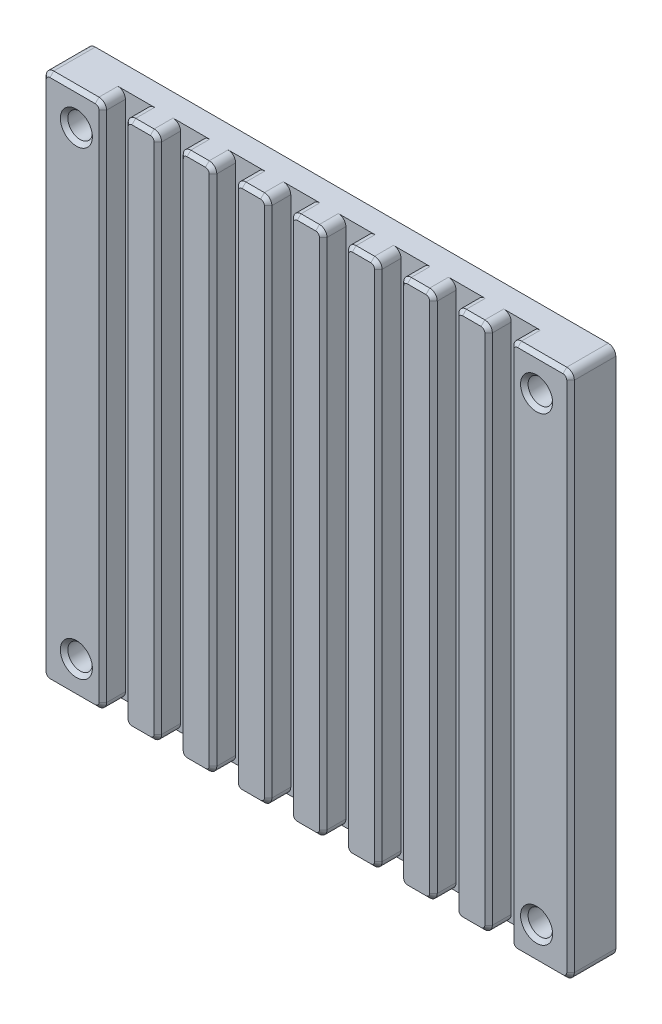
ISO-10303-21;
HEADER;
FILE_DESCRIPTION(('STEP AP214'),'2;1');
FILE_NAME('part.step','',(''),(''),'','','');
FILE_SCHEMA(('AUTOMOTIVE_DESIGN { 1 0 10303 214 1 1 1 1 }'));
ENDSEC;
DATA;
#1=APPLICATION_CONTEXT('core data for automotive mechanical design processes');
#2=APPLICATION_PROTOCOL_DEFINITION('international standard','automotive_design',2000,#1);
#3=PRODUCT_CONTEXT('',#1,'mechanical');
#4=PRODUCT('Part','Part','',(#3));
#5=PRODUCT_RELATED_PRODUCT_CATEGORY('part','',(#4));
#6=PRODUCT_DEFINITION_FORMATION('','',#4);
#7=PRODUCT_DEFINITION_CONTEXT('part definition',#1,'design');
#8=PRODUCT_DEFINITION('design','',#6,#7);
#9=PRODUCT_DEFINITION_SHAPE('','',#8);
#10=(LENGTH_UNIT() NAMED_UNIT(*) SI_UNIT(.MILLI.,.METRE.));
#11=(NAMED_UNIT(*) PLANE_ANGLE_UNIT() SI_UNIT($,.RADIAN.));
#12=(NAMED_UNIT(*) SI_UNIT($,.STERADIAN.) SOLID_ANGLE_UNIT());
#13=UNCERTAINTY_MEASURE_WITH_UNIT(LENGTH_MEASURE(1.E-05),#10,'distance_accuracy_value','');
#14=(GEOMETRIC_REPRESENTATION_CONTEXT(3) GLOBAL_UNCERTAINTY_ASSIGNED_CONTEXT((#13)) GLOBAL_UNIT_ASSIGNED_CONTEXT((#10,
#11,#12)) REPRESENTATION_CONTEXT('',''));
#15=CARTESIAN_POINT('',(0.,0.,0.));
#16=DIRECTION('',(0.,0.,1.));
#17=DIRECTION('',(1.,0.,0.));
#18=AXIS2_PLACEMENT_3D('',#15,#16,#17);
#19=CARTESIAN_POINT('',(0.,0.,6.));
#20=DIRECTION('',(0.,0.,-1.));
#21=DIRECTION('',(-1.,0.,0.));
#22=AXIS2_PLACEMENT_3D('',#19,#20,#21);
#23=PLANE('',#22);
#24=DIRECTION('',(-1.,0.,0.));
#25=VECTOR('',#24,1.);
#26=CARTESIAN_POINT('',(0.,69.5,6.));
#27=LINE('',#26,#25);
#28=CARTESIAN_POINT('',(7.,69.5,6.));
#29=VERTEX_POINT('',#28);
#30=CARTESIAN_POINT('',(1.,69.5,6.));
#31=VERTEX_POINT('',#30);
#32=EDGE_CURVE('E1307',#29,#31,#27,.T.);
#33=ORIENTED_EDGE('',*,*,#32,.T.);
#34=CARTESIAN_POINT('',(1.,69.,6.));
#35=DIRECTION('',(0.,0.,-1.));
#36=DIRECTION('',(-1.,0.,0.));
#37=AXIS2_PLACEMENT_3D('',#34,#35,#36);
#38=CIRCLE('',#37,0.5);
#39=CARTESIAN_POINT('',(0.5,69.,6.));
#40=VERTEX_POINT('',#39);
#41=EDGE_CURVE('E1309',#31,#40,#38,.F.);
#42=ORIENTED_EDGE('',*,*,#41,.T.);
#43=DIRECTION('',(0.,-1.,0.));
#44=VECTOR('',#43,1.);
#45=CARTESIAN_POINT('',(0.5,0.,6.));
#46=LINE('',#45,#44);
#47=CARTESIAN_POINT('',(0.5,1.,6.));
#48=VERTEX_POINT('',#47);
#49=EDGE_CURVE('E1295',#40,#48,#46,.T.);
#50=ORIENTED_EDGE('',*,*,#49,.T.);
#51=CARTESIAN_POINT('',(1.,1.,6.));
#52=DIRECTION('',(0.,0.,-1.));
#53=DIRECTION('',(-1.,0.,0.));
#54=AXIS2_PLACEMENT_3D('',#51,#52,#53);
#55=CIRCLE('',#54,0.5);
#56=CARTESIAN_POINT('',(1.,0.5,6.));
#57=VERTEX_POINT('',#56);
#58=EDGE_CURVE('E1297',#48,#57,#55,.F.);
#59=ORIENTED_EDGE('',*,*,#58,.T.);
#60=DIRECTION('',(1.,0.,0.));
#61=VECTOR('',#60,1.);
#62=CARTESIAN_POINT('',(0.,0.5,6.));
#63=LINE('',#62,#61);
#64=CARTESIAN_POINT('',(7.00000000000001,0.5,6.));
#65=VERTEX_POINT('',#64);
#66=EDGE_CURVE('E1299',#57,#65,#63,.T.);
#67=ORIENTED_EDGE('',*,*,#66,.T.);
#68=CARTESIAN_POINT('',(7.00000000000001,1.,6.));
#69=DIRECTION('',(0.,0.,-1.));
#70=DIRECTION('',(-1.,0.,0.));
#71=AXIS2_PLACEMENT_3D('',#68,#69,#70);
#72=CIRCLE('',#71,0.5);
#73=CARTESIAN_POINT('',(7.50000000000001,1.,6.));
#74=VERTEX_POINT('',#73);
#75=EDGE_CURVE('E1301',#65,#74,#72,.F.);
#76=ORIENTED_EDGE('',*,*,#75,.T.);
#77=DIRECTION('',(0.,1.,0.));
#78=VECTOR('',#77,1.);
#79=CARTESIAN_POINT('',(7.50000000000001,0.,6.));
#80=LINE('',#79,#78);
#81=CARTESIAN_POINT('',(7.5,69.,6.));
#82=VERTEX_POINT('',#81);
#83=EDGE_CURVE('E1303',#74,#82,#80,.T.);
#84=ORIENTED_EDGE('',*,*,#83,.T.);
#85=CARTESIAN_POINT('',(7.,69.,6.));
#86=DIRECTION('',(0.,0.,-1.));
#87=DIRECTION('',(-1.,0.,0.));
#88=AXIS2_PLACEMENT_3D('',#85,#86,#87);
#89=CIRCLE('',#88,0.5);
#90=EDGE_CURVE('E1305',#82,#29,#89,.F.);
#91=ORIENTED_EDGE('',*,*,#90,.T.);
#92=EDGE_LOOP('',(#33,#42,#50,#59,#67,#76,#84,#91));
#93=FACE_BOUND('',#92,.T.);
#94=CARTESIAN_POINT('',(4.5,65.5,6.));
#95=DIRECTION('',(0.,0.,-1.));
#96=DIRECTION('',(-1.,0.,0.));
#97=AXIS2_PLACEMENT_3D('',#94,#95,#96);
#98=CIRCLE('',#97,2.12499999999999);
#99=CARTESIAN_POINT('',(2.37500000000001,65.5,6.));
#100=VERTEX_POINT('',#99);
#101=EDGE_CURVE('E1292',#100,#100,#98,.T.);
#102=ORIENTED_EDGE('',*,*,#101,.T.);
#103=EDGE_LOOP('',(#102));
#104=FACE_BOUND('',#103,.T.);
#105=CARTESIAN_POINT('',(4.49999999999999,4.50000000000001,6.));
#106=DIRECTION('',(0.,0.,-1.));
#107=DIRECTION('',(-1.,0.,0.));
#108=AXIS2_PLACEMENT_3D('',#105,#106,#107);
#109=CIRCLE('',#108,2.12499999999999);
#110=CARTESIAN_POINT('',(2.375,4.50000000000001,6.));
#111=VERTEX_POINT('',#110);
#112=EDGE_CURVE('E1289',#111,#111,#109,.T.);
#113=ORIENTED_EDGE('',*,*,#112,.T.);
#114=EDGE_LOOP('',(#113));
#115=FACE_BOUND('',#114,.T.);
#116=ADVANCED_FACE('F41',(#93,#104,#115),#23,.F.);
#117=DIRECTION('',(0.,1.,0.));
#118=VECTOR('',#117,1.);
#119=CARTESIAN_POINT('',(22.1114865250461,0.,6.));
#120=LINE('',#119,#118);
#121=CARTESIAN_POINT('',(22.1114865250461,1.,6.));
#122=VERTEX_POINT('',#121);
#123=CARTESIAN_POINT('',(22.1114865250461,69.,6.));
#124=VERTEX_POINT('',#123);
#125=EDGE_CURVE('E1241',#122,#124,#120,.T.);
#126=ORIENTED_EDGE('',*,*,#125,.T.);
#127=CARTESIAN_POINT('',(21.6114865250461,69.,6.));
#128=DIRECTION('',(0.,0.,-1.));
#129=DIRECTION('',(-1.,0.,0.));
#130=AXIS2_PLACEMENT_3D('',#127,#128,#129);
#131=CIRCLE('',#130,0.5);
#132=CARTESIAN_POINT('',(21.6114865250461,69.5,6.));
#133=VERTEX_POINT('',#132);
#134=EDGE_CURVE('E1243',#124,#133,#131,.F.);
#135=ORIENTED_EDGE('',*,*,#134,.T.);
#136=DIRECTION('',(-1.,0.,0.));
#137=VECTOR('',#136,1.);
#138=CARTESIAN_POINT('',(0.,69.5,6.));
#139=LINE('',#138,#137);
#140=CARTESIAN_POINT('',(19.1655404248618,69.5,6.));
#141=VERTEX_POINT('',#140);
#142=EDGE_CURVE('E1229',#133,#141,#139,.T.);
#143=ORIENTED_EDGE('',*,*,#142,.T.);
#144=CARTESIAN_POINT('',(19.1655404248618,69.,6.));
#145=DIRECTION('',(0.,0.,-1.));
#146=DIRECTION('',(-1.,0.,0.));
#147=AXIS2_PLACEMENT_3D('',#144,#145,#146);
#148=CIRCLE('',#147,0.5);
#149=CARTESIAN_POINT('',(18.6655404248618,69.,6.));
#150=VERTEX_POINT('',#149);
#151=EDGE_CURVE('E1231',#141,#150,#148,.F.);
#152=ORIENTED_EDGE('',*,*,#151,.T.);
#153=DIRECTION('',(0.,-1.,0.));
#154=VECTOR('',#153,1.);
#155=CARTESIAN_POINT('',(18.6655404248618,0.,6.));
#156=LINE('',#155,#154);
#157=CARTESIAN_POINT('',(18.6655404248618,1.,6.));
#158=VERTEX_POINT('',#157);
#159=EDGE_CURVE('E1233',#150,#158,#156,.T.);
#160=ORIENTED_EDGE('',*,*,#159,.T.);
#161=CARTESIAN_POINT('',(19.1655404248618,1.,6.));
#162=DIRECTION('',(0.,0.,-1.));
#163=DIRECTION('',(-1.,0.,0.));
#164=AXIS2_PLACEMENT_3D('',#161,#162,#163);
#165=CIRCLE('',#164,0.5);
#166=CARTESIAN_POINT('',(19.1655404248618,0.500000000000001,6.));
#167=VERTEX_POINT('',#166);
#168=EDGE_CURVE('E1235',#158,#167,#165,.F.);
#169=ORIENTED_EDGE('',*,*,#168,.T.);
#170=DIRECTION('',(1.,0.,0.));
#171=VECTOR('',#170,1.);
#172=CARTESIAN_POINT('',(0.,0.5,6.));
#173=LINE('',#172,#171);
#174=CARTESIAN_POINT('',(21.6114865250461,0.5,6.));
#175=VERTEX_POINT('',#174);
#176=EDGE_CURVE('E1237',#167,#175,#173,.T.);
#177=ORIENTED_EDGE('',*,*,#176,.T.);
#178=CARTESIAN_POINT('',(21.6114865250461,1.,6.));
#179=DIRECTION('',(0.,0.,-1.));
#180=DIRECTION('',(-1.,0.,0.));
#181=AXIS2_PLACEMENT_3D('',#178,#179,#180);
#182=CIRCLE('',#181,0.5);
#183=EDGE_CURVE('E1239',#175,#122,#182,.F.);
#184=ORIENTED_EDGE('',*,*,#183,.T.);
#185=EDGE_LOOP('',(#126,#135,#143,#152,#160,#169,#177,#184));
#186=FACE_BOUND('',#185,.T.);
#187=ADVANCED_FACE('F1787',(#186),#23,.F.);
#188=DIRECTION('',(1.,0.,0.));
#189=VECTOR('',#188,1.);
#190=CARTESIAN_POINT('',(0.,0.5,6.));
#191=LINE('',#190,#189);
#192=CARTESIAN_POINT('',(26.4712836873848,0.500000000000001,6.));
#193=VERTEX_POINT('',#192);
#194=CARTESIAN_POINT('',(28.9172297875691,0.5,6.));
#195=VERTEX_POINT('',#194);
#196=EDGE_CURVE('E1211',#193,#195,#191,.T.);
#197=ORIENTED_EDGE('',*,*,#196,.T.);
#198=CARTESIAN_POINT('',(28.9172297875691,1.,6.));
#199=DIRECTION('',(0.,0.,-1.));
#200=DIRECTION('',(-1.,0.,0.));
#201=AXIS2_PLACEMENT_3D('',#198,#199,#200);
#202=CIRCLE('',#201,0.5);
#203=CARTESIAN_POINT('',(29.4172297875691,1.,6.));
#204=VERTEX_POINT('',#203);
#205=EDGE_CURVE('E1213',#195,#204,#202,.F.);
#206=ORIENTED_EDGE('',*,*,#205,.T.);
#207=DIRECTION('',(0.,1.,0.));
#208=VECTOR('',#207,1.);
#209=CARTESIAN_POINT('',(29.4172297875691,0.,6.));
#210=LINE('',#209,#208);
#211=CARTESIAN_POINT('',(29.4172297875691,69.,6.));
#212=VERTEX_POINT('',#211);
#213=EDGE_CURVE('E1199',#204,#212,#210,.T.);
#214=ORIENTED_EDGE('',*,*,#213,.T.);
#215=CARTESIAN_POINT('',(28.9172297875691,69.,6.));
#216=DIRECTION('',(0.,0.,-1.));
#217=DIRECTION('',(-1.,0.,0.));
#218=AXIS2_PLACEMENT_3D('',#215,#216,#217);
#219=CIRCLE('',#218,0.5);
#220=CARTESIAN_POINT('',(28.9172297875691,69.5,6.));
#221=VERTEX_POINT('',#220);
#222=EDGE_CURVE('E1201',#212,#221,#219,.F.);
#223=ORIENTED_EDGE('',*,*,#222,.T.);
#224=DIRECTION('',(-1.,0.,0.));
#225=VECTOR('',#224,1.);
#226=CARTESIAN_POINT('',(0.,69.5,6.));
#227=LINE('',#226,#225);
#228=CARTESIAN_POINT('',(26.4712836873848,69.5,6.));
#229=VERTEX_POINT('',#228);
#230=EDGE_CURVE('E1203',#221,#229,#227,.T.);
#231=ORIENTED_EDGE('',*,*,#230,.T.);
#232=CARTESIAN_POINT('',(26.4712836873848,69.,6.));
#233=DIRECTION('',(0.,0.,-1.));
#234=DIRECTION('',(-1.,0.,0.));
#235=AXIS2_PLACEMENT_3D('',#232,#233,#234);
#236=CIRCLE('',#235,0.5);
#237=CARTESIAN_POINT('',(25.9712836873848,69.,6.));
#238=VERTEX_POINT('',#237);
#239=EDGE_CURVE('E1205',#229,#238,#236,.F.);
#240=ORIENTED_EDGE('',*,*,#239,.T.);
#241=DIRECTION('',(0.,-1.,0.));
#242=VECTOR('',#241,1.);
#243=CARTESIAN_POINT('',(25.9712836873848,0.,6.));
#244=LINE('',#243,#242);
#245=CARTESIAN_POINT('',(25.9712836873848,1.,6.));
#246=VERTEX_POINT('',#245);
#247=EDGE_CURVE('E1207',#238,#246,#244,.T.);
#248=ORIENTED_EDGE('',*,*,#247,.T.);
#249=CARTESIAN_POINT('',(26.4712836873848,1.,6.));
#250=DIRECTION('',(0.,0.,-1.));
#251=DIRECTION('',(-1.,0.,0.));
#252=AXIS2_PLACEMENT_3D('',#249,#250,#251);
#253=CIRCLE('',#252,0.5);
#254=EDGE_CURVE('E1209',#246,#193,#253,.F.);
#255=ORIENTED_EDGE('',*,*,#254,.T.);
#256=EDGE_LOOP('',(#197,#206,#214,#223,#231,#240,#248,#255));
#257=FACE_BOUND('',#256,.T.);
#258=ADVANCED_FACE('F1795',(#257),#23,.F.);
#259=DIRECTION('',(1.,0.,0.));
#260=VECTOR('',#259,1.);
#261=CARTESIAN_POINT('',(0.,0.5,6.));
#262=LINE('',#261,#260);
#263=CARTESIAN_POINT('',(33.7770269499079,0.500000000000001,6.));
#264=VERTEX_POINT('',#263);
#265=CARTESIAN_POINT('',(36.2229730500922,0.5,6.));
#266=VERTEX_POINT('',#265);
#267=EDGE_CURVE('E1181',#264,#266,#262,.T.);
#268=ORIENTED_EDGE('',*,*,#267,.T.);
#269=CARTESIAN_POINT('',(36.2229730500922,1.,6.));
#270=DIRECTION('',(0.,0.,-1.));
#271=DIRECTION('',(-1.,0.,0.));
#272=AXIS2_PLACEMENT_3D('',#269,#270,#271);
#273=CIRCLE('',#272,0.5);
#274=CARTESIAN_POINT('',(36.7229730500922,1.,6.));
#275=VERTEX_POINT('',#274);
#276=EDGE_CURVE('E1183',#266,#275,#273,.F.);
#277=ORIENTED_EDGE('',*,*,#276,.T.);
#278=DIRECTION('',(0.,1.,0.));
#279=VECTOR('',#278,1.);
#280=CARTESIAN_POINT('',(36.7229730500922,0.,6.));
#281=LINE('',#280,#279);
#282=CARTESIAN_POINT('',(36.7229730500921,69.,6.));
#283=VERTEX_POINT('',#282);
#284=EDGE_CURVE('E1169',#275,#283,#281,.T.);
#285=ORIENTED_EDGE('',*,*,#284,.T.);
#286=CARTESIAN_POINT('',(36.2229730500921,69.,6.));
#287=DIRECTION('',(0.,0.,-1.));
#288=DIRECTION('',(-1.,0.,0.));
#289=AXIS2_PLACEMENT_3D('',#286,#287,#288);
#290=CIRCLE('',#289,0.5);
#291=CARTESIAN_POINT('',(36.2229730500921,69.5,6.));
#292=VERTEX_POINT('',#291);
#293=EDGE_CURVE('E1171',#283,#292,#290,.F.);
#294=ORIENTED_EDGE('',*,*,#293,.T.);
#295=DIRECTION('',(-1.,0.,0.));
#296=VECTOR('',#295,1.);
#297=CARTESIAN_POINT('',(0.,69.5,6.));
#298=LINE('',#297,#296);
#299=CARTESIAN_POINT('',(33.7770269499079,69.5,6.));
#300=VERTEX_POINT('',#299);
#301=EDGE_CURVE('E1173',#292,#300,#298,.T.);
#302=ORIENTED_EDGE('',*,*,#301,.T.);
#303=CARTESIAN_POINT('',(33.7770269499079,69.,6.));
#304=DIRECTION('',(0.,0.,-1.));
#305=DIRECTION('',(-1.,0.,0.));
#306=AXIS2_PLACEMENT_3D('',#303,#304,#305);
#307=CIRCLE('',#306,0.5);
#308=CARTESIAN_POINT('',(33.2770269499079,69.,6.));
#309=VERTEX_POINT('',#308);
#310=EDGE_CURVE('E1175',#300,#309,#307,.F.);
#311=ORIENTED_EDGE('',*,*,#310,.T.);
#312=DIRECTION('',(0.,-1.,0.));
#313=VECTOR('',#312,1.);
#314=CARTESIAN_POINT('',(33.2770269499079,0.,6.));
#315=LINE('',#314,#313);
#316=CARTESIAN_POINT('',(33.2770269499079,1.,6.));
#317=VERTEX_POINT('',#316);
#318=EDGE_CURVE('E1177',#309,#317,#315,.T.);
#319=ORIENTED_EDGE('',*,*,#318,.T.);
#320=CARTESIAN_POINT('',(33.7770269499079,1.,6.));
#321=DIRECTION('',(0.,0.,-1.));
#322=DIRECTION('',(-1.,0.,0.));
#323=AXIS2_PLACEMENT_3D('',#320,#321,#322);
#324=CIRCLE('',#323,0.5);
#325=EDGE_CURVE('E1179',#317,#264,#324,.F.);
#326=ORIENTED_EDGE('',*,*,#325,.T.);
#327=EDGE_LOOP('',(#268,#277,#285,#294,#302,#311,#319,#326));
#328=FACE_BOUND('',#327,.T.);
#329=ADVANCED_FACE('F3373',(#328),#23,.F.);
#330=DIRECTION('',(0.,1.,0.));
#331=VECTOR('',#330,1.);
#332=CARTESIAN_POINT('',(44.0287163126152,0.,6.));
#333=LINE('',#332,#331);
#334=CARTESIAN_POINT('',(44.0287163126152,1.,6.));
#335=VERTEX_POINT('',#334);
#336=CARTESIAN_POINT('',(44.0287163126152,69.,6.));
#337=VERTEX_POINT('',#336);
#338=EDGE_CURVE('E1151',#335,#337,#333,.T.);
#339=ORIENTED_EDGE('',*,*,#338,.T.);
#340=CARTESIAN_POINT('',(43.5287163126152,69.,6.));
#341=DIRECTION('',(0.,0.,-1.));
#342=DIRECTION('',(-1.,0.,0.));
#343=AXIS2_PLACEMENT_3D('',#340,#341,#342);
#344=CIRCLE('',#343,0.5);
#345=CARTESIAN_POINT('',(43.5287163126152,69.5,6.));
#346=VERTEX_POINT('',#345);
#347=EDGE_CURVE('E1153',#337,#346,#344,.F.);
#348=ORIENTED_EDGE('',*,*,#347,.T.);
#349=DIRECTION('',(-1.,0.,0.));
#350=VECTOR('',#349,1.);
#351=CARTESIAN_POINT('',(0.,69.5,6.));
#352=LINE('',#351,#350);
#353=CARTESIAN_POINT('',(41.0827702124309,69.5,6.));
#354=VERTEX_POINT('',#353);
#355=EDGE_CURVE('E1139',#346,#354,#352,.T.);
#356=ORIENTED_EDGE('',*,*,#355,.T.);
#357=CARTESIAN_POINT('',(41.0827702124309,69.,6.));
#358=DIRECTION('',(0.,0.,-1.));
#359=DIRECTION('',(-1.,0.,0.));
#360=AXIS2_PLACEMENT_3D('',#357,#358,#359);
#361=CIRCLE('',#360,0.5);
#362=CARTESIAN_POINT('',(40.5827702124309,69.,6.));
#363=VERTEX_POINT('',#362);
#364=EDGE_CURVE('E1141',#354,#363,#361,.F.);
#365=ORIENTED_EDGE('',*,*,#364,.T.);
#366=DIRECTION('',(0.,-1.,0.));
#367=VECTOR('',#366,1.);
#368=CARTESIAN_POINT('',(40.5827702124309,0.,6.));
#369=LINE('',#368,#367);
#370=CARTESIAN_POINT('',(40.5827702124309,1.,6.));
#371=VERTEX_POINT('',#370);
#372=EDGE_CURVE('E1143',#363,#371,#369,.T.);
#373=ORIENTED_EDGE('',*,*,#372,.T.);
#374=CARTESIAN_POINT('',(41.0827702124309,1.,6.));
#375=DIRECTION('',(0.,0.,-1.));
#376=DIRECTION('',(-1.,0.,0.));
#377=AXIS2_PLACEMENT_3D('',#374,#375,#376);
#378=CIRCLE('',#377,0.5);
#379=CARTESIAN_POINT('',(41.0827702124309,0.500000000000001,6.));
#380=VERTEX_POINT('',#379);
#381=EDGE_CURVE('E1145',#371,#380,#378,.F.);
#382=ORIENTED_EDGE('',*,*,#381,.T.);
#383=DIRECTION('',(1.,0.,0.));
#384=VECTOR('',#383,1.);
#385=CARTESIAN_POINT('',(0.,0.5,6.));
#386=LINE('',#385,#384);
#387=CARTESIAN_POINT('',(43.5287163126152,0.5,6.));
#388=VERTEX_POINT('',#387);
#389=EDGE_CURVE('E1147',#380,#388,#386,.T.);
#390=ORIENTED_EDGE('',*,*,#389,.T.);
#391=CARTESIAN_POINT('',(43.5287163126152,1.,6.));
#392=DIRECTION('',(0.,0.,-1.));
#393=DIRECTION('',(-1.,0.,0.));
#394=AXIS2_PLACEMENT_3D('',#391,#392,#393);
#395=CIRCLE('',#394,0.5);
#396=EDGE_CURVE('E1149',#388,#335,#395,.F.);
#397=ORIENTED_EDGE('',*,*,#396,.T.);
#398=EDGE_LOOP('',(#339,#348,#356,#365,#373,#382,#390,#397));
#399=FACE_BOUND('',#398,.T.);
#400=ADVANCED_FACE('F3381',(#399),#23,.F.);
#401=DIRECTION('',(0.,1.,0.));
#402=VECTOR('',#401,1.);
#403=CARTESIAN_POINT('',(51.3344595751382,0.,6.));
#404=LINE('',#403,#402);
#405=CARTESIAN_POINT('',(51.3344595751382,1.,6.));
#406=VERTEX_POINT('',#405);
#407=CARTESIAN_POINT('',(51.3344595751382,69.,6.));
#408=VERTEX_POINT('',#407);
#409=EDGE_CURVE('E1121',#406,#408,#404,.T.);
#410=ORIENTED_EDGE('',*,*,#409,.T.);
#411=CARTESIAN_POINT('',(50.8344595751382,69.,6.));
#412=DIRECTION('',(0.,0.,-1.));
#413=DIRECTION('',(-1.,0.,0.));
#414=AXIS2_PLACEMENT_3D('',#411,#412,#413);
#415=CIRCLE('',#414,0.5);
#416=CARTESIAN_POINT('',(50.8344595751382,69.5,6.));
#417=VERTEX_POINT('',#416);
#418=EDGE_CURVE('E1123',#408,#417,#415,.F.);
#419=ORIENTED_EDGE('',*,*,#418,.T.);
#420=DIRECTION('',(-1.,0.,0.));
#421=VECTOR('',#420,1.);
#422=CARTESIAN_POINT('',(0.,69.5,6.));
#423=LINE('',#422,#421);
#424=CARTESIAN_POINT('',(48.3885134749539,69.5,6.));
#425=VERTEX_POINT('',#424);
#426=EDGE_CURVE('E1109',#417,#425,#423,.T.);
#427=ORIENTED_EDGE('',*,*,#426,.T.);
#428=CARTESIAN_POINT('',(48.3885134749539,69.,6.));
#429=DIRECTION('',(0.,0.,-1.));
#430=DIRECTION('',(-1.,0.,0.));
#431=AXIS2_PLACEMENT_3D('',#428,#429,#430);
#432=CIRCLE('',#431,0.5);
#433=CARTESIAN_POINT('',(47.8885134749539,69.,6.));
#434=VERTEX_POINT('',#433);
#435=EDGE_CURVE('E1111',#425,#434,#432,.F.);
#436=ORIENTED_EDGE('',*,*,#435,.T.);
#437=DIRECTION('',(0.,-1.,0.));
#438=VECTOR('',#437,1.);
#439=CARTESIAN_POINT('',(47.8885134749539,0.,6.));
#440=LINE('',#439,#438);
#441=CARTESIAN_POINT('',(47.8885134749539,1.,6.));
#442=VERTEX_POINT('',#441);
#443=EDGE_CURVE('E1113',#434,#442,#440,.T.);
#444=ORIENTED_EDGE('',*,*,#443,.T.);
#445=CARTESIAN_POINT('',(48.3885134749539,1.,6.));
#446=DIRECTION('',(0.,0.,-1.));
#447=DIRECTION('',(-1.,0.,0.));
#448=AXIS2_PLACEMENT_3D('',#445,#446,#447);
#449=CIRCLE('',#448,0.5);
#450=CARTESIAN_POINT('',(48.3885134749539,0.500000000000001,6.));
#451=VERTEX_POINT('',#450);
#452=EDGE_CURVE('E1115',#442,#451,#449,.F.);
#453=ORIENTED_EDGE('',*,*,#452,.T.);
#454=DIRECTION('',(1.,0.,0.));
#455=VECTOR('',#454,1.);
#456=CARTESIAN_POINT('',(0.,0.5,6.));
#457=LINE('',#456,#455);
#458=CARTESIAN_POINT('',(50.8344595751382,0.5,6.));
#459=VERTEX_POINT('',#458);
#460=EDGE_CURVE('E1117',#451,#459,#457,.T.);
#461=ORIENTED_EDGE('',*,*,#460,.T.);
#462=CARTESIAN_POINT('',(50.8344595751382,1.,6.));
#463=DIRECTION('',(0.,0.,-1.));
#464=DIRECTION('',(-1.,0.,0.));
#465=AXIS2_PLACEMENT_3D('',#462,#463,#464);
#466=CIRCLE('',#465,0.5);
#467=EDGE_CURVE('E1119',#459,#406,#466,.F.);
#468=ORIENTED_EDGE('',*,*,#467,.T.);
#469=EDGE_LOOP('',(#410,#419,#427,#436,#444,#453,#461,#468));
#470=FACE_BOUND('',#469,.T.);
#471=ADVANCED_FACE('F3389',(#470),#23,.F.);
#472=DIRECTION('',(0.,1.,0.));
#473=VECTOR('',#472,1.);
#474=CARTESIAN_POINT('',(58.6402028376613,0.,6.));
#475=LINE('',#474,#473);
#476=CARTESIAN_POINT('',(58.6402028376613,1.,6.));
#477=VERTEX_POINT('',#476);
#478=CARTESIAN_POINT('',(58.6402028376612,69.,6.));
#479=VERTEX_POINT('',#478);
#480=EDGE_CURVE('E1091',#477,#479,#475,.T.);
#481=ORIENTED_EDGE('',*,*,#480,.T.);
#482=CARTESIAN_POINT('',(58.1402028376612,69.,6.));
#483=DIRECTION('',(0.,0.,-1.));
#484=DIRECTION('',(-1.,0.,0.));
#485=AXIS2_PLACEMENT_3D('',#482,#483,#484);
#486=CIRCLE('',#485,0.5);
#487=CARTESIAN_POINT('',(58.1402028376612,69.5,6.));
#488=VERTEX_POINT('',#487);
#489=EDGE_CURVE('E1093',#479,#488,#486,.F.);
#490=ORIENTED_EDGE('',*,*,#489,.T.);
#491=DIRECTION('',(-1.,0.,0.));
#492=VECTOR('',#491,1.);
#493=CARTESIAN_POINT('',(0.,69.5,6.));
#494=LINE('',#493,#492);
#495=CARTESIAN_POINT('',(55.694256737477,69.5,6.));
#496=VERTEX_POINT('',#495);
#497=EDGE_CURVE('E1079',#488,#496,#494,.T.);
#498=ORIENTED_EDGE('',*,*,#497,.T.);
#499=CARTESIAN_POINT('',(55.694256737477,69.,6.));
#500=DIRECTION('',(0.,0.,-1.));
#501=DIRECTION('',(-1.,0.,0.));
#502=AXIS2_PLACEMENT_3D('',#499,#500,#501);
#503=CIRCLE('',#502,0.5);
#504=CARTESIAN_POINT('',(55.194256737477,69.,6.));
#505=VERTEX_POINT('',#504);
#506=EDGE_CURVE('E1081',#496,#505,#503,.F.);
#507=ORIENTED_EDGE('',*,*,#506,.T.);
#508=DIRECTION('',(0.,-1.,0.));
#509=VECTOR('',#508,1.);
#510=CARTESIAN_POINT('',(55.194256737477,0.,6.));
#511=LINE('',#510,#509);
#512=CARTESIAN_POINT('',(55.194256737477,1.,6.));
#513=VERTEX_POINT('',#512);
#514=EDGE_CURVE('E1083',#505,#513,#511,.T.);
#515=ORIENTED_EDGE('',*,*,#514,.T.);
#516=CARTESIAN_POINT('',(55.694256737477,1.,6.));
#517=DIRECTION('',(0.,0.,-1.));
#518=DIRECTION('',(-1.,0.,0.));
#519=AXIS2_PLACEMENT_3D('',#516,#517,#518);
#520=CIRCLE('',#519,0.5);
#521=CARTESIAN_POINT('',(55.694256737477,0.500000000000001,6.));
#522=VERTEX_POINT('',#521);
#523=EDGE_CURVE('E1085',#513,#522,#520,.F.);
#524=ORIENTED_EDGE('',*,*,#523,.T.);
#525=DIRECTION('',(1.,0.,0.));
#526=VECTOR('',#525,1.);
#527=CARTESIAN_POINT('',(0.,0.5,6.));
#528=LINE('',#527,#526);
#529=CARTESIAN_POINT('',(58.1402028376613,0.5,6.));
#530=VERTEX_POINT('',#529);
#531=EDGE_CURVE('E1087',#522,#530,#528,.T.);
#532=ORIENTED_EDGE('',*,*,#531,.T.);
#533=CARTESIAN_POINT('',(58.1402028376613,1.,6.));
#534=DIRECTION('',(0.,0.,-1.));
#535=DIRECTION('',(-1.,0.,0.));
#536=AXIS2_PLACEMENT_3D('',#533,#534,#535);
#537=CIRCLE('',#536,0.5);
#538=EDGE_CURVE('E1089',#530,#477,#537,.F.);
#539=ORIENTED_EDGE('',*,*,#538,.T.);
#540=EDGE_LOOP('',(#481,#490,#498,#507,#515,#524,#532,#539));
#541=FACE_BOUND('',#540,.T.);
#542=ADVANCED_FACE('F1728',(#541),#23,.F.);
#543=DIRECTION('',(0.,1.,0.));
#544=VECTOR('',#543,1.);
#545=CARTESIAN_POINT('',(69.5,0.,6.));
#546=LINE('',#545,#544);
#547=CARTESIAN_POINT('',(69.5,1.,6.));
#548=VERTEX_POINT('',#547);
#549=CARTESIAN_POINT('',(69.5,69.,6.));
#550=VERTEX_POINT('',#549);
#551=EDGE_CURVE('E1021',#548,#550,#546,.T.);
#552=ORIENTED_EDGE('',*,*,#551,.T.);
#553=CARTESIAN_POINT('',(69.,69.,6.));
#554=DIRECTION('',(0.,0.,-1.));
#555=DIRECTION('',(-1.,0.,0.));
#556=AXIS2_PLACEMENT_3D('',#553,#554,#555);
#557=CIRCLE('',#556,0.5);
#558=CARTESIAN_POINT('',(69.,69.5,6.));
#559=VERTEX_POINT('',#558);
#560=EDGE_CURVE('E1023',#550,#559,#557,.F.);
#561=ORIENTED_EDGE('',*,*,#560,.T.);
#562=DIRECTION('',(-1.,0.,0.));
#563=VECTOR('',#562,1.);
#564=CARTESIAN_POINT('',(0.,69.5,6.));
#565=LINE('',#564,#563);
#566=CARTESIAN_POINT('',(63.,69.5,6.));
#567=VERTEX_POINT('',#566);
#568=EDGE_CURVE('E1009',#559,#567,#565,.T.);
#569=ORIENTED_EDGE('',*,*,#568,.T.);
#570=CARTESIAN_POINT('',(63.,69.,6.));
#571=DIRECTION('',(0.,0.,-1.));
#572=DIRECTION('',(-1.,0.,0.));
#573=AXIS2_PLACEMENT_3D('',#570,#571,#572);
#574=CIRCLE('',#573,0.5);
#575=CARTESIAN_POINT('',(62.5,69.,6.));
#576=VERTEX_POINT('',#575);
#577=EDGE_CURVE('E1011',#567,#576,#574,.F.);
#578=ORIENTED_EDGE('',*,*,#577,.T.);
#579=DIRECTION('',(0.,-1.,0.));
#580=VECTOR('',#579,1.);
#581=CARTESIAN_POINT('',(62.5,0.,6.));
#582=LINE('',#581,#580);
#583=CARTESIAN_POINT('',(62.5,1.,6.));
#584=VERTEX_POINT('',#583);
#585=EDGE_CURVE('E1013',#576,#584,#582,.T.);
#586=ORIENTED_EDGE('',*,*,#585,.T.);
#587=CARTESIAN_POINT('',(63.,1.,6.));
#588=DIRECTION('',(0.,0.,-1.));
#589=DIRECTION('',(-1.,0.,0.));
#590=AXIS2_PLACEMENT_3D('',#587,#588,#589);
#591=CIRCLE('',#590,0.5);
#592=CARTESIAN_POINT('',(63.,0.500000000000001,6.));
#593=VERTEX_POINT('',#592);
#594=EDGE_CURVE('E1015',#584,#593,#591,.F.);
#595=ORIENTED_EDGE('',*,*,#594,.T.);
#596=DIRECTION('',(1.,0.,0.));
#597=VECTOR('',#596,1.);
#598=CARTESIAN_POINT('',(0.,0.5,6.));
#599=LINE('',#598,#597);
#600=CARTESIAN_POINT('',(69.,0.5,6.));
#601=VERTEX_POINT('',#600);
#602=EDGE_CURVE('E1017',#593,#601,#599,.T.);
#603=ORIENTED_EDGE('',*,*,#602,.T.);
#604=CARTESIAN_POINT('',(69.,1.,6.));
#605=DIRECTION('',(0.,0.,-1.));
#606=DIRECTION('',(-1.,0.,0.));
#607=AXIS2_PLACEMENT_3D('',#604,#605,#606);
#608=CIRCLE('',#607,0.5);
#609=EDGE_CURVE('E1019',#601,#548,#608,.F.);
#610=ORIENTED_EDGE('',*,*,#609,.T.);
#611=EDGE_LOOP('',(#552,#561,#569,#578,#586,#595,#603,#610));
#612=FACE_BOUND('',#611,.T.);
#613=CARTESIAN_POINT('',(65.5,65.5,6.));
#614=DIRECTION('',(0.,0.,-1.));
#615=DIRECTION('',(-1.,0.,0.));
#616=AXIS2_PLACEMENT_3D('',#613,#614,#615);
#617=CIRCLE('',#616,2.12499999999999);
#618=CARTESIAN_POINT('',(63.375,65.5,6.));
#619=VERTEX_POINT('',#618);
#620=EDGE_CURVE('E1006',#619,#619,#617,.T.);
#621=ORIENTED_EDGE('',*,*,#620,.T.);
#622=EDGE_LOOP('',(#621));
#623=FACE_BOUND('',#622,.T.);
#624=CARTESIAN_POINT('',(65.5,4.5,6.));
#625=DIRECTION('',(0.,0.,-1.));
#626=DIRECTION('',(-1.,0.,0.));
#627=AXIS2_PLACEMENT_3D('',#624,#625,#626);
#628=CIRCLE('',#627,2.12499999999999);
#629=CARTESIAN_POINT('',(63.375,4.5,6.));
#630=VERTEX_POINT('',#629);
#631=EDGE_CURVE('E1003',#630,#630,#628,.T.);
#632=ORIENTED_EDGE('',*,*,#631,.T.);
#633=EDGE_LOOP('',(#632));
#634=FACE_BOUND('',#633,.T.);
#635=ADVANCED_FACE('F1678',(#612,#623,#634),#23,.F.);
#636=DIRECTION('',(1.,0.,0.));
#637=VECTOR('',#636,1.);
#638=CARTESIAN_POINT('',(0.,0.499999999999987,6.));
#639=LINE('',#638,#637);
#640=CARTESIAN_POINT('',(11.8597971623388,0.499999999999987,6.));
#641=VERTEX_POINT('',#640);
#642=CARTESIAN_POINT('',(14.305743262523,0.499999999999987,6.));
#643=VERTEX_POINT('',#642);
#644=EDGE_CURVE('E1271',#641,#643,#639,.T.);
#645=ORIENTED_EDGE('',*,*,#644,.T.);
#646=CARTESIAN_POINT('',(14.305743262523,1.,6.));
#647=DIRECTION('',(0.,0.,-1.));
#648=DIRECTION('',(-1.,0.,0.));
#649=AXIS2_PLACEMENT_3D('',#646,#647,#648);
#650=CIRCLE('',#649,0.500000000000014);
#651=CARTESIAN_POINT('',(14.8057432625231,1.,6.));
#652=VERTEX_POINT('',#651);
#653=EDGE_CURVE('E1273',#643,#652,#650,.F.);
#654=ORIENTED_EDGE('',*,*,#653,.T.);
#655=DIRECTION('',(0.,1.,0.));
#656=VECTOR('',#655,1.);
#657=CARTESIAN_POINT('',(14.8057432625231,0.,6.));
#658=LINE('',#657,#656);
#659=CARTESIAN_POINT('',(14.805743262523,69.,6.));
#660=VERTEX_POINT('',#659);
#661=EDGE_CURVE('E1259',#652,#660,#658,.T.);
#662=ORIENTED_EDGE('',*,*,#661,.T.);
#663=CARTESIAN_POINT('',(14.305743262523,69.,6.));
#664=DIRECTION('',(0.,0.,-1.));
#665=DIRECTION('',(-1.,0.,0.));
#666=AXIS2_PLACEMENT_3D('',#663,#664,#665);
#667=CIRCLE('',#666,0.500000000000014);
#668=CARTESIAN_POINT('',(14.305743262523,69.5,6.));
#669=VERTEX_POINT('',#668);
#670=EDGE_CURVE('E1261',#660,#669,#667,.F.);
#671=ORIENTED_EDGE('',*,*,#670,.T.);
#672=DIRECTION('',(-1.,0.,0.));
#673=VECTOR('',#672,1.);
#674=CARTESIAN_POINT('',(0.,69.5,6.));
#675=LINE('',#674,#673);
#676=CARTESIAN_POINT('',(11.8597971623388,69.5,6.));
#677=VERTEX_POINT('',#676);
#678=EDGE_CURVE('E1263',#669,#677,#675,.T.);
#679=ORIENTED_EDGE('',*,*,#678,.T.);
#680=CARTESIAN_POINT('',(11.8597971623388,69.,6.));
#681=DIRECTION('',(0.,0.,-1.));
#682=DIRECTION('',(-1.,0.,0.));
#683=AXIS2_PLACEMENT_3D('',#680,#681,#682);
#684=CIRCLE('',#683,0.500000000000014);
#685=CARTESIAN_POINT('',(11.3597971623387,69.,6.));
#686=VERTEX_POINT('',#685);
#687=EDGE_CURVE('E1265',#677,#686,#684,.F.);
#688=ORIENTED_EDGE('',*,*,#687,.T.);
#689=DIRECTION('',(0.,-1.,0.));
#690=VECTOR('',#689,1.);
#691=CARTESIAN_POINT('',(11.3597971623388,0.,6.));
#692=LINE('',#691,#690);
#693=CARTESIAN_POINT('',(11.3597971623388,1.,6.));
#694=VERTEX_POINT('',#693);
#695=EDGE_CURVE('E1267',#686,#694,#692,.T.);
#696=ORIENTED_EDGE('',*,*,#695,.T.);
#697=CARTESIAN_POINT('',(11.8597971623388,1.,6.));
#698=DIRECTION('',(0.,0.,-1.));
#699=DIRECTION('',(-1.,0.,0.));
#700=AXIS2_PLACEMENT_3D('',#697,#698,#699);
#701=CIRCLE('',#700,0.500000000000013);
#702=EDGE_CURVE('E1269',#694,#641,#701,.F.);
#703=ORIENTED_EDGE('',*,*,#702,.T.);
#704=EDGE_LOOP('',(#645,#654,#662,#671,#679,#688,#696,#703));
#705=FACE_BOUND('',#704,.T.);
#706=ADVANCED_FACE('F1790',(#705),#23,.F.);
#707=CARTESIAN_POINT('',(0.,0.,0.));
#708=DIRECTION('',(0.,0.,-1.));
#709=DIRECTION('',(-1.,0.,0.));
#710=AXIS2_PLACEMENT_3D('',#707,#708,#709);
#711=PLANE('',#710);
#712=CARTESIAN_POINT('',(65.5,4.5,0.));
#713=DIRECTION('',(0.,0.,1.));
#714=DIRECTION('',(1.,0.,0.));
#715=AXIS2_PLACEMENT_3D('',#712,#713,#714);
#716=CIRCLE('',#715,1.625);
#717=CARTESIAN_POINT('',(67.125,4.5,0.));
#718=VERTEX_POINT('',#717);
#719=EDGE_CURVE('E1645',#718,#718,#716,.T.);
#720=ORIENTED_EDGE('',*,*,#719,.T.);
#721=EDGE_LOOP('',(#720));
#722=FACE_BOUND('',#721,.T.);
#723=CARTESIAN_POINT('',(65.5,65.5,0.));
#724=DIRECTION('',(0.,0.,1.));
#725=DIRECTION('',(1.,0.,0.));
#726=AXIS2_PLACEMENT_3D('',#723,#724,#725);
#727=CIRCLE('',#726,1.625);
#728=CARTESIAN_POINT('',(67.125,65.5,0.));
#729=VERTEX_POINT('',#728);
#730=EDGE_CURVE('E1651',#729,#729,#727,.T.);
#731=ORIENTED_EDGE('',*,*,#730,.T.);
#732=EDGE_LOOP('',(#731));
#733=FACE_BOUND('',#732,.T.);
#734=DIRECTION('',(-1.,0.,0.));
#735=VECTOR('',#734,1.);
#736=CARTESIAN_POINT('',(0.,70.,0.));
#737=LINE('',#736,#735);
#738=CARTESIAN_POINT('',(69.,70.,0.));
#739=VERTEX_POINT('',#738);
#740=CARTESIAN_POINT('',(1.,70.,0.));
#741=VERTEX_POINT('',#740);
#742=EDGE_CURVE('E718',#739,#741,#737,.T.);
#743=ORIENTED_EDGE('',*,*,#742,.F.);
#744=CARTESIAN_POINT('',(69.,69.,0.));
#745=DIRECTION('',(0.,0.,-1.));
#746=DIRECTION('',(-1.,0.,0.));
#747=AXIS2_PLACEMENT_3D('',#744,#745,#746);
#748=CIRCLE('',#747,1.);
#749=CARTESIAN_POINT('',(70.,69.,0.));
#750=VERTEX_POINT('',#749);
#751=EDGE_CURVE('E729',#739,#750,#748,.T.);
#752=ORIENTED_EDGE('',*,*,#751,.T.);
#753=DIRECTION('',(0.,1.,0.));
#754=VECTOR('',#753,1.);
#755=CARTESIAN_POINT('',(70.,0.,0.));
#756=LINE('',#755,#754);
#757=CARTESIAN_POINT('',(70.,1.,0.));
#758=VERTEX_POINT('',#757);
#759=EDGE_CURVE('E745',#758,#750,#756,.T.);
#760=ORIENTED_EDGE('',*,*,#759,.F.);
#761=CARTESIAN_POINT('',(69.,1.,0.));
#762=DIRECTION('',(0.,0.,-1.));
#763=DIRECTION('',(-1.,0.,0.));
#764=AXIS2_PLACEMENT_3D('',#761,#762,#763);
#765=CIRCLE('',#764,1.);
#766=CARTESIAN_POINT('',(69.,0.,0.));
#767=VERTEX_POINT('',#766);
#768=EDGE_CURVE('E737',#758,#767,#765,.T.);
#769=ORIENTED_EDGE('',*,*,#768,.T.);
#770=DIRECTION('',(1.,0.,0.));
#771=VECTOR('',#770,1.);
#772=CARTESIAN_POINT('',(0.,0.,0.));
#773=LINE('',#772,#771);
#774=CARTESIAN_POINT('',(1.,0.,0.));
#775=VERTEX_POINT('',#774);
#776=EDGE_CURVE('E750',#775,#767,#773,.T.);
#777=ORIENTED_EDGE('',*,*,#776,.F.);
#778=CARTESIAN_POINT('',(1.,1.,0.));
#779=DIRECTION('',(0.,0.,-1.));
#780=DIRECTION('',(-1.,0.,0.));
#781=AXIS2_PLACEMENT_3D('',#778,#779,#780);
#782=CIRCLE('',#781,1.);
#783=CARTESIAN_POINT('',(0.,1.,0.));
#784=VERTEX_POINT('',#783);
#785=EDGE_CURVE('E825',#775,#784,#782,.T.);
#786=ORIENTED_EDGE('',*,*,#785,.T.);
#787=DIRECTION('',(0.,-1.,0.));
#788=VECTOR('',#787,1.);
#789=CARTESIAN_POINT('',(0.,0.,0.));
#790=LINE('',#789,#788);
#791=CARTESIAN_POINT('',(0.,69.,0.));
#792=VERTEX_POINT('',#791);
#793=EDGE_CURVE('E1654',#792,#784,#790,.T.);
#794=ORIENTED_EDGE('',*,*,#793,.F.);
#795=CARTESIAN_POINT('',(1.,69.,0.));
#796=DIRECTION('',(0.,0.,-1.));
#797=DIRECTION('',(-1.,0.,0.));
#798=AXIS2_PLACEMENT_3D('',#795,#796,#797);
#799=CIRCLE('',#798,1.);
#800=EDGE_CURVE('E743',#792,#741,#799,.T.);
#801=ORIENTED_EDGE('',*,*,#800,.T.);
#802=EDGE_LOOP('',(#743,#752,#760,#769,#777,#786,#794,#801));
#803=FACE_BOUND('',#802,.T.);
#804=CARTESIAN_POINT('',(4.5,65.5,0.));
#805=DIRECTION('',(0.,0.,1.));
#806=DIRECTION('',(1.,0.,0.));
#807=AXIS2_PLACEMENT_3D('',#804,#805,#806);
#808=CIRCLE('',#807,1.625);
#809=CARTESIAN_POINT('',(6.125,65.5,0.));
#810=VERTEX_POINT('',#809);
#811=EDGE_CURVE('E1648',#810,#810,#808,.T.);
#812=ORIENTED_EDGE('',*,*,#811,.T.);
#813=EDGE_LOOP('',(#812));
#814=FACE_BOUND('',#813,.T.);
#815=CARTESIAN_POINT('',(4.49999999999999,4.50000000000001,0.));
#816=DIRECTION('',(0.,0.,1.));
#817=DIRECTION('',(1.,0.,0.));
#818=AXIS2_PLACEMENT_3D('',#815,#816,#817);
#819=CIRCLE('',#818,1.625);
#820=CARTESIAN_POINT('',(6.12499999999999,4.50000000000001,0.));
#821=VERTEX_POINT('',#820);
#822=EDGE_CURVE('E1563',#821,#821,#819,.T.);
#823=ORIENTED_EDGE('',*,*,#822,.T.);
#824=EDGE_LOOP('',(#823));
#825=FACE_BOUND('',#824,.T.);
#826=ADVANCED_FACE('F739',(#722,#733,#803,#814,#825),#711,.T.);
#827=CARTESIAN_POINT('',(0.,0.,6.));
#828=DIRECTION('',(1.,0.,0.));
#829=DIRECTION('',(0.,0.,-1.));
#830=AXIS2_PLACEMENT_3D('',#827,#828,#829);
#831=PLANE('',#830);
#832=DIRECTION('',(0.,0.,-1.));
#833=VECTOR('',#832,1.);
#834=CARTESIAN_POINT('',(0.,1.,6.));
#835=LINE('',#834,#833);
#836=CARTESIAN_POINT('',(0.,1.,5.5));
#837=VERTEX_POINT('',#836);
#838=EDGE_CURVE('E877',#784,#837,#835,.F.);
#839=ORIENTED_EDGE('',*,*,#838,.T.);
#840=DIRECTION('',(0.,1.,0.));
#841=VECTOR('',#840,1.);
#842=CARTESIAN_POINT('',(0.,0.,5.5));
#843=LINE('',#842,#841);
#844=CARTESIAN_POINT('',(0.,69.,5.5));
#845=VERTEX_POINT('',#844);
#846=EDGE_CURVE('E1321',#837,#845,#843,.T.);
#847=ORIENTED_EDGE('',*,*,#846,.T.);
#848=DIRECTION('',(0.,0.,-1.));
#849=VECTOR('',#848,1.);
#850=CARTESIAN_POINT('',(0.,69.,6.));
#851=LINE('',#850,#849);
#852=EDGE_CURVE('E875',#845,#792,#851,.T.);
#853=ORIENTED_EDGE('',*,*,#852,.T.);
#854=ORIENTED_EDGE('',*,*,#793,.T.);
#855=EDGE_LOOP('',(#839,#847,#853,#854));
#856=FACE_BOUND('',#855,.T.);
#857=ADVANCED_FACE('F1807',(#856),#831,.F.);
#858=CARTESIAN_POINT('',(0.,0.,6.));
#859=DIRECTION('',(0.,1.,0.));
#860=DIRECTION('',(0.,0.,1.));
#861=AXIS2_PLACEMENT_3D('',#858,#859,#860);
#862=PLANE('',#861);
#863=DIRECTION('',(0.,0.,-1.));
#864=VECTOR('',#863,1.);
#865=CARTESIAN_POINT('',(69.,0.,6.));
#866=LINE('',#865,#864);
#867=CARTESIAN_POINT('',(69.,0.,5.5));
#868=VERTEX_POINT('',#867);
#869=EDGE_CURVE('E872',#767,#868,#866,.F.);
#870=ORIENTED_EDGE('',*,*,#869,.T.);
#871=DIRECTION('',(-1.,0.,0.));
#872=VECTOR('',#871,1.);
#873=CARTESIAN_POINT('',(0.,0.,5.5));
#874=LINE('',#873,#872);
#875=CARTESIAN_POINT('',(63.,0.,5.5));
#876=VERTEX_POINT('',#875);
#877=EDGE_CURVE('E1048',#868,#876,#874,.T.);
#878=ORIENTED_EDGE('',*,*,#877,.T.);
#879=DIRECTION('',(0.,0.,1.));
#880=VECTOR('',#879,1.);
#881=CARTESIAN_POINT('',(63.,0.,6.));
#882=LINE('',#881,#880);
#883=CARTESIAN_POINT('',(63.,0.,3.));
#884=VERTEX_POINT('',#883);
#885=EDGE_CURVE('E870',#876,#884,#882,.F.);
#886=ORIENTED_EDGE('',*,*,#885,.T.);
#887=DIRECTION('',(1.,0.,0.));
#888=VECTOR('',#887,1.);
#889=CARTESIAN_POINT('',(59.1402028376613,0.,3.));
#890=LINE('',#889,#888);
#891=CARTESIAN_POINT('',(58.1402028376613,0.,3.));
#892=VERTEX_POINT('',#891);
#893=EDGE_CURVE('E1635',#892,#884,#890,.T.);
#894=ORIENTED_EDGE('',*,*,#893,.F.);
#895=DIRECTION('',(0.,0.,1.));
#896=VECTOR('',#895,1.);
#897=CARTESIAN_POINT('',(58.1402028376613,0.,6.));
#898=LINE('',#897,#896);
#899=CARTESIAN_POINT('',(58.1402028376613,0.,5.5));
#900=VERTEX_POINT('',#899);
#901=EDGE_CURVE('E830',#892,#900,#898,.T.);
#902=ORIENTED_EDGE('',*,*,#901,.T.);
#903=DIRECTION('',(-1.,0.,0.));
#904=VECTOR('',#903,1.);
#905=CARTESIAN_POINT('',(0.,0.,5.5));
#906=LINE('',#905,#904);
#907=CARTESIAN_POINT('',(55.694256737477,0.,5.5));
#908=VERTEX_POINT('',#907);
#909=EDGE_CURVE('E1046',#900,#908,#906,.T.);
#910=ORIENTED_EDGE('',*,*,#909,.T.);
#911=DIRECTION('',(0.,0.,1.));
#912=VECTOR('',#911,1.);
#913=CARTESIAN_POINT('',(55.694256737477,0.,6.));
#914=LINE('',#913,#912);
#915=CARTESIAN_POINT('',(55.694256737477,0.,3.));
#916=VERTEX_POINT('',#915);
#917=EDGE_CURVE('E833',#908,#916,#914,.F.);
#918=ORIENTED_EDGE('',*,*,#917,.T.);
#919=DIRECTION('',(1.,0.,0.));
#920=VECTOR('',#919,1.);
#921=CARTESIAN_POINT('',(51.8344595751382,0.,3.));
#922=LINE('',#921,#920);
#923=CARTESIAN_POINT('',(50.8344595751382,0.,3.));
#924=VERTEX_POINT('',#923);
#925=EDGE_CURVE('E1624',#924,#916,#922,.T.);
#926=ORIENTED_EDGE('',*,*,#925,.F.);
#927=DIRECTION('',(0.,0.,1.));
#928=VECTOR('',#927,1.);
#929=CARTESIAN_POINT('',(50.8344595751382,0.,6.));
#930=LINE('',#929,#928);
#931=CARTESIAN_POINT('',(50.8344595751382,0.,5.5));
#932=VERTEX_POINT('',#931);
#933=EDGE_CURVE('E837',#924,#932,#930,.T.);
#934=ORIENTED_EDGE('',*,*,#933,.T.);
#935=DIRECTION('',(-1.,0.,0.));
#936=VECTOR('',#935,1.);
#937=CARTESIAN_POINT('',(0.,0.,5.5));
#938=LINE('',#937,#936);
#939=CARTESIAN_POINT('',(48.3885134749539,0.,5.5));
#940=VERTEX_POINT('',#939);
#941=EDGE_CURVE('E1044',#932,#940,#938,.T.);
#942=ORIENTED_EDGE('',*,*,#941,.T.);
#943=DIRECTION('',(0.,0.,1.));
#944=VECTOR('',#943,1.);
#945=CARTESIAN_POINT('',(48.3885134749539,0.,6.));
#946=LINE('',#945,#944);
#947=CARTESIAN_POINT('',(48.3885134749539,0.,3.));
#948=VERTEX_POINT('',#947);
#949=EDGE_CURVE('E835',#940,#948,#946,.F.);
#950=ORIENTED_EDGE('',*,*,#949,.T.);
#951=DIRECTION('',(1.,0.,0.));
#952=VECTOR('',#951,1.);
#953=CARTESIAN_POINT('',(44.5287163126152,0.,3.));
#954=LINE('',#953,#952);
#955=CARTESIAN_POINT('',(43.5287163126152,0.,3.));
#956=VERTEX_POINT('',#955);
#957=EDGE_CURVE('E1612',#956,#948,#954,.T.);
#958=ORIENTED_EDGE('',*,*,#957,.F.);
#959=DIRECTION('',(0.,0.,1.));
#960=VECTOR('',#959,1.);
#961=CARTESIAN_POINT('',(43.5287163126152,0.,6.));
#962=LINE('',#961,#960);
#963=CARTESIAN_POINT('',(43.5287163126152,0.,5.5));
#964=VERTEX_POINT('',#963);
#965=EDGE_CURVE('E842',#956,#964,#962,.T.);
#966=ORIENTED_EDGE('',*,*,#965,.T.);
#967=DIRECTION('',(-1.,0.,0.));
#968=VECTOR('',#967,1.);
#969=CARTESIAN_POINT('',(0.,0.,5.5));
#970=LINE('',#969,#968);
#971=CARTESIAN_POINT('',(41.0827702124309,0.,5.5));
#972=VERTEX_POINT('',#971);
#973=EDGE_CURVE('E1042',#964,#972,#970,.T.);
#974=ORIENTED_EDGE('',*,*,#973,.T.);
#975=DIRECTION('',(0.,0.,1.));
#976=VECTOR('',#975,1.);
#977=CARTESIAN_POINT('',(41.0827702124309,0.,6.));
#978=LINE('',#977,#976);
#979=CARTESIAN_POINT('',(41.0827702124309,0.,3.));
#980=VERTEX_POINT('',#979);
#981=EDGE_CURVE('E840',#972,#980,#978,.F.);
#982=ORIENTED_EDGE('',*,*,#981,.T.);
#983=DIRECTION('',(1.,0.,0.));
#984=VECTOR('',#983,1.);
#985=CARTESIAN_POINT('',(37.2229730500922,0.,3.));
#986=LINE('',#985,#984);
#987=CARTESIAN_POINT('',(36.2229730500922,0.,3.));
#988=VERTEX_POINT('',#987);
#989=EDGE_CURVE('E1600',#988,#980,#986,.T.);
#990=ORIENTED_EDGE('',*,*,#989,.F.);
#991=DIRECTION('',(0.,0.,1.));
#992=VECTOR('',#991,1.);
#993=CARTESIAN_POINT('',(36.2229730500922,0.,6.));
#994=LINE('',#993,#992);
#995=CARTESIAN_POINT('',(36.2229730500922,0.,5.5));
#996=VERTEX_POINT('',#995);
#997=EDGE_CURVE('E845',#988,#996,#994,.T.);
#998=ORIENTED_EDGE('',*,*,#997,.T.);
#999=DIRECTION('',(-1.,0.,0.));
#1000=VECTOR('',#999,1.);
#1001=CARTESIAN_POINT('',(0.,0.,5.5));
#1002=LINE('',#1001,#1000);
#1003=CARTESIAN_POINT('',(33.7770269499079,0.,5.5));
#1004=VERTEX_POINT('',#1003);
#1005=EDGE_CURVE('E1040',#996,#1004,#1002,.T.);
#1006=ORIENTED_EDGE('',*,*,#1005,.T.);
#1007=DIRECTION('',(0.,0.,1.));
#1008=VECTOR('',#1007,1.);
#1009=CARTESIAN_POINT('',(33.7770269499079,0.,6.));
#1010=LINE('',#1009,#1008);
#1011=CARTESIAN_POINT('',(33.7770269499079,0.,3.));
#1012=VERTEX_POINT('',#1011);
#1013=EDGE_CURVE('E848',#1004,#1012,#1010,.F.);
#1014=ORIENTED_EDGE('',*,*,#1013,.T.);
#1015=DIRECTION('',(1.,0.,0.));
#1016=VECTOR('',#1015,1.);
#1017=CARTESIAN_POINT('',(29.9172297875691,0.,3.));
#1018=LINE('',#1017,#1016);
#1019=CARTESIAN_POINT('',(28.9172297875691,0.,3.));
#1020=VERTEX_POINT('',#1019);
#1021=EDGE_CURVE('E1588',#1020,#1012,#1018,.T.);
#1022=ORIENTED_EDGE('',*,*,#1021,.F.);
#1023=DIRECTION('',(0.,0.,1.));
#1024=VECTOR('',#1023,1.);
#1025=CARTESIAN_POINT('',(28.9172297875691,0.,6.));
#1026=LINE('',#1025,#1024);
#1027=CARTESIAN_POINT('',(28.9172297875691,0.,5.5));
#1028=VERTEX_POINT('',#1027);
#1029=EDGE_CURVE('E855',#1020,#1028,#1026,.T.);
#1030=ORIENTED_EDGE('',*,*,#1029,.T.);
#1031=DIRECTION('',(-1.,0.,0.));
#1032=VECTOR('',#1031,1.);
#1033=CARTESIAN_POINT('',(0.,0.,5.5));
#1034=LINE('',#1033,#1032);
#1035=CARTESIAN_POINT('',(26.4712836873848,0.,5.5));
#1036=VERTEX_POINT('',#1035);
#1037=EDGE_CURVE('E1038',#1028,#1036,#1034,.T.);
#1038=ORIENTED_EDGE('',*,*,#1037,.T.);
#1039=DIRECTION('',(0.,0.,1.));
#1040=VECTOR('',#1039,1.);
#1041=CARTESIAN_POINT('',(26.4712836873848,0.,6.));
#1042=LINE('',#1041,#1040);
#1043=CARTESIAN_POINT('',(26.4712836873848,0.,3.));
#1044=VERTEX_POINT('',#1043);
#1045=EDGE_CURVE('E850',#1036,#1044,#1042,.F.);
#1046=ORIENTED_EDGE('',*,*,#1045,.T.);
#1047=DIRECTION('',(1.,0.,0.));
#1048=VECTOR('',#1047,1.);
#1049=CARTESIAN_POINT('',(22.6114865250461,0.,3.));
#1050=LINE('',#1049,#1048);
#1051=CARTESIAN_POINT('',(21.6114865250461,0.,3.));
#1052=VERTEX_POINT('',#1051);
#1053=EDGE_CURVE('E1576',#1052,#1044,#1050,.T.);
#1054=ORIENTED_EDGE('',*,*,#1053,.F.);
#1055=DIRECTION('',(0.,0.,1.));
#1056=VECTOR('',#1055,1.);
#1057=CARTESIAN_POINT('',(21.6114865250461,0.,6.));
#1058=LINE('',#1057,#1056);
#1059=CARTESIAN_POINT('',(21.6114865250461,0.,5.5));
#1060=VERTEX_POINT('',#1059);
#1061=EDGE_CURVE('E852',#1052,#1060,#1058,.T.);
#1062=ORIENTED_EDGE('',*,*,#1061,.T.);
#1063=DIRECTION('',(-1.,0.,0.));
#1064=VECTOR('',#1063,1.);
#1065=CARTESIAN_POINT('',(0.,0.,5.5));
#1066=LINE('',#1065,#1064);
#1067=CARTESIAN_POINT('',(19.1655404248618,0.,5.5));
#1068=VERTEX_POINT('',#1067);
#1069=EDGE_CURVE('E1036',#1060,#1068,#1066,.T.);
#1070=ORIENTED_EDGE('',*,*,#1069,.T.);
#1071=DIRECTION('',(0.,0.,1.));
#1072=VECTOR('',#1071,1.);
#1073=CARTESIAN_POINT('',(19.1655404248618,0.,6.));
#1074=LINE('',#1073,#1072);
#1075=CARTESIAN_POINT('',(19.1655404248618,0.,3.));
#1076=VERTEX_POINT('',#1075);
#1077=EDGE_CURVE('E861',#1068,#1076,#1074,.F.);
#1078=ORIENTED_EDGE('',*,*,#1077,.T.);
#1079=DIRECTION('',(1.,0.,0.));
#1080=VECTOR('',#1079,1.);
#1081=CARTESIAN_POINT('',(15.305743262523,0.,3.));
#1082=LINE('',#1081,#1080);
#1083=CARTESIAN_POINT('',(14.305743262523,0.,3.));
#1084=VERTEX_POINT('',#1083);
#1085=EDGE_CURVE('E1567',#1084,#1076,#1082,.T.);
#1086=ORIENTED_EDGE('',*,*,#1085,.F.);
#1087=DIRECTION('',(0.,0.,1.));
#1088=VECTOR('',#1087,1.);
#1089=CARTESIAN_POINT('',(14.305743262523,0.,6.));
#1090=LINE('',#1089,#1088);
#1091=CARTESIAN_POINT('',(14.305743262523,0.,5.50000000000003));
#1092=VERTEX_POINT('',#1091);
#1093=EDGE_CURVE('E858',#1084,#1092,#1090,.T.);
#1094=ORIENTED_EDGE('',*,*,#1093,.T.);
#1095=DIRECTION('',(-1.,0.,0.));
#1096=VECTOR('',#1095,1.);
#1097=CARTESIAN_POINT('',(0.,0.,5.50000000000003));
#1098=LINE('',#1097,#1096);
#1099=CARTESIAN_POINT('',(11.8597971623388,0.,5.50000000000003));
#1100=VERTEX_POINT('',#1099);
#1101=EDGE_CURVE('E1034',#1092,#1100,#1098,.T.);
#1102=ORIENTED_EDGE('',*,*,#1101,.T.);
#1103=DIRECTION('',(0.,0.,1.));
#1104=VECTOR('',#1103,1.);
#1105=CARTESIAN_POINT('',(11.8597971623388,0.,6.));
#1106=LINE('',#1105,#1104);
#1107=CARTESIAN_POINT('',(11.8597971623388,0.,3.));
#1108=VERTEX_POINT('',#1107);
#1109=EDGE_CURVE('E866',#1100,#1108,#1106,.F.);
#1110=ORIENTED_EDGE('',*,*,#1109,.T.);
#1111=DIRECTION('',(1.,0.,0.));
#1112=VECTOR('',#1111,1.);
#1113=CARTESIAN_POINT('',(8.00000000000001,0.,3.));
#1114=LINE('',#1113,#1112);
#1115=CARTESIAN_POINT('',(7.00000000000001,0.,3.));
#1116=VERTEX_POINT('',#1115);
#1117=EDGE_CURVE('E1540',#1116,#1108,#1114,.T.);
#1118=ORIENTED_EDGE('',*,*,#1117,.F.);
#1119=DIRECTION('',(0.,0.,1.));
#1120=VECTOR('',#1119,1.);
#1121=CARTESIAN_POINT('',(7.00000000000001,0.,6.));
#1122=LINE('',#1121,#1120);
#1123=CARTESIAN_POINT('',(7.00000000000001,0.,5.5));
#1124=VERTEX_POINT('',#1123);
#1125=EDGE_CURVE('E863',#1116,#1124,#1122,.T.);
#1126=ORIENTED_EDGE('',*,*,#1125,.T.);
#1127=DIRECTION('',(-1.,0.,0.));
#1128=VECTOR('',#1127,1.);
#1129=CARTESIAN_POINT('',(0.,0.,5.5));
#1130=LINE('',#1129,#1128);
#1131=CARTESIAN_POINT('',(1.,0.,5.5));
#1132=VERTEX_POINT('',#1131);
#1133=EDGE_CURVE('E1032',#1124,#1132,#1130,.T.);
#1134=ORIENTED_EDGE('',*,*,#1133,.T.);
#1135=DIRECTION('',(0.,0.,-1.));
#1136=VECTOR('',#1135,1.);
#1137=CARTESIAN_POINT('',(1.,0.,6.));
#1138=LINE('',#1137,#1136);
#1139=EDGE_CURVE('E868',#1132,#775,#1138,.T.);
#1140=ORIENTED_EDGE('',*,*,#1139,.T.);
#1141=ORIENTED_EDGE('',*,*,#776,.T.);
#1142=EDGE_LOOP('',(#870,#878,#886,#894,#902,#910,#918,#926,#934,#942,#950,#958,#966,#974,#982,
#990,#998,#1006,#1014,#1022,#1030,#1038,#1046,#1054,#1062,#1070,#1078,#1086,#1094,#1102,#1110,
#1118,#1126,#1134,#1140,#1141));
#1143=FACE_BOUND('',#1142,.T.);
#1144=ADVANCED_FACE('F1538',(#1143),#862,.F.);
#1145=CARTESIAN_POINT('',(70.,0.,6.));
#1146=DIRECTION('',(-1.,0.,0.));
#1147=DIRECTION('',(0.,0.,1.));
#1148=AXIS2_PLACEMENT_3D('',#1145,#1146,#1147);
#1149=PLANE('',#1148);
#1150=DIRECTION('',(0.,0.,-1.));
#1151=VECTOR('',#1150,1.);
#1152=CARTESIAN_POINT('',(70.,69.,6.));
#1153=LINE('',#1152,#1151);
#1154=CARTESIAN_POINT('',(70.,69.,5.5));
#1155=VERTEX_POINT('',#1154);
#1156=EDGE_CURVE('E732',#750,#1155,#1153,.F.);
#1157=ORIENTED_EDGE('',*,*,#1156,.T.);
#1158=DIRECTION('',(0.,-1.,0.));
#1159=VECTOR('',#1158,1.);
#1160=CARTESIAN_POINT('',(70.,0.,5.5));
#1161=LINE('',#1160,#1159);
#1162=CARTESIAN_POINT('',(70.,1.,5.5));
#1163=VERTEX_POINT('',#1162);
#1164=EDGE_CURVE('E1028',#1155,#1163,#1161,.T.);
#1165=ORIENTED_EDGE('',*,*,#1164,.T.);
#1166=DIRECTION('',(0.,0.,-1.));
#1167=VECTOR('',#1166,1.);
#1168=CARTESIAN_POINT('',(70.,1.,6.));
#1169=LINE('',#1168,#1167);
#1170=EDGE_CURVE('E736',#1163,#758,#1169,.T.);
#1171=ORIENTED_EDGE('',*,*,#1170,.T.);
#1172=ORIENTED_EDGE('',*,*,#759,.T.);
#1173=EDGE_LOOP('',(#1157,#1165,#1171,#1172));
#1174=FACE_BOUND('',#1173,.T.);
#1175=ADVANCED_FACE('F1965',(#1174),#1149,.F.);
#1176=CARTESIAN_POINT('',(0.,70.,6.));
#1177=DIRECTION('',(0.,-1.,0.));
#1178=DIRECTION('',(0.,0.,-1.));
#1179=AXIS2_PLACEMENT_3D('',#1176,#1177,#1178);
#1180=PLANE('',#1179);
#1181=DIRECTION('',(0.,0.,1.));
#1182=VECTOR('',#1181,1.);
#1183=CARTESIAN_POINT('',(63.,70.,6.));
#1184=LINE('',#1183,#1182);
#1185=CARTESIAN_POINT('',(63.,70.,3.));
#1186=VERTEX_POINT('',#1185);
#1187=CARTESIAN_POINT('',(63.,70.,5.5));
#1188=VERTEX_POINT('',#1187);
#1189=EDGE_CURVE('E774',#1186,#1188,#1184,.T.);
#1190=ORIENTED_EDGE('',*,*,#1189,.T.);
#1191=DIRECTION('',(1.,0.,0.));
#1192=VECTOR('',#1191,1.);
#1193=CARTESIAN_POINT('',(0.,70.,5.5));
#1194=LINE('',#1193,#1192);
#1195=CARTESIAN_POINT('',(69.,70.,5.5));
#1196=VERTEX_POINT('',#1195);
#1197=EDGE_CURVE('E721',#1188,#1196,#1194,.T.);
#1198=ORIENTED_EDGE('',*,*,#1197,.T.);
#1199=DIRECTION('',(0.,0.,-1.));
#1200=VECTOR('',#1199,1.);
#1201=CARTESIAN_POINT('',(69.,70.,6.));
#1202=LINE('',#1201,#1200);
#1203=EDGE_CURVE('E712',#1196,#739,#1202,.T.);
#1204=ORIENTED_EDGE('',*,*,#1203,.T.);
#1205=ORIENTED_EDGE('',*,*,#742,.T.);
#1206=DIRECTION('',(0.,0.,-1.));
#1207=VECTOR('',#1206,1.);
#1208=CARTESIAN_POINT('',(1.,70.,6.));
#1209=LINE('',#1208,#1207);
#1210=CARTESIAN_POINT('',(1.,70.,5.5));
#1211=VERTEX_POINT('',#1210);
#1212=EDGE_CURVE('E726',#741,#1211,#1209,.F.);
#1213=ORIENTED_EDGE('',*,*,#1212,.T.);
#1214=DIRECTION('',(1.,0.,0.));
#1215=VECTOR('',#1214,1.);
#1216=CARTESIAN_POINT('',(0.,70.,5.5));
#1217=LINE('',#1216,#1215);
#1218=CARTESIAN_POINT('',(7.,70.,5.5));
#1219=VERTEX_POINT('',#1218);
#1220=EDGE_CURVE('E1056',#1211,#1219,#1217,.T.);
#1221=ORIENTED_EDGE('',*,*,#1220,.T.);
#1222=DIRECTION('',(0.,0.,1.));
#1223=VECTOR('',#1222,1.);
#1224=CARTESIAN_POINT('',(7.,70.,6.));
#1225=LINE('',#1224,#1223);
#1226=CARTESIAN_POINT('',(7.,70.,3.));
#1227=VERTEX_POINT('',#1226);
#1228=EDGE_CURVE('E770',#1219,#1227,#1225,.F.);
#1229=ORIENTED_EDGE('',*,*,#1228,.T.);
#1230=DIRECTION('',(-1.,0.,0.));
#1231=VECTOR('',#1230,1.);
#1232=CARTESIAN_POINT('',(8.,70.,3.));
#1233=LINE('',#1232,#1231);
#1234=CARTESIAN_POINT('',(11.8597971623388,70.,3.));
#1235=VERTEX_POINT('',#1234);
#1236=EDGE_CURVE('E1561',#1235,#1227,#1233,.T.);
#1237=ORIENTED_EDGE('',*,*,#1236,.F.);
#1238=DIRECTION('',(0.,0.,1.));
#1239=VECTOR('',#1238,1.);
#1240=CARTESIAN_POINT('',(11.8597971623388,70.,6.));
#1241=LINE('',#1240,#1239);
#1242=CARTESIAN_POINT('',(11.8597971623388,70.,5.50000000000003));
#1243=VERTEX_POINT('',#1242);
#1244=EDGE_CURVE('E765',#1235,#1243,#1241,.T.);
#1245=ORIENTED_EDGE('',*,*,#1244,.T.);
#1246=DIRECTION('',(1.,0.,0.));
#1247=VECTOR('',#1246,1.);
#1248=CARTESIAN_POINT('',(0.,70.,5.50000000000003));
#1249=LINE('',#1248,#1247);
#1250=CARTESIAN_POINT('',(14.305743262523,70.,5.50000000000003));
#1251=VERTEX_POINT('',#1250);
#1252=EDGE_CURVE('E1058',#1243,#1251,#1249,.T.);
#1253=ORIENTED_EDGE('',*,*,#1252,.T.);
#1254=DIRECTION('',(0.,0.,1.));
#1255=VECTOR('',#1254,1.);
#1256=CARTESIAN_POINT('',(14.305743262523,70.,6.));
#1257=LINE('',#1256,#1255);
#1258=CARTESIAN_POINT('',(14.305743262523,70.,3.));
#1259=VERTEX_POINT('',#1258);
#1260=EDGE_CURVE('E768',#1251,#1259,#1257,.F.);
#1261=ORIENTED_EDGE('',*,*,#1260,.T.);
#1262=DIRECTION('',(-1.,0.,0.));
#1263=VECTOR('',#1262,1.);
#1264=CARTESIAN_POINT('',(15.305743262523,70.,3.));
#1265=LINE('',#1264,#1263);
#1266=CARTESIAN_POINT('',(19.1655404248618,70.,3.));
#1267=VERTEX_POINT('',#1266);
#1268=EDGE_CURVE('E1553',#1267,#1259,#1265,.T.);
#1269=ORIENTED_EDGE('',*,*,#1268,.F.);
#1270=DIRECTION('',(0.,0.,1.));
#1271=VECTOR('',#1270,1.);
#1272=CARTESIAN_POINT('',(19.1655404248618,70.,6.));
#1273=LINE('',#1272,#1271);
#1274=CARTESIAN_POINT('',(19.1655404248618,70.,5.5));
#1275=VERTEX_POINT('',#1274);
#1276=EDGE_CURVE('E762',#1267,#1275,#1273,.T.);
#1277=ORIENTED_EDGE('',*,*,#1276,.T.);
#1278=DIRECTION('',(1.,0.,0.));
#1279=VECTOR('',#1278,1.);
#1280=CARTESIAN_POINT('',(0.,70.,5.5));
#1281=LINE('',#1280,#1279);
#1282=CARTESIAN_POINT('',(21.6114865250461,70.,5.5));
#1283=VERTEX_POINT('',#1282);
#1284=EDGE_CURVE('E1060',#1275,#1283,#1281,.T.);
#1285=ORIENTED_EDGE('',*,*,#1284,.T.);
#1286=DIRECTION('',(0.,0.,1.));
#1287=VECTOR('',#1286,1.);
#1288=CARTESIAN_POINT('',(21.6114865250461,70.,6.));
#1289=LINE('',#1288,#1287);
#1290=CARTESIAN_POINT('',(21.6114865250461,70.,3.));
#1291=VERTEX_POINT('',#1290);
#1292=EDGE_CURVE('E755',#1283,#1291,#1289,.F.);
#1293=ORIENTED_EDGE('',*,*,#1292,.T.);
#1294=DIRECTION('',(-1.,0.,0.));
#1295=VECTOR('',#1294,1.);
#1296=CARTESIAN_POINT('',(22.6114865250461,70.,3.));
#1297=LINE('',#1296,#1295);
#1298=CARTESIAN_POINT('',(26.4712836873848,70.,3.));
#1299=VERTEX_POINT('',#1298);
#1300=EDGE_CURVE('E1568',#1299,#1291,#1297,.T.);
#1301=ORIENTED_EDGE('',*,*,#1300,.F.);
#1302=DIRECTION('',(0.,0.,1.));
#1303=VECTOR('',#1302,1.);
#1304=CARTESIAN_POINT('',(26.4712836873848,70.,6.));
#1305=LINE('',#1304,#1303);
#1306=CARTESIAN_POINT('',(26.4712836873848,70.,5.5));
#1307=VERTEX_POINT('',#1306);
#1308=EDGE_CURVE('E757',#1299,#1307,#1305,.T.);
#1309=ORIENTED_EDGE('',*,*,#1308,.T.);
#1310=DIRECTION('',(1.,0.,0.));
#1311=VECTOR('',#1310,1.);
#1312=CARTESIAN_POINT('',(0.,70.,5.5));
#1313=LINE('',#1312,#1311);
#1314=CARTESIAN_POINT('',(28.9172297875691,70.,5.5));
#1315=VERTEX_POINT('',#1314);
#1316=EDGE_CURVE('E1062',#1307,#1315,#1313,.T.);
#1317=ORIENTED_EDGE('',*,*,#1316,.T.);
#1318=DIRECTION('',(0.,0.,1.));
#1319=VECTOR('',#1318,1.);
#1320=CARTESIAN_POINT('',(28.9172297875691,70.,6.));
#1321=LINE('',#1320,#1319);
#1322=CARTESIAN_POINT('',(28.9172297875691,70.,3.));
#1323=VERTEX_POINT('',#1322);
#1324=EDGE_CURVE('E760',#1315,#1323,#1321,.F.);
#1325=ORIENTED_EDGE('',*,*,#1324,.T.);
#1326=DIRECTION('',(-1.,0.,0.));
#1327=VECTOR('',#1326,1.);
#1328=CARTESIAN_POINT('',(29.9172297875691,70.,3.));
#1329=LINE('',#1328,#1327);
#1330=CARTESIAN_POINT('',(33.7770269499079,70.,3.));
#1331=VERTEX_POINT('',#1330);
#1332=EDGE_CURVE('E1577',#1331,#1323,#1329,.T.);
#1333=ORIENTED_EDGE('',*,*,#1332,.F.);
#1334=DIRECTION('',(0.,0.,1.));
#1335=VECTOR('',#1334,1.);
#1336=CARTESIAN_POINT('',(33.7770269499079,70.,6.));
#1337=LINE('',#1336,#1335);
#1338=CARTESIAN_POINT('',(33.7770269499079,70.,5.5));
#1339=VERTEX_POINT('',#1338);
#1340=EDGE_CURVE('E744',#1331,#1339,#1337,.T.);
#1341=ORIENTED_EDGE('',*,*,#1340,.T.);
#1342=DIRECTION('',(1.,0.,0.));
#1343=VECTOR('',#1342,1.);
#1344=CARTESIAN_POINT('',(0.,70.,5.5));
#1345=LINE('',#1344,#1343);
#1346=CARTESIAN_POINT('',(36.2229730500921,70.,5.5));
#1347=VERTEX_POINT('',#1346);
#1348=EDGE_CURVE('E1064',#1339,#1347,#1345,.T.);
#1349=ORIENTED_EDGE('',*,*,#1348,.T.);
#1350=DIRECTION('',(0.,0.,1.));
#1351=VECTOR('',#1350,1.);
#1352=CARTESIAN_POINT('',(36.2229730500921,70.,6.));
#1353=LINE('',#1352,#1351);
#1354=CARTESIAN_POINT('',(36.2229730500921,70.,3.));
#1355=VERTEX_POINT('',#1354);
#1356=EDGE_CURVE('E748',#1347,#1355,#1353,.F.);
#1357=ORIENTED_EDGE('',*,*,#1356,.T.);
#1358=DIRECTION('',(-1.,0.,0.));
#1359=VECTOR('',#1358,1.);
#1360=CARTESIAN_POINT('',(37.2229730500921,70.,3.));
#1361=LINE('',#1360,#1359);
#1362=CARTESIAN_POINT('',(41.0827702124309,70.,3.));
#1363=VERTEX_POINT('',#1362);
#1364=EDGE_CURVE('E1589',#1363,#1355,#1361,.T.);
#1365=ORIENTED_EDGE('',*,*,#1364,.F.);
#1366=DIRECTION('',(0.,0.,1.));
#1367=VECTOR('',#1366,1.);
#1368=CARTESIAN_POINT('',(41.0827702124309,70.,6.));
#1369=LINE('',#1368,#1367);
#1370=CARTESIAN_POINT('',(41.0827702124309,70.,5.5));
#1371=VERTEX_POINT('',#1370);
#1372=EDGE_CURVE('E786',#1363,#1371,#1369,.T.);
#1373=ORIENTED_EDGE('',*,*,#1372,.T.);
#1374=DIRECTION('',(1.,0.,0.));
#1375=VECTOR('',#1374,1.);
#1376=CARTESIAN_POINT('',(0.,70.,5.5));
#1377=LINE('',#1376,#1375);
#1378=CARTESIAN_POINT('',(43.5287163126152,70.,5.5));
#1379=VERTEX_POINT('',#1378);
#1380=EDGE_CURVE('E1066',#1371,#1379,#1377,.T.);
#1381=ORIENTED_EDGE('',*,*,#1380,.T.);
#1382=DIRECTION('',(0.,0.,1.));
#1383=VECTOR('',#1382,1.);
#1384=CARTESIAN_POINT('',(43.5287163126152,70.,6.));
#1385=LINE('',#1384,#1383);
#1386=CARTESIAN_POINT('',(43.5287163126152,70.,3.));
#1387=VERTEX_POINT('',#1386);
#1388=EDGE_CURVE('E781',#1379,#1387,#1385,.F.);
#1389=ORIENTED_EDGE('',*,*,#1388,.T.);
#1390=DIRECTION('',(-1.,0.,0.));
#1391=VECTOR('',#1390,1.);
#1392=CARTESIAN_POINT('',(44.5287163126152,70.,3.));
#1393=LINE('',#1392,#1391);
#1394=CARTESIAN_POINT('',(48.3885134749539,70.,3.));
#1395=VERTEX_POINT('',#1394);
#1396=EDGE_CURVE('E1601',#1395,#1387,#1393,.T.);
#1397=ORIENTED_EDGE('',*,*,#1396,.F.);
#1398=DIRECTION('',(0.,0.,1.));
#1399=VECTOR('',#1398,1.);
#1400=CARTESIAN_POINT('',(48.3885134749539,70.,6.));
#1401=LINE('',#1400,#1399);
#1402=CARTESIAN_POINT('',(48.3885134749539,70.,5.5));
#1403=VERTEX_POINT('',#1402);
#1404=EDGE_CURVE('E783',#1395,#1403,#1401,.T.);
#1405=ORIENTED_EDGE('',*,*,#1404,.T.);
#1406=DIRECTION('',(1.,0.,0.));
#1407=VECTOR('',#1406,1.);
#1408=CARTESIAN_POINT('',(0.,70.,5.5));
#1409=LINE('',#1408,#1407);
#1410=CARTESIAN_POINT('',(50.8344595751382,70.,5.5));
#1411=VERTEX_POINT('',#1410);
#1412=EDGE_CURVE('E1068',#1403,#1411,#1409,.T.);
#1413=ORIENTED_EDGE('',*,*,#1412,.T.);
#1414=DIRECTION('',(0.,0.,1.));
#1415=VECTOR('',#1414,1.);
#1416=CARTESIAN_POINT('',(50.8344595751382,70.,6.));
#1417=LINE('',#1416,#1415);
#1418=CARTESIAN_POINT('',(50.8344595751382,70.,3.));
#1419=VERTEX_POINT('',#1418);
#1420=EDGE_CURVE('E776',#1411,#1419,#1417,.F.);
#1421=ORIENTED_EDGE('',*,*,#1420,.T.);
#1422=DIRECTION('',(-1.,0.,0.));
#1423=VECTOR('',#1422,1.);
#1424=CARTESIAN_POINT('',(51.8344595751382,70.,3.));
#1425=LINE('',#1424,#1423);
#1426=CARTESIAN_POINT('',(55.694256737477,70.,3.));
#1427=VERTEX_POINT('',#1426);
#1428=EDGE_CURVE('E1613',#1427,#1419,#1425,.T.);
#1429=ORIENTED_EDGE('',*,*,#1428,.F.);
#1430=DIRECTION('',(0.,0.,1.));
#1431=VECTOR('',#1430,1.);
#1432=CARTESIAN_POINT('',(55.694256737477,70.,6.));
#1433=LINE('',#1432,#1431);
#1434=CARTESIAN_POINT('',(55.694256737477,70.,5.5));
#1435=VERTEX_POINT('',#1434);
#1436=EDGE_CURVE('E778',#1427,#1435,#1433,.T.);
#1437=ORIENTED_EDGE('',*,*,#1436,.T.);
#1438=DIRECTION('',(1.,0.,0.));
#1439=VECTOR('',#1438,1.);
#1440=CARTESIAN_POINT('',(0.,70.,5.5));
#1441=LINE('',#1440,#1439);
#1442=CARTESIAN_POINT('',(58.1402028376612,70.,5.5));
#1443=VERTEX_POINT('',#1442);
#1444=EDGE_CURVE('E1070',#1435,#1443,#1441,.T.);
#1445=ORIENTED_EDGE('',*,*,#1444,.T.);
#1446=DIRECTION('',(0.,0.,1.));
#1447=VECTOR('',#1446,1.);
#1448=CARTESIAN_POINT('',(58.1402028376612,70.,6.));
#1449=LINE('',#1448,#1447);
#1450=CARTESIAN_POINT('',(58.1402028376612,70.,3.));
#1451=VERTEX_POINT('',#1450);
#1452=EDGE_CURVE('E725',#1443,#1451,#1449,.F.);
#1453=ORIENTED_EDGE('',*,*,#1452,.T.);
#1454=DIRECTION('',(-1.,0.,0.));
#1455=VECTOR('',#1454,1.);
#1456=CARTESIAN_POINT('',(59.1402028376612,70.,3.));
#1457=LINE('',#1456,#1455);
#1458=EDGE_CURVE('E1625',#1186,#1451,#1457,.T.);
#1459=ORIENTED_EDGE('',*,*,#1458,.F.);
#1460=EDGE_LOOP('',(#1190,#1198,#1204,#1205,#1213,#1221,#1229,#1237,#1245,#1253,#1261,#1269,
#1277,#1285,#1293,#1301,#1309,#1317,#1325,#1333,#1341,#1349,#1357,#1365,#1373,#1381,#1389,#1397,
#1405,#1413,#1421,#1429,#1437,#1445,#1453,#1459));
#1461=FACE_BOUND('',#1460,.T.);
#1462=ADVANCED_FACE('F715',(#1461),#1180,.F.);
#1463=CARTESIAN_POINT('',(65.5,65.5,6.));
#1464=DIRECTION('',(0.,0.,-1.));
#1465=DIRECTION('',(-1.,0.,0.));
#1466=AXIS2_PLACEMENT_3D('',#1463,#1464,#1465);
#1467=CYLINDRICAL_SURFACE('',#1466,1.625);
#1468=CARTESIAN_POINT('',(65.5,65.5,5.50000000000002));
#1469=DIRECTION('',(0.,0.,-1.));
#1470=DIRECTION('',(-1.,0.,0.));
#1471=AXIS2_PLACEMENT_3D('',#1468,#1469,#1470);
#1472=CIRCLE('',#1471,1.625);
#1473=CARTESIAN_POINT('',(63.875,65.5,5.50000000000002));
#1474=VERTEX_POINT('',#1473);
#1475=EDGE_CURVE('E1073',#1474,#1474,#1472,.F.);
#1476=ORIENTED_EDGE('',*,*,#1475,.T.);
#1477=EDGE_LOOP('',(#1476));
#1478=FACE_BOUND('',#1477,.T.);
#1479=ORIENTED_EDGE('',*,*,#730,.F.);
#1480=EDGE_LOOP('',(#1479));
#1481=FACE_BOUND('',#1480,.T.);
#1482=ADVANCED_FACE('F1958',(#1478,#1481),#1467,.F.);
#1483=CARTESIAN_POINT('',(4.5,65.5,6.));
#1484=DIRECTION('',(0.,0.,-1.));
#1485=DIRECTION('',(-1.,0.,0.));
#1486=AXIS2_PLACEMENT_3D('',#1483,#1484,#1485);
#1487=CYLINDRICAL_SURFACE('',#1486,1.625);
#1488=CARTESIAN_POINT('',(4.5,65.5,5.49999999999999));
#1489=DIRECTION('',(0.,0.,-1.));
#1490=DIRECTION('',(-1.,0.,0.));
#1491=AXIS2_PLACEMENT_3D('',#1488,#1489,#1490);
#1492=CIRCLE('',#1491,1.625);
#1493=CARTESIAN_POINT('',(2.875,65.5,5.49999999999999));
#1494=VERTEX_POINT('',#1493);
#1495=EDGE_CURVE('E51',#1494,#1494,#1492,.F.);
#1496=ORIENTED_EDGE('',*,*,#1495,.T.);
#1497=EDGE_LOOP('',(#1496));
#1498=FACE_BOUND('',#1497,.T.);
#1499=ORIENTED_EDGE('',*,*,#811,.F.);
#1500=EDGE_LOOP('',(#1499));
#1501=FACE_BOUND('',#1500,.T.);
#1502=ADVANCED_FACE('F1955',(#1498,#1501),#1487,.F.);
#1503=CARTESIAN_POINT('',(65.5,4.5,6.));
#1504=DIRECTION('',(0.,0.,-1.));
#1505=DIRECTION('',(-1.,0.,0.));
#1506=AXIS2_PLACEMENT_3D('',#1503,#1504,#1505);
#1507=CYLINDRICAL_SURFACE('',#1506,1.625);
#1508=CARTESIAN_POINT('',(65.5,4.5,5.5));
#1509=DIRECTION('',(0.,0.,-1.));
#1510=DIRECTION('',(-1.,0.,0.));
#1511=AXIS2_PLACEMENT_3D('',#1508,#1509,#1510);
#1512=CIRCLE('',#1511,1.625);
#1513=CARTESIAN_POINT('',(63.875,4.5,5.5));
#1514=VERTEX_POINT('',#1513);
#1515=EDGE_CURVE('E1076',#1514,#1514,#1512,.F.);
#1516=ORIENTED_EDGE('',*,*,#1515,.T.);
#1517=EDGE_LOOP('',(#1516));
#1518=FACE_BOUND('',#1517,.T.);
#1519=ORIENTED_EDGE('',*,*,#719,.F.);
#1520=EDGE_LOOP('',(#1519));
#1521=FACE_BOUND('',#1520,.T.);
#1522=ADVANCED_FACE('F1951',(#1518,#1521),#1507,.F.);
#1523=CARTESIAN_POINT('',(4.49999999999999,4.50000000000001,6.));
#1524=DIRECTION('',(0.,0.,-1.));
#1525=DIRECTION('',(-1.,0.,0.));
#1526=AXIS2_PLACEMENT_3D('',#1523,#1524,#1525);
#1527=CYLINDRICAL_SURFACE('',#1526,1.625);
#1528=CARTESIAN_POINT('',(4.49999999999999,4.50000000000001,5.50000000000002));
#1529=DIRECTION('',(0.,0.,-1.));
#1530=DIRECTION('',(-1.,0.,0.));
#1531=AXIS2_PLACEMENT_3D('',#1528,#1529,#1530);
#1532=CIRCLE('',#1531,1.625);
#1533=CARTESIAN_POINT('',(2.87499999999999,4.50000000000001,5.50000000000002));
#1534=VERTEX_POINT('',#1533);
#1535=EDGE_CURVE('E11',#1534,#1534,#1532,.F.);
#1536=ORIENTED_EDGE('',*,*,#1535,.T.);
#1537=EDGE_LOOP('',(#1536));
#1538=FACE_BOUND('',#1537,.T.);
#1539=ORIENTED_EDGE('',*,*,#822,.F.);
#1540=EDGE_LOOP('',(#1539));
#1541=FACE_BOUND('',#1540,.T.);
#1542=ADVANCED_FACE('F1946',(#1538,#1541),#1527,.F.);
#1543=CARTESIAN_POINT('',(62.,70.,3.));
#1544=DIRECTION('',(1.,0.,0.));
#1545=DIRECTION('',(0.,1.,0.));
#1546=AXIS2_PLACEMENT_3D('',#1543,#1544,#1545);
#1547=PLANE('',#1546);
#1548=DIRECTION('',(0.,0.,1.));
#1549=VECTOR('',#1548,1.);
#1550=CARTESIAN_POINT('',(62.,1.,3.));
#1551=LINE('',#1550,#1549);
#1552=CARTESIAN_POINT('',(62.,1.,3.));
#1553=VERTEX_POINT('',#1552);
#1554=CARTESIAN_POINT('',(62.,1.,5.5));
#1555=VERTEX_POINT('',#1554);
#1556=EDGE_CURVE('E814',#1553,#1555,#1551,.T.);
#1557=ORIENTED_EDGE('',*,*,#1556,.T.);
#1558=DIRECTION('',(0.,1.,0.));
#1559=VECTOR('',#1558,1.);
#1560=CARTESIAN_POINT('',(62.,70.,5.5));
#1561=LINE('',#1560,#1559);
#1562=CARTESIAN_POINT('',(62.,69.,5.5));
#1563=VERTEX_POINT('',#1562);
#1564=EDGE_CURVE('E1052',#1555,#1563,#1561,.T.);
#1565=ORIENTED_EDGE('',*,*,#1564,.T.);
#1566=DIRECTION('',(0.,0.,1.));
#1567=VECTOR('',#1566,1.);
#1568=CARTESIAN_POINT('',(62.,69.,3.));
#1569=LINE('',#1568,#1567);
#1570=CARTESIAN_POINT('',(62.,69.,3.));
#1571=VERTEX_POINT('',#1570);
#1572=EDGE_CURVE('E817',#1563,#1571,#1569,.F.);
#1573=ORIENTED_EDGE('',*,*,#1572,.T.);
#1574=DIRECTION('',(0.,1.,0.));
#1575=VECTOR('',#1574,1.);
#1576=CARTESIAN_POINT('',(62.,70.,3.));
#1577=LINE('',#1576,#1575);
#1578=EDGE_CURVE('E1348',#1553,#1571,#1577,.T.);
#1579=ORIENTED_EDGE('',*,*,#1578,.F.);
#1580=EDGE_LOOP('',(#1557,#1565,#1573,#1579));
#1581=FACE_BOUND('',#1580,.T.);
#1582=ADVANCED_FACE('F1702',(#1581),#1547,.F.);
#1583=CARTESIAN_POINT('',(59.1402028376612,70.,3.));
#1584=DIRECTION('',(-1.,0.,0.));
#1585=DIRECTION('',(0.,-1.,0.));
#1586=AXIS2_PLACEMENT_3D('',#1583,#1584,#1585);
#1587=PLANE('',#1586);
#1588=DIRECTION('',(0.,0.,1.));
#1589=VECTOR('',#1588,1.);
#1590=CARTESIAN_POINT('',(59.1402028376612,69.,3.));
#1591=LINE('',#1590,#1589);
#1592=CARTESIAN_POINT('',(59.1402028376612,69.,3.));
#1593=VERTEX_POINT('',#1592);
#1594=CARTESIAN_POINT('',(59.1402028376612,69.,5.5));
#1595=VERTEX_POINT('',#1594);
#1596=EDGE_CURVE('E821',#1593,#1595,#1591,.T.);
#1597=ORIENTED_EDGE('',*,*,#1596,.T.);
#1598=DIRECTION('',(0.,-1.,0.));
#1599=VECTOR('',#1598,1.);
#1600=CARTESIAN_POINT('',(59.1402028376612,70.,5.5));
#1601=LINE('',#1600,#1599);
#1602=CARTESIAN_POINT('',(59.1402028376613,1.,5.5));
#1603=VERTEX_POINT('',#1602);
#1604=EDGE_CURVE('E1099',#1595,#1603,#1601,.T.);
#1605=ORIENTED_EDGE('',*,*,#1604,.T.);
#1606=DIRECTION('',(0.,0.,1.));
#1607=VECTOR('',#1606,1.);
#1608=CARTESIAN_POINT('',(59.1402028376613,1.,3.));
#1609=LINE('',#1608,#1607);
#1610=CARTESIAN_POINT('',(59.1402028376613,1.,3.));
#1611=VERTEX_POINT('',#1610);
#1612=EDGE_CURVE('E819',#1603,#1611,#1609,.F.);
#1613=ORIENTED_EDGE('',*,*,#1612,.T.);
#1614=DIRECTION('',(0.,-1.,0.));
#1615=VECTOR('',#1614,1.);
#1616=CARTESIAN_POINT('',(59.1402028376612,70.,3.));
#1617=LINE('',#1616,#1615);
#1618=EDGE_CURVE('E1638',#1593,#1611,#1617,.T.);
#1619=ORIENTED_EDGE('',*,*,#1618,.F.);
#1620=EDGE_LOOP('',(#1597,#1605,#1613,#1619));
#1621=FACE_BOUND('',#1620,.T.);
#1622=ADVANCED_FACE('F1773',(#1621),#1587,.F.);
#1623=CARTESIAN_POINT('',(0.,0.,3.));
#1624=DIRECTION('',(0.,0.,-1.));
#1625=DIRECTION('',(-1.,0.,0.));
#1626=AXIS2_PLACEMENT_3D('',#1623,#1624,#1625);
#1627=PLANE('',#1626);
#1628=ORIENTED_EDGE('',*,*,#1458,.T.);
#1629=CARTESIAN_POINT('',(58.1402028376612,69.,3.));
#1630=DIRECTION('',(0.,0.,-1.));
#1631=DIRECTION('',(-1.,0.,0.));
#1632=AXIS2_PLACEMENT_3D('',#1629,#1630,#1631);
#1633=CIRCLE('',#1632,1.);
#1634=EDGE_CURVE('E939',#1451,#1593,#1633,.T.);
#1635=ORIENTED_EDGE('',*,*,#1634,.T.);
#1636=ORIENTED_EDGE('',*,*,#1618,.T.);
#1637=CARTESIAN_POINT('',(58.1402028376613,1.,3.));
#1638=DIRECTION('',(0.,0.,-1.));
#1639=DIRECTION('',(-1.,0.,0.));
#1640=AXIS2_PLACEMENT_3D('',#1637,#1638,#1639);
#1641=CIRCLE('',#1640,1.);
#1642=EDGE_CURVE('E1000',#1611,#892,#1641,.T.);
#1643=ORIENTED_EDGE('',*,*,#1642,.T.);
#1644=ORIENTED_EDGE('',*,*,#893,.T.);
#1645=CARTESIAN_POINT('',(63.,1.,3.));
#1646=DIRECTION('',(0.,0.,-1.));
#1647=DIRECTION('',(-1.,0.,0.));
#1648=AXIS2_PLACEMENT_3D('',#1645,#1646,#1647);
#1649=CIRCLE('',#1648,1.);
#1650=EDGE_CURVE('E941',#884,#1553,#1649,.T.);
#1651=ORIENTED_EDGE('',*,*,#1650,.T.);
#1652=ORIENTED_EDGE('',*,*,#1578,.T.);
#1653=CARTESIAN_POINT('',(63.,69.,3.));
#1654=DIRECTION('',(0.,0.,-1.));
#1655=DIRECTION('',(-1.,0.,0.));
#1656=AXIS2_PLACEMENT_3D('',#1653,#1654,#1655);
#1657=CIRCLE('',#1656,1.);
#1658=EDGE_CURVE('E936',#1571,#1186,#1657,.T.);
#1659=ORIENTED_EDGE('',*,*,#1658,.T.);
#1660=EDGE_LOOP('',(#1628,#1635,#1636,#1643,#1644,#1651,#1652,#1659));
#1661=FACE_BOUND('',#1660,.T.);
#1662=ADVANCED_FACE('F1709',(#1661),#1627,.F.);
#1663=CARTESIAN_POINT('',(54.694256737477,70.,3.));
#1664=DIRECTION('',(1.,0.,0.));
#1665=DIRECTION('',(0.,1.,0.));
#1666=AXIS2_PLACEMENT_3D('',#1663,#1664,#1665);
#1667=PLANE('',#1666);
#1668=DIRECTION('',(0.,0.,1.));
#1669=VECTOR('',#1668,1.);
#1670=CARTESIAN_POINT('',(54.694256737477,1.,3.));
#1671=LINE('',#1670,#1669);
#1672=CARTESIAN_POINT('',(54.694256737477,1.,3.));
#1673=VERTEX_POINT('',#1672);
#1674=CARTESIAN_POINT('',(54.694256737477,1.,5.5));
#1675=VERTEX_POINT('',#1674);
#1676=EDGE_CURVE('E804',#1673,#1675,#1671,.T.);
#1677=ORIENTED_EDGE('',*,*,#1676,.T.);
#1678=DIRECTION('',(0.,1.,0.));
#1679=VECTOR('',#1678,1.);
#1680=CARTESIAN_POINT('',(54.694256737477,70.,5.5));
#1681=LINE('',#1680,#1679);
#1682=CARTESIAN_POINT('',(54.694256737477,69.,5.5));
#1683=VERTEX_POINT('',#1682);
#1684=EDGE_CURVE('E1105',#1675,#1683,#1681,.T.);
#1685=ORIENTED_EDGE('',*,*,#1684,.T.);
#1686=DIRECTION('',(0.,0.,1.));
#1687=VECTOR('',#1686,1.);
#1688=CARTESIAN_POINT('',(54.694256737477,69.,3.));
#1689=LINE('',#1688,#1687);
#1690=CARTESIAN_POINT('',(54.694256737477,69.,3.));
#1691=VERTEX_POINT('',#1690);
#1692=EDGE_CURVE('E807',#1683,#1691,#1689,.F.);
#1693=ORIENTED_EDGE('',*,*,#1692,.T.);
#1694=DIRECTION('',(0.,1.,0.));
#1695=VECTOR('',#1694,1.);
#1696=CARTESIAN_POINT('',(54.694256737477,70.,3.));
#1697=LINE('',#1696,#1695);
#1698=EDGE_CURVE('E1621',#1673,#1691,#1697,.T.);
#1699=ORIENTED_EDGE('',*,*,#1698,.F.);
#1700=EDGE_LOOP('',(#1677,#1685,#1693,#1699));
#1701=FACE_BOUND('',#1700,.T.);
#1702=ADVANCED_FACE('F1743',(#1701),#1667,.F.);
#1703=CARTESIAN_POINT('',(51.8344595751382,70.,3.));
#1704=DIRECTION('',(-1.,0.,0.));
#1705=DIRECTION('',(0.,-1.,0.));
#1706=AXIS2_PLACEMENT_3D('',#1703,#1704,#1705);
#1707=PLANE('',#1706);
#1708=DIRECTION('',(0.,0.,1.));
#1709=VECTOR('',#1708,1.);
#1710=CARTESIAN_POINT('',(51.8344595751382,69.,3.));
#1711=LINE('',#1710,#1709);
#1712=CARTESIAN_POINT('',(51.8344595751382,69.,3.));
#1713=VERTEX_POINT('',#1712);
#1714=CARTESIAN_POINT('',(51.8344595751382,69.,5.5));
#1715=VERTEX_POINT('',#1714);
#1716=EDGE_CURVE('E811',#1713,#1715,#1711,.T.);
#1717=ORIENTED_EDGE('',*,*,#1716,.T.);
#1718=DIRECTION('',(0.,-1.,0.));
#1719=VECTOR('',#1718,1.);
#1720=CARTESIAN_POINT('',(51.8344595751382,70.,5.5));
#1721=LINE('',#1720,#1719);
#1722=CARTESIAN_POINT('',(51.8344595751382,1.,5.5));
#1723=VERTEX_POINT('',#1722);
#1724=EDGE_CURVE('E1129',#1715,#1723,#1721,.T.);
#1725=ORIENTED_EDGE('',*,*,#1724,.T.);
#1726=DIRECTION('',(0.,0.,1.));
#1727=VECTOR('',#1726,1.);
#1728=CARTESIAN_POINT('',(51.8344595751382,1.,3.));
#1729=LINE('',#1728,#1727);
#1730=CARTESIAN_POINT('',(51.8344595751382,1.,3.));
#1731=VERTEX_POINT('',#1730);
#1732=EDGE_CURVE('E809',#1723,#1731,#1729,.F.);
#1733=ORIENTED_EDGE('',*,*,#1732,.T.);
#1734=DIRECTION('',(0.,-1.,0.));
#1735=VECTOR('',#1734,1.);
#1736=CARTESIAN_POINT('',(51.8344595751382,70.,3.));
#1737=LINE('',#1736,#1735);
#1738=EDGE_CURVE('E1628',#1713,#1731,#1737,.T.);
#1739=ORIENTED_EDGE('',*,*,#1738,.F.);
#1740=EDGE_LOOP('',(#1717,#1725,#1733,#1739));
#1741=FACE_BOUND('',#1740,.T.);
#1742=ADVANCED_FACE('F1934',(#1741),#1707,.F.);
#1743=CARTESIAN_POINT('',(0.,0.,3.));
#1744=DIRECTION('',(0.,0.,-1.));
#1745=DIRECTION('',(-1.,0.,0.));
#1746=AXIS2_PLACEMENT_3D('',#1743,#1744,#1745);
#1747=PLANE('',#1746);
#1748=ORIENTED_EDGE('',*,*,#1428,.T.);
#1749=CARTESIAN_POINT('',(50.8344595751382,69.,3.));
#1750=DIRECTION('',(0.,0.,-1.));
#1751=DIRECTION('',(-1.,0.,0.));
#1752=AXIS2_PLACEMENT_3D('',#1749,#1750,#1751);
#1753=CIRCLE('',#1752,1.);
#1754=EDGE_CURVE('E934',#1419,#1713,#1753,.T.);
#1755=ORIENTED_EDGE('',*,*,#1754,.T.);
#1756=ORIENTED_EDGE('',*,*,#1738,.T.);
#1757=CARTESIAN_POINT('',(50.8344595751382,1.,3.));
#1758=DIRECTION('',(0.,0.,-1.));
#1759=DIRECTION('',(-1.,0.,0.));
#1760=AXIS2_PLACEMENT_3D('',#1757,#1758,#1759);
#1761=CIRCLE('',#1760,1.);
#1762=EDGE_CURVE('E993',#1731,#924,#1761,.T.);
#1763=ORIENTED_EDGE('',*,*,#1762,.T.);
#1764=ORIENTED_EDGE('',*,*,#925,.T.);
#1765=CARTESIAN_POINT('',(55.694256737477,1.,3.));
#1766=DIRECTION('',(0.,0.,-1.));
#1767=DIRECTION('',(-1.,0.,0.));
#1768=AXIS2_PLACEMENT_3D('',#1765,#1766,#1767);
#1769=CIRCLE('',#1768,1.);
#1770=EDGE_CURVE('E998',#916,#1673,#1769,.T.);
#1771=ORIENTED_EDGE('',*,*,#1770,.T.);
#1772=ORIENTED_EDGE('',*,*,#1698,.T.);
#1773=CARTESIAN_POINT('',(55.694256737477,69.,3.));
#1774=DIRECTION('',(0.,0.,-1.));
#1775=DIRECTION('',(-1.,0.,0.));
#1776=AXIS2_PLACEMENT_3D('',#1773,#1774,#1775);
#1777=CIRCLE('',#1776,1.);
#1778=EDGE_CURVE('E931',#1691,#1427,#1777,.T.);
#1779=ORIENTED_EDGE('',*,*,#1778,.T.);
#1780=EDGE_LOOP('',(#1748,#1755,#1756,#1763,#1764,#1771,#1772,#1779));
#1781=FACE_BOUND('',#1780,.T.);
#1782=ADVANCED_FACE('F1747',(#1781),#1747,.F.);
#1783=CARTESIAN_POINT('',(47.3885134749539,70.,3.));
#1784=DIRECTION('',(1.,0.,0.));
#1785=DIRECTION('',(0.,1.,0.));
#1786=AXIS2_PLACEMENT_3D('',#1783,#1784,#1785);
#1787=PLANE('',#1786);
#1788=DIRECTION('',(0.,0.,1.));
#1789=VECTOR('',#1788,1.);
#1790=CARTESIAN_POINT('',(47.3885134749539,1.,3.));
#1791=LINE('',#1790,#1789);
#1792=CARTESIAN_POINT('',(47.3885134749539,1.,3.));
#1793=VERTEX_POINT('',#1792);
#1794=CARTESIAN_POINT('',(47.3885134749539,1.,5.5));
#1795=VERTEX_POINT('',#1794);
#1796=EDGE_CURVE('E794',#1793,#1795,#1791,.T.);
#1797=ORIENTED_EDGE('',*,*,#1796,.T.);
#1798=DIRECTION('',(0.,1.,0.));
#1799=VECTOR('',#1798,1.);
#1800=CARTESIAN_POINT('',(47.3885134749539,70.,5.5));
#1801=LINE('',#1800,#1799);
#1802=CARTESIAN_POINT('',(47.3885134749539,69.,5.5));
#1803=VERTEX_POINT('',#1802);
#1804=EDGE_CURVE('E1135',#1795,#1803,#1801,.T.);
#1805=ORIENTED_EDGE('',*,*,#1804,.T.);
#1806=DIRECTION('',(0.,0.,1.));
#1807=VECTOR('',#1806,1.);
#1808=CARTESIAN_POINT('',(47.3885134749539,69.,3.));
#1809=LINE('',#1808,#1807);
#1810=CARTESIAN_POINT('',(47.3885134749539,69.,3.));
#1811=VERTEX_POINT('',#1810);
#1812=EDGE_CURVE('E797',#1803,#1811,#1809,.F.);
#1813=ORIENTED_EDGE('',*,*,#1812,.T.);
#1814=DIRECTION('',(0.,1.,0.));
#1815=VECTOR('',#1814,1.);
#1816=CARTESIAN_POINT('',(47.3885134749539,70.,3.));
#1817=LINE('',#1816,#1815);
#1818=EDGE_CURVE('E1609',#1793,#1811,#1817,.T.);
#1819=ORIENTED_EDGE('',*,*,#1818,.F.);
#1820=EDGE_LOOP('',(#1797,#1805,#1813,#1819));
#1821=FACE_BOUND('',#1820,.T.);
#1822=ADVANCED_FACE('F1926',(#1821),#1787,.F.);
#1823=CARTESIAN_POINT('',(44.5287163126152,70.,3.));
#1824=DIRECTION('',(-1.,0.,0.));
#1825=DIRECTION('',(0.,-1.,0.));
#1826=AXIS2_PLACEMENT_3D('',#1823,#1824,#1825);
#1827=PLANE('',#1826);
#1828=DIRECTION('',(0.,0.,1.));
#1829=VECTOR('',#1828,1.);
#1830=CARTESIAN_POINT('',(44.5287163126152,69.,3.));
#1831=LINE('',#1830,#1829);
#1832=CARTESIAN_POINT('',(44.5287163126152,69.,3.));
#1833=VERTEX_POINT('',#1832);
#1834=CARTESIAN_POINT('',(44.5287163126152,69.,5.5));
#1835=VERTEX_POINT('',#1834);
#1836=EDGE_CURVE('E801',#1833,#1835,#1831,.T.);
#1837=ORIENTED_EDGE('',*,*,#1836,.T.);
#1838=DIRECTION('',(0.,-1.,0.));
#1839=VECTOR('',#1838,1.);
#1840=CARTESIAN_POINT('',(44.5287163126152,70.,5.5));
#1841=LINE('',#1840,#1839);
#1842=CARTESIAN_POINT('',(44.5287163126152,1.,5.5));
#1843=VERTEX_POINT('',#1842);
#1844=EDGE_CURVE('E1159',#1835,#1843,#1841,.T.);
#1845=ORIENTED_EDGE('',*,*,#1844,.T.);
#1846=DIRECTION('',(0.,0.,1.));
#1847=VECTOR('',#1846,1.);
#1848=CARTESIAN_POINT('',(44.5287163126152,1.,3.));
#1849=LINE('',#1848,#1847);
#1850=CARTESIAN_POINT('',(44.5287163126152,1.,3.));
#1851=VERTEX_POINT('',#1850);
#1852=EDGE_CURVE('E799',#1843,#1851,#1849,.F.);
#1853=ORIENTED_EDGE('',*,*,#1852,.T.);
#1854=DIRECTION('',(0.,-1.,0.));
#1855=VECTOR('',#1854,1.);
#1856=CARTESIAN_POINT('',(44.5287163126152,70.,3.));
#1857=LINE('',#1856,#1855);
#1858=EDGE_CURVE('E1616',#1833,#1851,#1857,.T.);
#1859=ORIENTED_EDGE('',*,*,#1858,.F.);
#1860=EDGE_LOOP('',(#1837,#1845,#1853,#1859));
#1861=FACE_BOUND('',#1860,.T.);
#1862=ADVANCED_FACE('F1923',(#1861),#1827,.F.);
#1863=CARTESIAN_POINT('',(0.,0.,3.));
#1864=DIRECTION('',(0.,0.,-1.));
#1865=DIRECTION('',(-1.,0.,0.));
#1866=AXIS2_PLACEMENT_3D('',#1863,#1864,#1865);
#1867=PLANE('',#1866);
#1868=ORIENTED_EDGE('',*,*,#1396,.T.);
#1869=CARTESIAN_POINT('',(43.5287163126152,69.,3.));
#1870=DIRECTION('',(0.,0.,-1.));
#1871=DIRECTION('',(-1.,0.,0.));
#1872=AXIS2_PLACEMENT_3D('',#1869,#1870,#1871);
#1873=CIRCLE('',#1872,1.);
#1874=EDGE_CURVE('E929',#1387,#1833,#1873,.T.);
#1875=ORIENTED_EDGE('',*,*,#1874,.T.);
#1876=ORIENTED_EDGE('',*,*,#1858,.T.);
#1877=CARTESIAN_POINT('',(43.5287163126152,1.,3.));
#1878=DIRECTION('',(0.,0.,-1.));
#1879=DIRECTION('',(-1.,0.,0.));
#1880=AXIS2_PLACEMENT_3D('',#1877,#1878,#1879);
#1881=CIRCLE('',#1880,1.);
#1882=EDGE_CURVE('E988',#1851,#956,#1881,.T.);
#1883=ORIENTED_EDGE('',*,*,#1882,.T.);
#1884=ORIENTED_EDGE('',*,*,#957,.T.);
#1885=CARTESIAN_POINT('',(48.3885134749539,1.,3.));
#1886=DIRECTION('',(0.,0.,-1.));
#1887=DIRECTION('',(-1.,0.,0.));
#1888=AXIS2_PLACEMENT_3D('',#1885,#1886,#1887);
#1889=CIRCLE('',#1888,1.);
#1890=EDGE_CURVE('E996',#948,#1793,#1889,.T.);
#1891=ORIENTED_EDGE('',*,*,#1890,.T.);
#1892=ORIENTED_EDGE('',*,*,#1818,.T.);
#1893=CARTESIAN_POINT('',(48.3885134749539,69.,3.));
#1894=DIRECTION('',(0.,0.,-1.));
#1895=DIRECTION('',(-1.,0.,0.));
#1896=AXIS2_PLACEMENT_3D('',#1893,#1894,#1895);
#1897=CIRCLE('',#1896,1.);
#1898=EDGE_CURVE('E926',#1811,#1395,#1897,.T.);
#1899=ORIENTED_EDGE('',*,*,#1898,.T.);
#1900=EDGE_LOOP('',(#1868,#1875,#1876,#1883,#1884,#1891,#1892,#1899));
#1901=FACE_BOUND('',#1900,.T.);
#1902=ADVANCED_FACE('F1918',(#1901),#1867,.F.);
#1903=CARTESIAN_POINT('',(40.0827702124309,70.,3.));
#1904=DIRECTION('',(1.,0.,0.));
#1905=DIRECTION('',(0.,1.,0.));
#1906=AXIS2_PLACEMENT_3D('',#1903,#1904,#1905);
#1907=PLANE('',#1906);
#1908=DIRECTION('',(0.,0.,1.));
#1909=VECTOR('',#1908,1.);
#1910=CARTESIAN_POINT('',(40.0827702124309,1.,3.));
#1911=LINE('',#1910,#1909);
#1912=CARTESIAN_POINT('',(40.0827702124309,1.,3.));
#1913=VERTEX_POINT('',#1912);
#1914=CARTESIAN_POINT('',(40.0827702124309,1.,5.5));
#1915=VERTEX_POINT('',#1914);
#1916=EDGE_CURVE('E789',#1913,#1915,#1911,.T.);
#1917=ORIENTED_EDGE('',*,*,#1916,.T.);
#1918=DIRECTION('',(0.,1.,0.));
#1919=VECTOR('',#1918,1.);
#1920=CARTESIAN_POINT('',(40.0827702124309,70.,5.5));
#1921=LINE('',#1920,#1919);
#1922=CARTESIAN_POINT('',(40.0827702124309,69.,5.5));
#1923=VERTEX_POINT('',#1922);
#1924=EDGE_CURVE('E1165',#1915,#1923,#1921,.T.);
#1925=ORIENTED_EDGE('',*,*,#1924,.T.);
#1926=DIRECTION('',(0.,0.,1.));
#1927=VECTOR('',#1926,1.);
#1928=CARTESIAN_POINT('',(40.0827702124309,69.,3.));
#1929=LINE('',#1928,#1927);
#1930=CARTESIAN_POINT('',(40.0827702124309,69.,3.));
#1931=VERTEX_POINT('',#1930);
#1932=EDGE_CURVE('E792',#1923,#1931,#1929,.F.);
#1933=ORIENTED_EDGE('',*,*,#1932,.T.);
#1934=DIRECTION('',(0.,1.,0.));
#1935=VECTOR('',#1934,1.);
#1936=CARTESIAN_POINT('',(40.0827702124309,70.,3.));
#1937=LINE('',#1936,#1935);
#1938=EDGE_CURVE('E1597',#1913,#1931,#1937,.T.);
#1939=ORIENTED_EDGE('',*,*,#1938,.F.);
#1940=EDGE_LOOP('',(#1917,#1925,#1933,#1939));
#1941=FACE_BOUND('',#1940,.T.);
#1942=ADVANCED_FACE('F1914',(#1941),#1907,.F.);
#1943=CARTESIAN_POINT('',(37.2229730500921,70.,3.));
#1944=DIRECTION('',(-1.,0.,0.));
#1945=DIRECTION('',(0.,-1.,0.));
#1946=AXIS2_PLACEMENT_3D('',#1943,#1944,#1945);
#1947=PLANE('',#1946);
#1948=DIRECTION('',(0.,0.,1.));
#1949=VECTOR('',#1948,1.);
#1950=CARTESIAN_POINT('',(37.2229730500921,69.,3.));
#1951=LINE('',#1950,#1949);
#1952=CARTESIAN_POINT('',(37.2229730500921,69.,3.));
#1953=VERTEX_POINT('',#1952);
#1954=CARTESIAN_POINT('',(37.2229730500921,69.,5.5));
#1955=VERTEX_POINT('',#1954);
#1956=EDGE_CURVE('E915',#1953,#1955,#1951,.T.);
#1957=ORIENTED_EDGE('',*,*,#1956,.T.);
#1958=DIRECTION('',(0.,-1.,0.));
#1959=VECTOR('',#1958,1.);
#1960=CARTESIAN_POINT('',(37.2229730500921,70.,5.5));
#1961=LINE('',#1960,#1959);
#1962=CARTESIAN_POINT('',(37.2229730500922,1.,5.5));
#1963=VERTEX_POINT('',#1962);
#1964=EDGE_CURVE('E1197',#1955,#1963,#1961,.T.);
#1965=ORIENTED_EDGE('',*,*,#1964,.T.);
#1966=DIRECTION('',(0.,0.,1.));
#1967=VECTOR('',#1966,1.);
#1968=CARTESIAN_POINT('',(37.2229730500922,1.,3.));
#1969=LINE('',#1968,#1967);
#1970=CARTESIAN_POINT('',(37.2229730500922,1.,3.));
#1971=VERTEX_POINT('',#1970);
#1972=EDGE_CURVE('E913',#1963,#1971,#1969,.F.);
#1973=ORIENTED_EDGE('',*,*,#1972,.T.);
#1974=DIRECTION('',(0.,-1.,0.));
#1975=VECTOR('',#1974,1.);
#1976=CARTESIAN_POINT('',(37.2229730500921,70.,3.));
#1977=LINE('',#1976,#1975);
#1978=EDGE_CURVE('E1604',#1953,#1971,#1977,.T.);
#1979=ORIENTED_EDGE('',*,*,#1978,.F.);
#1980=EDGE_LOOP('',(#1957,#1965,#1973,#1979));
#1981=FACE_BOUND('',#1980,.T.);
#1982=ADVANCED_FACE('F1911',(#1981),#1947,.F.);
#1983=CARTESIAN_POINT('',(0.,0.,3.));
#1984=DIRECTION('',(0.,0.,-1.));
#1985=DIRECTION('',(-1.,0.,0.));
#1986=AXIS2_PLACEMENT_3D('',#1983,#1984,#1985);
#1987=PLANE('',#1986);
#1988=ORIENTED_EDGE('',*,*,#1364,.T.);
#1989=CARTESIAN_POINT('',(36.2229730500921,69.,3.));
#1990=DIRECTION('',(0.,0.,-1.));
#1991=DIRECTION('',(-1.,0.,0.));
#1992=AXIS2_PLACEMENT_3D('',#1989,#1990,#1991);
#1993=CIRCLE('',#1992,1.);
#1994=EDGE_CURVE('E978',#1355,#1953,#1993,.T.);
#1995=ORIENTED_EDGE('',*,*,#1994,.T.);
#1996=ORIENTED_EDGE('',*,*,#1978,.T.);
#1997=CARTESIAN_POINT('',(36.2229730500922,1.,3.));
#1998=DIRECTION('',(0.,0.,-1.));
#1999=DIRECTION('',(-1.,0.,0.));
#2000=AXIS2_PLACEMENT_3D('',#1997,#1998,#1999);
#2001=CIRCLE('',#2000,1.);
#2002=EDGE_CURVE('E985',#1971,#988,#2001,.T.);
#2003=ORIENTED_EDGE('',*,*,#2002,.T.);
#2004=ORIENTED_EDGE('',*,*,#989,.T.);
#2005=CARTESIAN_POINT('',(41.0827702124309,1.,3.));
#2006=DIRECTION('',(0.,0.,-1.));
#2007=DIRECTION('',(-1.,0.,0.));
#2008=AXIS2_PLACEMENT_3D('',#2005,#2006,#2007);
#2009=CIRCLE('',#2008,1.);
#2010=EDGE_CURVE('E991',#980,#1913,#2009,.T.);
#2011=ORIENTED_EDGE('',*,*,#2010,.T.);
#2012=ORIENTED_EDGE('',*,*,#1938,.T.);
#2013=CARTESIAN_POINT('',(41.0827702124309,69.,3.));
#2014=DIRECTION('',(0.,0.,-1.));
#2015=DIRECTION('',(-1.,0.,0.));
#2016=AXIS2_PLACEMENT_3D('',#2013,#2014,#2015);
#2017=CIRCLE('',#2016,1.);
#2018=EDGE_CURVE('E923',#1931,#1363,#2017,.T.);
#2019=ORIENTED_EDGE('',*,*,#2018,.T.);
#2020=EDGE_LOOP('',(#1988,#1995,#1996,#2003,#2004,#2011,#2012,#2019));
#2021=FACE_BOUND('',#2020,.T.);
#2022=ADVANCED_FACE('F1906',(#2021),#1987,.F.);
#2023=CARTESIAN_POINT('',(32.7770269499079,70.,3.));
#2024=DIRECTION('',(1.,0.,0.));
#2025=DIRECTION('',(0.,1.,0.));
#2026=AXIS2_PLACEMENT_3D('',#2023,#2024,#2025);
#2027=PLANE('',#2026);
#2028=DIRECTION('',(0.,0.,1.));
#2029=VECTOR('',#2028,1.);
#2030=CARTESIAN_POINT('',(32.7770269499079,1.,3.));
#2031=LINE('',#2030,#2029);
#2032=CARTESIAN_POINT('',(32.7770269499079,1.,3.));
#2033=VERTEX_POINT('',#2032);
#2034=CARTESIAN_POINT('',(32.7770269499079,1.,5.5));
#2035=VERTEX_POINT('',#2034);
#2036=EDGE_CURVE('E920',#2033,#2035,#2031,.T.);
#2037=ORIENTED_EDGE('',*,*,#2036,.T.);
#2038=DIRECTION('',(0.,1.,0.));
#2039=VECTOR('',#2038,1.);
#2040=CARTESIAN_POINT('',(32.7770269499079,70.,5.5));
#2041=LINE('',#2040,#2039);
#2042=CARTESIAN_POINT('',(32.7770269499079,69.,5.5));
#2043=VERTEX_POINT('',#2042);
#2044=EDGE_CURVE('E1191',#2035,#2043,#2041,.T.);
#2045=ORIENTED_EDGE('',*,*,#2044,.T.);
#2046=DIRECTION('',(0.,0.,1.));
#2047=VECTOR('',#2046,1.);
#2048=CARTESIAN_POINT('',(32.7770269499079,69.,3.));
#2049=LINE('',#2048,#2047);
#2050=CARTESIAN_POINT('',(32.7770269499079,69.,3.));
#2051=VERTEX_POINT('',#2050);
#2052=EDGE_CURVE('E918',#2043,#2051,#2049,.F.);
#2053=ORIENTED_EDGE('',*,*,#2052,.T.);
#2054=DIRECTION('',(0.,1.,0.));
#2055=VECTOR('',#2054,1.);
#2056=CARTESIAN_POINT('',(32.7770269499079,70.,3.));
#2057=LINE('',#2056,#2055);
#2058=EDGE_CURVE('E1585',#2033,#2051,#2057,.T.);
#2059=ORIENTED_EDGE('',*,*,#2058,.F.);
#2060=EDGE_LOOP('',(#2037,#2045,#2053,#2059));
#2061=FACE_BOUND('',#2060,.T.);
#2062=ADVANCED_FACE('F1902',(#2061),#2027,.F.);
#2063=CARTESIAN_POINT('',(29.9172297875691,70.,3.));
#2064=DIRECTION('',(-1.,0.,0.));
#2065=DIRECTION('',(0.,-1.,0.));
#2066=AXIS2_PLACEMENT_3D('',#2063,#2064,#2065);
#2067=PLANE('',#2066);
#2068=DIRECTION('',(0.,0.,1.));
#2069=VECTOR('',#2068,1.);
#2070=CARTESIAN_POINT('',(29.9172297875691,69.,3.));
#2071=LINE('',#2070,#2069);
#2072=CARTESIAN_POINT('',(29.9172297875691,69.,3.));
#2073=VERTEX_POINT('',#2072);
#2074=CARTESIAN_POINT('',(29.9172297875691,69.,5.5));
#2075=VERTEX_POINT('',#2074);
#2076=EDGE_CURVE('E900',#2073,#2075,#2071,.T.);
#2077=ORIENTED_EDGE('',*,*,#2076,.T.);
#2078=DIRECTION('',(0.,-1.,0.));
#2079=VECTOR('',#2078,1.);
#2080=CARTESIAN_POINT('',(29.9172297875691,70.,5.5));
#2081=LINE('',#2080,#2079);
#2082=CARTESIAN_POINT('',(29.9172297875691,1.,5.5));
#2083=VERTEX_POINT('',#2082);
#2084=EDGE_CURVE('E1227',#2075,#2083,#2081,.T.);
#2085=ORIENTED_EDGE('',*,*,#2084,.T.);
#2086=DIRECTION('',(0.,0.,1.));
#2087=VECTOR('',#2086,1.);
#2088=CARTESIAN_POINT('',(29.9172297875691,1.,3.));
#2089=LINE('',#2088,#2087);
#2090=CARTESIAN_POINT('',(29.9172297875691,1.,3.));
#2091=VERTEX_POINT('',#2090);
#2092=EDGE_CURVE('E898',#2083,#2091,#2089,.F.);
#2093=ORIENTED_EDGE('',*,*,#2092,.T.);
#2094=DIRECTION('',(0.,-1.,0.));
#2095=VECTOR('',#2094,1.);
#2096=CARTESIAN_POINT('',(29.9172297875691,70.,3.));
#2097=LINE('',#2096,#2095);
#2098=EDGE_CURVE('E1592',#2073,#2091,#2097,.T.);
#2099=ORIENTED_EDGE('',*,*,#2098,.F.);
#2100=EDGE_LOOP('',(#2077,#2085,#2093,#2099));
#2101=FACE_BOUND('',#2100,.T.);
#2102=ADVANCED_FACE('F1899',(#2101),#2067,.F.);
#2103=CARTESIAN_POINT('',(0.,0.,3.));
#2104=DIRECTION('',(0.,0.,-1.));
#2105=DIRECTION('',(-1.,0.,0.));
#2106=AXIS2_PLACEMENT_3D('',#2103,#2104,#2105);
#2107=PLANE('',#2106);
#2108=ORIENTED_EDGE('',*,*,#1332,.T.);
#2109=CARTESIAN_POINT('',(28.9172297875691,69.,3.));
#2110=DIRECTION('',(0.,0.,-1.));
#2111=DIRECTION('',(-1.,0.,0.));
#2112=AXIS2_PLACEMENT_3D('',#2109,#2110,#2111);
#2113=CIRCLE('',#2112,1.);
#2114=EDGE_CURVE('E963',#1323,#2073,#2113,.T.);
#2115=ORIENTED_EDGE('',*,*,#2114,.T.);
#2116=ORIENTED_EDGE('',*,*,#2098,.T.);
#2117=CARTESIAN_POINT('',(28.9172297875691,1.,3.));
#2118=DIRECTION('',(0.,0.,-1.));
#2119=DIRECTION('',(-1.,0.,0.));
#2120=AXIS2_PLACEMENT_3D('',#2117,#2118,#2119);
#2121=CIRCLE('',#2120,1.);
#2122=EDGE_CURVE('E965',#2091,#1020,#2121,.T.);
#2123=ORIENTED_EDGE('',*,*,#2122,.T.);
#2124=ORIENTED_EDGE('',*,*,#1021,.T.);
#2125=CARTESIAN_POINT('',(33.7770269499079,1.,3.));
#2126=DIRECTION('',(0.,0.,-1.));
#2127=DIRECTION('',(-1.,0.,0.));
#2128=AXIS2_PLACEMENT_3D('',#2125,#2126,#2127);
#2129=CIRCLE('',#2128,1.);
#2130=EDGE_CURVE('E980',#1012,#2033,#2129,.T.);
#2131=ORIENTED_EDGE('',*,*,#2130,.T.);
#2132=ORIENTED_EDGE('',*,*,#2058,.T.);
#2133=CARTESIAN_POINT('',(33.7770269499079,69.,3.));
#2134=DIRECTION('',(0.,0.,-1.));
#2135=DIRECTION('',(-1.,0.,0.));
#2136=AXIS2_PLACEMENT_3D('',#2133,#2134,#2135);
#2137=CIRCLE('',#2136,1.);
#2138=EDGE_CURVE('E982',#2051,#1331,#2137,.T.);
#2139=ORIENTED_EDGE('',*,*,#2138,.T.);
#2140=EDGE_LOOP('',(#2108,#2115,#2116,#2123,#2124,#2131,#2132,#2139));
#2141=FACE_BOUND('',#2140,.T.);
#2142=ADVANCED_FACE('F1894',(#2141),#2107,.F.);
#2143=CARTESIAN_POINT('',(25.4712836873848,70.,3.));
#2144=DIRECTION('',(1.,0.,0.));
#2145=DIRECTION('',(0.,1.,0.));
#2146=AXIS2_PLACEMENT_3D('',#2143,#2144,#2145);
#2147=PLANE('',#2146);
#2148=DIRECTION('',(0.,0.,1.));
#2149=VECTOR('',#2148,1.);
#2150=CARTESIAN_POINT('',(25.4712836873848,1.,3.));
#2151=LINE('',#2150,#2149);
#2152=CARTESIAN_POINT('',(25.4712836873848,1.,3.));
#2153=VERTEX_POINT('',#2152);
#2154=CARTESIAN_POINT('',(25.4712836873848,1.,5.5));
#2155=VERTEX_POINT('',#2154);
#2156=EDGE_CURVE('E903',#2153,#2155,#2151,.T.);
#2157=ORIENTED_EDGE('',*,*,#2156,.T.);
#2158=DIRECTION('',(0.,1.,0.));
#2159=VECTOR('',#2158,1.);
#2160=CARTESIAN_POINT('',(25.4712836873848,70.,5.5));
#2161=LINE('',#2160,#2159);
#2162=CARTESIAN_POINT('',(25.4712836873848,69.,5.5));
#2163=VERTEX_POINT('',#2162);
#2164=EDGE_CURVE('E1221',#2155,#2163,#2161,.T.);
#2165=ORIENTED_EDGE('',*,*,#2164,.T.);
#2166=DIRECTION('',(0.,0.,1.));
#2167=VECTOR('',#2166,1.);
#2168=CARTESIAN_POINT('',(25.4712836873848,69.,3.));
#2169=LINE('',#2168,#2167);
#2170=CARTESIAN_POINT('',(25.4712836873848,69.,3.));
#2171=VERTEX_POINT('',#2170);
#2172=EDGE_CURVE('E906',#2163,#2171,#2169,.F.);
#2173=ORIENTED_EDGE('',*,*,#2172,.T.);
#2174=DIRECTION('',(0.,1.,0.));
#2175=VECTOR('',#2174,1.);
#2176=CARTESIAN_POINT('',(25.4712836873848,70.,3.));
#2177=LINE('',#2176,#2175);
#2178=EDGE_CURVE('E1573',#2153,#2171,#2177,.T.);
#2179=ORIENTED_EDGE('',*,*,#2178,.F.);
#2180=EDGE_LOOP('',(#2157,#2165,#2173,#2179));
#2181=FACE_BOUND('',#2180,.T.);
#2182=ADVANCED_FACE('F1890',(#2181),#2147,.F.);
#2183=CARTESIAN_POINT('',(22.6114865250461,70.,3.));
#2184=DIRECTION('',(-1.,0.,0.));
#2185=DIRECTION('',(0.,-1.,0.));
#2186=AXIS2_PLACEMENT_3D('',#2183,#2184,#2185);
#2187=PLANE('',#2186);
#2188=DIRECTION('',(0.,0.,1.));
#2189=VECTOR('',#2188,1.);
#2190=CARTESIAN_POINT('',(22.6114865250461,69.,3.));
#2191=LINE('',#2190,#2189);
#2192=CARTESIAN_POINT('',(22.6114865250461,69.,3.));
#2193=VERTEX_POINT('',#2192);
#2194=CARTESIAN_POINT('',(22.6114865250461,69.,5.5));
#2195=VERTEX_POINT('',#2194);
#2196=EDGE_CURVE('E908',#2193,#2195,#2191,.T.);
#2197=ORIENTED_EDGE('',*,*,#2196,.T.);
#2198=DIRECTION('',(0.,-1.,0.));
#2199=VECTOR('',#2198,1.);
#2200=CARTESIAN_POINT('',(22.6114865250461,70.,5.5));
#2201=LINE('',#2200,#2199);
#2202=CARTESIAN_POINT('',(22.6114865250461,1.,5.5));
#2203=VERTEX_POINT('',#2202);
#2204=EDGE_CURVE('E1249',#2195,#2203,#2201,.T.);
#2205=ORIENTED_EDGE('',*,*,#2204,.T.);
#2206=DIRECTION('',(0.,0.,1.));
#2207=VECTOR('',#2206,1.);
#2208=CARTESIAN_POINT('',(22.6114865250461,1.,3.));
#2209=LINE('',#2208,#2207);
#2210=CARTESIAN_POINT('',(22.6114865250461,1.,3.));
#2211=VERTEX_POINT('',#2210);
#2212=EDGE_CURVE('E911',#2203,#2211,#2209,.F.);
#2213=ORIENTED_EDGE('',*,*,#2212,.T.);
#2214=DIRECTION('',(0.,-1.,0.));
#2215=VECTOR('',#2214,1.);
#2216=CARTESIAN_POINT('',(22.6114865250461,70.,3.));
#2217=LINE('',#2216,#2215);
#2218=EDGE_CURVE('E1580',#2193,#2211,#2217,.T.);
#2219=ORIENTED_EDGE('',*,*,#2218,.F.);
#2220=EDGE_LOOP('',(#2197,#2205,#2213,#2219));
#2221=FACE_BOUND('',#2220,.T.);
#2222=ADVANCED_FACE('F1887',(#2221),#2187,.F.);
#2223=CARTESIAN_POINT('',(0.,0.,3.));
#2224=DIRECTION('',(0.,0.,-1.));
#2225=DIRECTION('',(-1.,0.,0.));
#2226=AXIS2_PLACEMENT_3D('',#2223,#2224,#2225);
#2227=PLANE('',#2226);
#2228=ORIENTED_EDGE('',*,*,#1300,.T.);
#2229=CARTESIAN_POINT('',(21.6114865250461,69.,3.));
#2230=DIRECTION('',(0.,0.,-1.));
#2231=DIRECTION('',(-1.,0.,0.));
#2232=AXIS2_PLACEMENT_3D('',#2229,#2230,#2231);
#2233=CIRCLE('',#2232,1.);
#2234=EDGE_CURVE('E974',#1291,#2193,#2233,.T.);
#2235=ORIENTED_EDGE('',*,*,#2234,.T.);
#2236=ORIENTED_EDGE('',*,*,#2218,.T.);
#2237=CARTESIAN_POINT('',(21.6114865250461,1.,3.));
#2238=DIRECTION('',(0.,0.,-1.));
#2239=DIRECTION('',(-1.,0.,0.));
#2240=AXIS2_PLACEMENT_3D('',#2237,#2238,#2239);
#2241=CIRCLE('',#2240,1.);
#2242=EDGE_CURVE('E971',#2211,#1052,#2241,.T.);
#2243=ORIENTED_EDGE('',*,*,#2242,.T.);
#2244=ORIENTED_EDGE('',*,*,#1053,.T.);
#2245=CARTESIAN_POINT('',(26.4712836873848,1.,3.));
#2246=DIRECTION('',(0.,0.,-1.));
#2247=DIRECTION('',(-1.,0.,0.));
#2248=AXIS2_PLACEMENT_3D('',#2245,#2246,#2247);
#2249=CIRCLE('',#2248,1.);
#2250=EDGE_CURVE('E976',#1044,#2153,#2249,.T.);
#2251=ORIENTED_EDGE('',*,*,#2250,.T.);
#2252=ORIENTED_EDGE('',*,*,#2178,.T.);
#2253=CARTESIAN_POINT('',(26.4712836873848,69.,3.));
#2254=DIRECTION('',(0.,0.,-1.));
#2255=DIRECTION('',(-1.,0.,0.));
#2256=AXIS2_PLACEMENT_3D('',#2253,#2254,#2255);
#2257=CIRCLE('',#2256,1.);
#2258=EDGE_CURVE('E968',#2171,#1299,#2257,.T.);
#2259=ORIENTED_EDGE('',*,*,#2258,.T.);
#2260=EDGE_LOOP('',(#2228,#2235,#2236,#2243,#2244,#2251,#2252,#2259));
#2261=FACE_BOUND('',#2260,.T.);
#2262=ADVANCED_FACE('F1884',(#2261),#2227,.F.);
#2263=CARTESIAN_POINT('',(18.1655404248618,70.,3.));
#2264=DIRECTION('',(1.,0.,0.));
#2265=DIRECTION('',(0.,1.,0.));
#2266=AXIS2_PLACEMENT_3D('',#2263,#2264,#2265);
#2267=PLANE('',#2266);
#2268=DIRECTION('',(0.,0.,1.));
#2269=VECTOR('',#2268,1.);
#2270=CARTESIAN_POINT('',(18.1655404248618,1.,3.));
#2271=LINE('',#2270,#2269);
#2272=CARTESIAN_POINT('',(18.1655404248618,1.,3.));
#2273=VERTEX_POINT('',#2272);
#2274=CARTESIAN_POINT('',(18.1655404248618,1.,5.5));
#2275=VERTEX_POINT('',#2274);
#2276=EDGE_CURVE('E893',#2273,#2275,#2271,.T.);
#2277=ORIENTED_EDGE('',*,*,#2276,.T.);
#2278=DIRECTION('',(0.,1.,0.));
#2279=VECTOR('',#2278,1.);
#2280=CARTESIAN_POINT('',(18.1655404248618,70.,5.5));
#2281=LINE('',#2280,#2279);
#2282=CARTESIAN_POINT('',(18.1655404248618,69.,5.5));
#2283=VERTEX_POINT('',#2282);
#2284=EDGE_CURVE('E1255',#2275,#2283,#2281,.T.);
#2285=ORIENTED_EDGE('',*,*,#2284,.T.);
#2286=DIRECTION('',(0.,0.,1.));
#2287=VECTOR('',#2286,1.);
#2288=CARTESIAN_POINT('',(18.1655404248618,69.,3.));
#2289=LINE('',#2288,#2287);
#2290=CARTESIAN_POINT('',(18.1655404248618,69.,3.));
#2291=VERTEX_POINT('',#2290);
#2292=EDGE_CURVE('E896',#2283,#2291,#2289,.F.);
#2293=ORIENTED_EDGE('',*,*,#2292,.T.);
#2294=DIRECTION('',(0.,1.,0.));
#2295=VECTOR('',#2294,1.);
#2296=CARTESIAN_POINT('',(18.1655404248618,70.,3.));
#2297=LINE('',#2296,#2295);
#2298=EDGE_CURVE('E1564',#2273,#2291,#2297,.T.);
#2299=ORIENTED_EDGE('',*,*,#2298,.F.);
#2300=EDGE_LOOP('',(#2277,#2285,#2293,#2299));
#2301=FACE_BOUND('',#2300,.T.);
#2302=ADVANCED_FACE('F1881',(#2301),#2267,.F.);
#2303=CARTESIAN_POINT('',(15.305743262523,70.,3.));
#2304=DIRECTION('',(-1.,0.,0.));
#2305=DIRECTION('',(0.,-1.,0.));
#2306=AXIS2_PLACEMENT_3D('',#2303,#2304,#2305);
#2307=PLANE('',#2306);
#2308=DIRECTION('',(0.,0.,1.));
#2309=VECTOR('',#2308,1.);
#2310=CARTESIAN_POINT('',(15.305743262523,69.,3.));
#2311=LINE('',#2310,#2309);
#2312=CARTESIAN_POINT('',(15.305743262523,69.,3.));
#2313=VERTEX_POINT('',#2312);
#2314=CARTESIAN_POINT('',(15.305743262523,69.,5.50000000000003));
#2315=VERTEX_POINT('',#2314);
#2316=EDGE_CURVE('E885',#2313,#2315,#2311,.T.);
#2317=ORIENTED_EDGE('',*,*,#2316,.T.);
#2318=DIRECTION('',(0.,-1.,0.));
#2319=VECTOR('',#2318,1.);
#2320=CARTESIAN_POINT('',(15.305743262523,70.,5.50000000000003));
#2321=LINE('',#2320,#2319);
#2322=CARTESIAN_POINT('',(15.305743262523,1.,5.50000000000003));
#2323=VERTEX_POINT('',#2322);
#2324=EDGE_CURVE('E1287',#2315,#2323,#2321,.T.);
#2325=ORIENTED_EDGE('',*,*,#2324,.T.);
#2326=DIRECTION('',(0.,0.,1.));
#2327=VECTOR('',#2326,1.);
#2328=CARTESIAN_POINT('',(15.305743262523,1.,3.));
#2329=LINE('',#2328,#2327);
#2330=CARTESIAN_POINT('',(15.305743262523,1.,3.));
#2331=VERTEX_POINT('',#2330);
#2332=EDGE_CURVE('E883',#2323,#2331,#2329,.F.);
#2333=ORIENTED_EDGE('',*,*,#2332,.T.);
#2334=DIRECTION('',(0.,-1.,0.));
#2335=VECTOR('',#2334,1.);
#2336=CARTESIAN_POINT('',(15.305743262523,70.,3.));
#2337=LINE('',#2336,#2335);
#2338=EDGE_CURVE('E1556',#2313,#2331,#2337,.T.);
#2339=ORIENTED_EDGE('',*,*,#2338,.F.);
#2340=EDGE_LOOP('',(#2317,#2325,#2333,#2339));
#2341=FACE_BOUND('',#2340,.T.);
#2342=ADVANCED_FACE('F1875',(#2341),#2307,.F.);
#2343=CARTESIAN_POINT('',(0.,0.,3.));
#2344=DIRECTION('',(0.,0.,-1.));
#2345=DIRECTION('',(-1.,0.,0.));
#2346=AXIS2_PLACEMENT_3D('',#2343,#2344,#2345);
#2347=PLANE('',#2346);
#2348=ORIENTED_EDGE('',*,*,#1268,.T.);
#2349=CARTESIAN_POINT('',(14.305743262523,69.,3.));
#2350=DIRECTION('',(0.,0.,-1.));
#2351=DIRECTION('',(-1.,0.,0.));
#2352=AXIS2_PLACEMENT_3D('',#2349,#2350,#2351);
#2353=CIRCLE('',#2352,1.);
#2354=EDGE_CURVE('E945',#1259,#2313,#2353,.T.);
#2355=ORIENTED_EDGE('',*,*,#2354,.T.);
#2356=ORIENTED_EDGE('',*,*,#2338,.T.);
#2357=CARTESIAN_POINT('',(14.305743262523,1.,3.));
#2358=DIRECTION('',(0.,0.,-1.));
#2359=DIRECTION('',(-1.,0.,0.));
#2360=AXIS2_PLACEMENT_3D('',#2357,#2358,#2359);
#2361=CIRCLE('',#2360,1.);
#2362=EDGE_CURVE('E960',#2331,#1084,#2361,.T.);
#2363=ORIENTED_EDGE('',*,*,#2362,.T.);
#2364=ORIENTED_EDGE('',*,*,#1085,.T.);
#2365=CARTESIAN_POINT('',(19.1655404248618,1.,3.));
#2366=DIRECTION('',(0.,0.,-1.));
#2367=DIRECTION('',(-1.,0.,0.));
#2368=AXIS2_PLACEMENT_3D('',#2365,#2366,#2367);
#2369=CIRCLE('',#2368,1.);
#2370=EDGE_CURVE('E958',#1076,#2273,#2369,.T.);
#2371=ORIENTED_EDGE('',*,*,#2370,.T.);
#2372=ORIENTED_EDGE('',*,*,#2298,.T.);
#2373=CARTESIAN_POINT('',(19.1655404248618,69.,3.));
#2374=DIRECTION('',(0.,0.,-1.));
#2375=DIRECTION('',(-1.,0.,0.));
#2376=AXIS2_PLACEMENT_3D('',#2373,#2374,#2375);
#2377=CIRCLE('',#2376,1.);
#2378=EDGE_CURVE('E950',#2291,#1267,#2377,.T.);
#2379=ORIENTED_EDGE('',*,*,#2378,.T.);
#2380=EDGE_LOOP('',(#2348,#2355,#2356,#2363,#2364,#2371,#2372,#2379));
#2381=FACE_BOUND('',#2380,.T.);
#2382=ADVANCED_FACE('F1867',(#2381),#2347,.F.);
#2383=CARTESIAN_POINT('',(8.,70.,3.));
#2384=DIRECTION('',(-1.,0.,0.));
#2385=DIRECTION('',(0.,-1.,0.));
#2386=AXIS2_PLACEMENT_3D('',#2383,#2384,#2385);
#2387=PLANE('',#2386);
#2388=DIRECTION('',(0.,0.,1.));
#2389=VECTOR('',#2388,1.);
#2390=CARTESIAN_POINT('',(8.,69.,3.));
#2391=LINE('',#2390,#2389);
#2392=CARTESIAN_POINT('',(8.,69.,3.));
#2393=VERTEX_POINT('',#2392);
#2394=CARTESIAN_POINT('',(8.,69.,5.5));
#2395=VERTEX_POINT('',#2394);
#2396=EDGE_CURVE('E881',#2393,#2395,#2391,.T.);
#2397=ORIENTED_EDGE('',*,*,#2396,.T.);
#2398=DIRECTION('',(0.,-1.,0.));
#2399=VECTOR('',#2398,1.);
#2400=CARTESIAN_POINT('',(8.,70.,5.5));
#2401=LINE('',#2400,#2399);
#2402=CARTESIAN_POINT('',(8.00000000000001,1.,5.5));
#2403=VERTEX_POINT('',#2402);
#2404=EDGE_CURVE('E67',#2395,#2403,#2401,.T.);
#2405=ORIENTED_EDGE('',*,*,#2404,.T.);
#2406=DIRECTION('',(0.,0.,1.));
#2407=VECTOR('',#2406,1.);
#2408=CARTESIAN_POINT('',(8.00000000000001,1.,3.));
#2409=LINE('',#2408,#2407);
#2410=CARTESIAN_POINT('',(8.00000000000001,1.,3.));
#2411=VERTEX_POINT('',#2410);
#2412=EDGE_CURVE('E879',#2403,#2411,#2409,.F.);
#2413=ORIENTED_EDGE('',*,*,#2412,.T.);
#2414=DIRECTION('',(0.,-1.,0.));
#2415=VECTOR('',#2414,1.);
#2416=CARTESIAN_POINT('',(8.,70.,3.));
#2417=LINE('',#2416,#2415);
#2418=EDGE_CURVE('E1545',#2393,#2411,#2417,.T.);
#2419=ORIENTED_EDGE('',*,*,#2418,.F.);
#2420=EDGE_LOOP('',(#2397,#2405,#2413,#2419));
#2421=FACE_BOUND('',#2420,.T.);
#2422=ADVANCED_FACE('F1865',(#2421),#2387,.F.);
#2423=CARTESIAN_POINT('',(10.8597971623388,70.,3.));
#2424=DIRECTION('',(1.,0.,0.));
#2425=DIRECTION('',(0.,1.,0.));
#2426=AXIS2_PLACEMENT_3D('',#2423,#2424,#2425);
#2427=PLANE('',#2426);
#2428=DIRECTION('',(0.,0.,1.));
#2429=VECTOR('',#2428,1.);
#2430=CARTESIAN_POINT('',(10.8597971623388,1.,3.));
#2431=LINE('',#2430,#2429);
#2432=CARTESIAN_POINT('',(10.8597971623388,1.,3.));
#2433=VERTEX_POINT('',#2432);
#2434=CARTESIAN_POINT('',(10.8597971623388,1.,5.50000000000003));
#2435=VERTEX_POINT('',#2434);
#2436=EDGE_CURVE('E888',#2433,#2435,#2431,.T.);
#2437=ORIENTED_EDGE('',*,*,#2436,.T.);
#2438=DIRECTION('',(0.,1.,0.));
#2439=VECTOR('',#2438,1.);
#2440=CARTESIAN_POINT('',(10.8597971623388,70.,5.50000000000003));
#2441=LINE('',#2440,#2439);
#2442=CARTESIAN_POINT('',(10.8597971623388,69.,5.50000000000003));
#2443=VERTEX_POINT('',#2442);
#2444=EDGE_CURVE('E1281',#2435,#2443,#2441,.T.);
#2445=ORIENTED_EDGE('',*,*,#2444,.T.);
#2446=DIRECTION('',(0.,0.,1.));
#2447=VECTOR('',#2446,1.);
#2448=CARTESIAN_POINT('',(10.8597971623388,69.,3.));
#2449=LINE('',#2448,#2447);
#2450=CARTESIAN_POINT('',(10.8597971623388,69.,3.));
#2451=VERTEX_POINT('',#2450);
#2452=EDGE_CURVE('E891',#2443,#2451,#2449,.F.);
#2453=ORIENTED_EDGE('',*,*,#2452,.T.);
#2454=DIRECTION('',(0.,1.,0.));
#2455=VECTOR('',#2454,1.);
#2456=CARTESIAN_POINT('',(10.8597971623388,70.,3.));
#2457=LINE('',#2456,#2455);
#2458=EDGE_CURVE('E1544',#2433,#2451,#2457,.T.);
#2459=ORIENTED_EDGE('',*,*,#2458,.F.);
#2460=EDGE_LOOP('',(#2437,#2445,#2453,#2459));
#2461=FACE_BOUND('',#2460,.T.);
#2462=ADVANCED_FACE('F1854',(#2461),#2427,.F.);
#2463=CARTESIAN_POINT('',(0.,0.,3.));
#2464=DIRECTION('',(0.,0.,1.));
#2465=DIRECTION('',(1.,0.,0.));
#2466=AXIS2_PLACEMENT_3D('',#2463,#2464,#2465);
#2467=PLANE('',#2466);
#2468=ORIENTED_EDGE('',*,*,#1236,.T.);
#2469=CARTESIAN_POINT('',(7.,69.,3.));
#2470=DIRECTION('',(0.,0.,1.));
#2471=DIRECTION('',(1.,0.,0.));
#2472=AXIS2_PLACEMENT_3D('',#2469,#2470,#2471);
#2473=CIRCLE('',#2472,1.);
#2474=EDGE_CURVE('E943',#1227,#2393,#2473,.F.);
#2475=ORIENTED_EDGE('',*,*,#2474,.T.);
#2476=ORIENTED_EDGE('',*,*,#2418,.T.);
#2477=CARTESIAN_POINT('',(7.00000000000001,1.,3.));
#2478=DIRECTION('',(0.,0.,1.));
#2479=DIRECTION('',(1.,0.,0.));
#2480=AXIS2_PLACEMENT_3D('',#2477,#2478,#2479);
#2481=CIRCLE('',#2480,1.);
#2482=EDGE_CURVE('E955',#2411,#1116,#2481,.F.);
#2483=ORIENTED_EDGE('',*,*,#2482,.T.);
#2484=ORIENTED_EDGE('',*,*,#1117,.T.);
#2485=CARTESIAN_POINT('',(11.8597971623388,1.,3.));
#2486=DIRECTION('',(0.,0.,1.));
#2487=DIRECTION('',(1.,0.,0.));
#2488=AXIS2_PLACEMENT_3D('',#2485,#2486,#2487);
#2489=CIRCLE('',#2488,1.);
#2490=EDGE_CURVE('E953',#1108,#2433,#2489,.F.);
#2491=ORIENTED_EDGE('',*,*,#2490,.T.);
#2492=ORIENTED_EDGE('',*,*,#2458,.T.);
#2493=CARTESIAN_POINT('',(11.8597971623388,69.,3.));
#2494=DIRECTION('',(0.,0.,1.));
#2495=DIRECTION('',(1.,0.,0.));
#2496=AXIS2_PLACEMENT_3D('',#2493,#2494,#2495);
#2497=CIRCLE('',#2496,1.);
#2498=EDGE_CURVE('E947',#2451,#1235,#2497,.F.);
#2499=ORIENTED_EDGE('',*,*,#2498,.T.);
#2500=EDGE_LOOP('',(#2468,#2475,#2476,#2483,#2484,#2491,#2492,#2499));
#2501=FACE_BOUND('',#2500,.T.);
#2502=ADVANCED_FACE('F1549',(#2501),#2467,.T.);
#2503=CARTESIAN_POINT('',(41.0827702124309,69.,6.));
#2504=DIRECTION('',(0.,0.,1.));
#2505=DIRECTION('',(1.,0.,0.));
#2506=AXIS2_PLACEMENT_3D('',#2503,#2504,#2505);
#2507=CYLINDRICAL_SURFACE('',#2506,1.);
#2508=ORIENTED_EDGE('',*,*,#1932,.F.);
#2509=CARTESIAN_POINT('',(41.0827702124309,69.,5.5));
#2510=DIRECTION('',(0.,0.,-1.));
#2511=DIRECTION('',(-1.,0.,0.));
#2512=AXIS2_PLACEMENT_3D('',#2509,#2510,#2511);
#2513=CIRCLE('',#2512,1.);
#2514=EDGE_CURVE('E1167',#1923,#1371,#2513,.T.);
#2515=ORIENTED_EDGE('',*,*,#2514,.T.);
#2516=ORIENTED_EDGE('',*,*,#1372,.F.);
#2517=ORIENTED_EDGE('',*,*,#2018,.F.);
#2518=EDGE_LOOP('',(#2508,#2515,#2516,#2517));
#2519=FACE_BOUND('',#2518,.T.);
#2520=ADVANCED_FACE('F3203',(#2519),#2507,.T.);
#2521=CARTESIAN_POINT('',(48.3885134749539,69.,6.));
#2522=DIRECTION('',(0.,0.,1.));
#2523=DIRECTION('',(1.,0.,0.));
#2524=AXIS2_PLACEMENT_3D('',#2521,#2522,#2523);
#2525=CYLINDRICAL_SURFACE('',#2524,1.);
#2526=ORIENTED_EDGE('',*,*,#1812,.F.);
#2527=CARTESIAN_POINT('',(48.3885134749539,69.,5.5));
#2528=DIRECTION('',(0.,0.,-1.));
#2529=DIRECTION('',(-1.,0.,0.));
#2530=AXIS2_PLACEMENT_3D('',#2527,#2528,#2529);
#2531=CIRCLE('',#2530,1.);
#2532=EDGE_CURVE('E1137',#1803,#1403,#2531,.T.);
#2533=ORIENTED_EDGE('',*,*,#2532,.T.);
#2534=ORIENTED_EDGE('',*,*,#1404,.F.);
#2535=ORIENTED_EDGE('',*,*,#1898,.F.);
#2536=EDGE_LOOP('',(#2526,#2533,#2534,#2535));
#2537=FACE_BOUND('',#2536,.T.);
#2538=ADVANCED_FACE('F3193',(#2537),#2525,.T.);
#2539=CARTESIAN_POINT('',(43.5287163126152,69.,3.));
#2540=DIRECTION('',(0.,0.,1.));
#2541=DIRECTION('',(1.,0.,0.));
#2542=AXIS2_PLACEMENT_3D('',#2539,#2540,#2541);
#2543=CYLINDRICAL_SURFACE('',#2542,1.);
#2544=ORIENTED_EDGE('',*,*,#1388,.F.);
#2545=CARTESIAN_POINT('',(43.5287163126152,69.,5.5));
#2546=DIRECTION('',(0.,0.,-1.));
#2547=DIRECTION('',(-1.,0.,0.));
#2548=AXIS2_PLACEMENT_3D('',#2545,#2546,#2547);
#2549=CIRCLE('',#2548,1.);
#2550=EDGE_CURVE('E1156',#1379,#1835,#2549,.T.);
#2551=ORIENTED_EDGE('',*,*,#2550,.T.);
#2552=ORIENTED_EDGE('',*,*,#1836,.F.);
#2553=ORIENTED_EDGE('',*,*,#1874,.F.);
#2554=EDGE_LOOP('',(#2544,#2551,#2552,#2553));
#2555=FACE_BOUND('',#2554,.T.);
#2556=ADVANCED_FACE('F3184',(#2555),#2543,.T.);
#2557=CARTESIAN_POINT('',(55.694256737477,69.,6.));
#2558=DIRECTION('',(0.,0.,1.));
#2559=DIRECTION('',(1.,0.,0.));
#2560=AXIS2_PLACEMENT_3D('',#2557,#2558,#2559);
#2561=CYLINDRICAL_SURFACE('',#2560,1.);
#2562=ORIENTED_EDGE('',*,*,#1692,.F.);
#2563=CARTESIAN_POINT('',(55.694256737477,69.,5.5));
#2564=DIRECTION('',(0.,0.,-1.));
#2565=DIRECTION('',(-1.,0.,0.));
#2566=AXIS2_PLACEMENT_3D('',#2563,#2564,#2565);
#2567=CIRCLE('',#2566,1.);
#2568=EDGE_CURVE('E1107',#1683,#1435,#2567,.T.);
#2569=ORIENTED_EDGE('',*,*,#2568,.T.);
#2570=ORIENTED_EDGE('',*,*,#1436,.F.);
#2571=ORIENTED_EDGE('',*,*,#1778,.F.);
#2572=EDGE_LOOP('',(#2562,#2569,#2570,#2571));
#2573=FACE_BOUND('',#2572,.T.);
#2574=ADVANCED_FACE('F1750',(#2573),#2561,.T.);
#2575=CARTESIAN_POINT('',(50.8344595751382,69.,3.));
#2576=DIRECTION('',(0.,0.,1.));
#2577=DIRECTION('',(1.,0.,0.));
#2578=AXIS2_PLACEMENT_3D('',#2575,#2576,#2577);
#2579=CYLINDRICAL_SURFACE('',#2578,1.);
#2580=ORIENTED_EDGE('',*,*,#1420,.F.);
#2581=CARTESIAN_POINT('',(50.8344595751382,69.,5.5));
#2582=DIRECTION('',(0.,0.,-1.));
#2583=DIRECTION('',(-1.,0.,0.));
#2584=AXIS2_PLACEMENT_3D('',#2581,#2582,#2583);
#2585=CIRCLE('',#2584,1.);
#2586=EDGE_CURVE('E1126',#1411,#1715,#2585,.T.);
#2587=ORIENTED_EDGE('',*,*,#2586,.T.);
#2588=ORIENTED_EDGE('',*,*,#1716,.F.);
#2589=ORIENTED_EDGE('',*,*,#1754,.F.);
#2590=EDGE_LOOP('',(#2580,#2587,#2588,#2589));
#2591=FACE_BOUND('',#2590,.T.);
#2592=ADVANCED_FACE('F3166',(#2591),#2579,.T.);
#2593=CARTESIAN_POINT('',(63.,69.,6.));
#2594=DIRECTION('',(0.,0.,1.));
#2595=DIRECTION('',(1.,0.,0.));
#2596=AXIS2_PLACEMENT_3D('',#2593,#2594,#2595);
#2597=CYLINDRICAL_SURFACE('',#2596,1.);
#2598=ORIENTED_EDGE('',*,*,#1572,.F.);
#2599=CARTESIAN_POINT('',(63.,69.,5.5));
#2600=DIRECTION('',(0.,0.,-1.));
#2601=DIRECTION('',(-1.,0.,0.));
#2602=AXIS2_PLACEMENT_3D('',#2599,#2600,#2601);
#2603=CIRCLE('',#2602,1.);
#2604=EDGE_CURVE('E1054',#1563,#1188,#2603,.T.);
#2605=ORIENTED_EDGE('',*,*,#2604,.T.);
#2606=ORIENTED_EDGE('',*,*,#1189,.F.);
#2607=ORIENTED_EDGE('',*,*,#1658,.F.);
#2608=EDGE_LOOP('',(#2598,#2605,#2606,#2607));
#2609=FACE_BOUND('',#2608,.T.);
#2610=ADVANCED_FACE('F1706',(#2609),#2597,.T.);
#2611=CARTESIAN_POINT('',(58.1402028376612,69.,3.));
#2612=DIRECTION('',(0.,0.,1.));
#2613=DIRECTION('',(1.,0.,0.));
#2614=AXIS2_PLACEMENT_3D('',#2611,#2612,#2613);
#2615=CYLINDRICAL_SURFACE('',#2614,1.);
#2616=ORIENTED_EDGE('',*,*,#1452,.F.);
#2617=CARTESIAN_POINT('',(58.1402028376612,69.,5.5));
#2618=DIRECTION('',(0.,0.,-1.));
#2619=DIRECTION('',(-1.,0.,0.));
#2620=AXIS2_PLACEMENT_3D('',#2617,#2618,#2619);
#2621=CIRCLE('',#2620,1.);
#2622=EDGE_CURVE('E1096',#1443,#1595,#2621,.T.);
#2623=ORIENTED_EDGE('',*,*,#2622,.T.);
#2624=ORIENTED_EDGE('',*,*,#1596,.F.);
#2625=ORIENTED_EDGE('',*,*,#1634,.F.);
#2626=EDGE_LOOP('',(#2616,#2623,#2624,#2625));
#2627=FACE_BOUND('',#2626,.T.);
#2628=ADVANCED_FACE('F1770',(#2627),#2615,.T.);
#2629=CARTESIAN_POINT('',(69.,69.,6.));
#2630=DIRECTION('',(0.,0.,-1.));
#2631=DIRECTION('',(-1.,0.,0.));
#2632=AXIS2_PLACEMENT_3D('',#2629,#2630,#2631);
#2633=CYLINDRICAL_SURFACE('',#2632,1.);
#2634=ORIENTED_EDGE('',*,*,#1203,.F.);
#2635=CARTESIAN_POINT('',(69.,69.,5.5));
#2636=DIRECTION('',(0.,0.,-1.));
#2637=DIRECTION('',(-1.,0.,0.));
#2638=AXIS2_PLACEMENT_3D('',#2635,#2636,#2637);
#2639=CIRCLE('',#2638,1.);
#2640=EDGE_CURVE('E1026',#1196,#1155,#2639,.T.);
#2641=ORIENTED_EDGE('',*,*,#2640,.T.);
#2642=ORIENTED_EDGE('',*,*,#1156,.F.);
#2643=ORIENTED_EDGE('',*,*,#751,.F.);
#2644=EDGE_LOOP('',(#2634,#2641,#2642,#2643));
#2645=FACE_BOUND('',#2644,.T.);
#2646=ADVANCED_FACE('F730',(#2645),#2633,.T.);
#2647=CARTESIAN_POINT('',(69.,1.,6.));
#2648=DIRECTION('',(0.,0.,-1.));
#2649=DIRECTION('',(-1.,0.,0.));
#2650=AXIS2_PLACEMENT_3D('',#2647,#2648,#2649);
#2651=CYLINDRICAL_SURFACE('',#2650,1.);
#2652=ORIENTED_EDGE('',*,*,#1170,.F.);
#2653=CARTESIAN_POINT('',(69.,1.,5.5));
#2654=DIRECTION('',(0.,0.,-1.));
#2655=DIRECTION('',(-1.,0.,0.));
#2656=AXIS2_PLACEMENT_3D('',#2653,#2654,#2655);
#2657=CIRCLE('',#2656,1.);
#2658=EDGE_CURVE('E1030',#1163,#868,#2657,.T.);
#2659=ORIENTED_EDGE('',*,*,#2658,.T.);
#2660=ORIENTED_EDGE('',*,*,#869,.F.);
#2661=ORIENTED_EDGE('',*,*,#768,.F.);
#2662=EDGE_LOOP('',(#2652,#2659,#2660,#2661));
#2663=FACE_BOUND('',#2662,.T.);
#2664=ADVANCED_FACE('F1664',(#2663),#2651,.T.);
#2665=CARTESIAN_POINT('',(63.,1.,3.));
#2666=DIRECTION('',(0.,0.,1.));
#2667=DIRECTION('',(1.,0.,0.));
#2668=AXIS2_PLACEMENT_3D('',#2665,#2666,#2667);
#2669=CYLINDRICAL_SURFACE('',#2668,1.);
#2670=ORIENTED_EDGE('',*,*,#885,.F.);
#2671=CARTESIAN_POINT('',(63.,1.,5.5));
#2672=DIRECTION('',(0.,0.,-1.));
#2673=DIRECTION('',(-1.,0.,0.));
#2674=AXIS2_PLACEMENT_3D('',#2671,#2672,#2673);
#2675=CIRCLE('',#2674,1.);
#2676=EDGE_CURVE('E1050',#876,#1555,#2675,.T.);
#2677=ORIENTED_EDGE('',*,*,#2676,.T.);
#2678=ORIENTED_EDGE('',*,*,#1556,.F.);
#2679=ORIENTED_EDGE('',*,*,#1650,.F.);
#2680=EDGE_LOOP('',(#2670,#2677,#2678,#2679));
#2681=FACE_BOUND('',#2680,.T.);
#2682=ADVANCED_FACE('F1689',(#2681),#2669,.T.);
#2683=CARTESIAN_POINT('',(1.,1.,6.));
#2684=DIRECTION('',(0.,0.,-1.));
#2685=DIRECTION('',(-1.,0.,0.));
#2686=AXIS2_PLACEMENT_3D('',#2683,#2684,#2685);
#2687=CYLINDRICAL_SURFACE('',#2686,1.);
#2688=ORIENTED_EDGE('',*,*,#1139,.F.);
#2689=CARTESIAN_POINT('',(1.,1.,5.5));
#2690=DIRECTION('',(0.,0.,-1.));
#2691=DIRECTION('',(-1.,0.,0.));
#2692=AXIS2_PLACEMENT_3D('',#2689,#2690,#2691);
#2693=CIRCLE('',#2692,1.);
#2694=EDGE_CURVE('E59',#1132,#837,#2693,.T.);
#2695=ORIENTED_EDGE('',*,*,#2694,.T.);
#2696=ORIENTED_EDGE('',*,*,#838,.F.);
#2697=ORIENTED_EDGE('',*,*,#785,.F.);
#2698=EDGE_LOOP('',(#2688,#2695,#2696,#2697));
#2699=FACE_BOUND('',#2698,.T.);
#2700=ADVANCED_FACE('F3116',(#2699),#2687,.T.);
#2701=CARTESIAN_POINT('',(1.,69.,6.));
#2702=DIRECTION('',(0.,0.,-1.));
#2703=DIRECTION('',(-1.,0.,0.));
#2704=AXIS2_PLACEMENT_3D('',#2701,#2702,#2703);
#2705=CYLINDRICAL_SURFACE('',#2704,1.);
#2706=ORIENTED_EDGE('',*,*,#852,.F.);
#2707=CARTESIAN_POINT('',(1.,69.,5.5));
#2708=DIRECTION('',(0.,0.,-1.));
#2709=DIRECTION('',(-1.,0.,0.));
#2710=AXIS2_PLACEMENT_3D('',#2707,#2708,#2709);
#2711=CIRCLE('',#2710,1.);
#2712=EDGE_CURVE('E1312',#845,#1211,#2711,.T.);
#2713=ORIENTED_EDGE('',*,*,#2712,.T.);
#2714=ORIENTED_EDGE('',*,*,#1212,.F.);
#2715=ORIENTED_EDGE('',*,*,#800,.F.);
#2716=EDGE_LOOP('',(#2706,#2713,#2714,#2715));
#2717=FACE_BOUND('',#2716,.T.);
#2718=ADVANCED_FACE('F3107',(#2717),#2705,.T.);
#2719=CARTESIAN_POINT('',(7.,69.,3.));
#2720=DIRECTION('',(0.,0.,1.));
#2721=DIRECTION('',(1.,0.,0.));
#2722=AXIS2_PLACEMENT_3D('',#2719,#2720,#2721);
#2723=CYLINDRICAL_SURFACE('',#2722,1.);
#2724=ORIENTED_EDGE('',*,*,#1228,.F.);
#2725=CARTESIAN_POINT('',(7.,69.,5.5));
#2726=DIRECTION('',(0.,0.,-1.));
#2727=DIRECTION('',(-1.,0.,0.));
#2728=AXIS2_PLACEMENT_3D('',#2725,#2726,#2727);
#2729=CIRCLE('',#2728,1.);
#2730=EDGE_CURVE('E1315',#1219,#2395,#2729,.T.);
#2731=ORIENTED_EDGE('',*,*,#2730,.T.);
#2732=ORIENTED_EDGE('',*,*,#2396,.F.);
#2733=ORIENTED_EDGE('',*,*,#2474,.F.);
#2734=EDGE_LOOP('',(#2724,#2731,#2732,#2733));
#2735=FACE_BOUND('',#2734,.T.);
#2736=ADVANCED_FACE('F1863',(#2735),#2723,.T.);
#2737=CARTESIAN_POINT('',(14.305743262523,69.,3.));
#2738=DIRECTION('',(0.,0.,1.));
#2739=DIRECTION('',(1.,0.,0.));
#2740=AXIS2_PLACEMENT_3D('',#2737,#2738,#2739);
#2741=CYLINDRICAL_SURFACE('',#2740,1.);
#2742=ORIENTED_EDGE('',*,*,#1260,.F.);
#2743=CARTESIAN_POINT('',(14.305743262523,69.,5.50000000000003));
#2744=DIRECTION('',(0.,0.,-1.));
#2745=DIRECTION('',(-1.,0.,0.));
#2746=AXIS2_PLACEMENT_3D('',#2743,#2744,#2745);
#2747=CIRCLE('',#2746,1.);
#2748=EDGE_CURVE('E1285',#1251,#2315,#2747,.T.);
#2749=ORIENTED_EDGE('',*,*,#2748,.T.);
#2750=ORIENTED_EDGE('',*,*,#2316,.F.);
#2751=ORIENTED_EDGE('',*,*,#2354,.F.);
#2752=EDGE_LOOP('',(#2742,#2749,#2750,#2751));
#2753=FACE_BOUND('',#2752,.T.);
#2754=ADVANCED_FACE('F3089',(#2753),#2741,.T.);
#2755=CARTESIAN_POINT('',(11.8597971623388,69.,6.));
#2756=DIRECTION('',(0.,0.,1.));
#2757=DIRECTION('',(1.,0.,0.));
#2758=AXIS2_PLACEMENT_3D('',#2755,#2756,#2757);
#2759=CYLINDRICAL_SURFACE('',#2758,1.);
#2760=ORIENTED_EDGE('',*,*,#2452,.F.);
#2761=CARTESIAN_POINT('',(11.8597971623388,69.,5.50000000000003));
#2762=DIRECTION('',(0.,0.,-1.));
#2763=DIRECTION('',(-1.,0.,0.));
#2764=AXIS2_PLACEMENT_3D('',#2761,#2762,#2763);
#2765=CIRCLE('',#2764,1.);
#2766=EDGE_CURVE('E1283',#2443,#1243,#2765,.T.);
#2767=ORIENTED_EDGE('',*,*,#2766,.T.);
#2768=ORIENTED_EDGE('',*,*,#1244,.F.);
#2769=ORIENTED_EDGE('',*,*,#2498,.F.);
#2770=EDGE_LOOP('',(#2760,#2767,#2768,#2769));
#2771=FACE_BOUND('',#2770,.T.);
#2772=ADVANCED_FACE('F1859',(#2771),#2759,.T.);
#2773=CARTESIAN_POINT('',(19.1655404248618,69.,6.));
#2774=DIRECTION('',(0.,0.,1.));
#2775=DIRECTION('',(1.,0.,0.));
#2776=AXIS2_PLACEMENT_3D('',#2773,#2774,#2775);
#2777=CYLINDRICAL_SURFACE('',#2776,1.);
#2778=ORIENTED_EDGE('',*,*,#2292,.F.);
#2779=CARTESIAN_POINT('',(19.1655404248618,69.,5.5));
#2780=DIRECTION('',(0.,0.,-1.));
#2781=DIRECTION('',(-1.,0.,0.));
#2782=AXIS2_PLACEMENT_3D('',#2779,#2780,#2781);
#2783=CIRCLE('',#2782,1.);
#2784=EDGE_CURVE('E1257',#2283,#1275,#2783,.T.);
#2785=ORIENTED_EDGE('',*,*,#2784,.T.);
#2786=ORIENTED_EDGE('',*,*,#1276,.F.);
#2787=ORIENTED_EDGE('',*,*,#2378,.F.);
#2788=EDGE_LOOP('',(#2778,#2785,#2786,#2787));
#2789=FACE_BOUND('',#2788,.T.);
#2790=ADVANCED_FACE('F3071',(#2789),#2777,.T.);
#2791=CARTESIAN_POINT('',(11.8597971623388,1.,3.));
#2792=DIRECTION('',(0.,0.,1.));
#2793=DIRECTION('',(1.,0.,0.));
#2794=AXIS2_PLACEMENT_3D('',#2791,#2792,#2793);
#2795=CYLINDRICAL_SURFACE('',#2794,1.);
#2796=ORIENTED_EDGE('',*,*,#1109,.F.);
#2797=CARTESIAN_POINT('',(11.8597971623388,1.,5.50000000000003));
#2798=DIRECTION('',(0.,0.,-1.));
#2799=DIRECTION('',(-1.,0.,0.));
#2800=AXIS2_PLACEMENT_3D('',#2797,#2798,#2799);
#2801=CIRCLE('',#2800,1.);
#2802=EDGE_CURVE('E1279',#1100,#2435,#2801,.T.);
#2803=ORIENTED_EDGE('',*,*,#2802,.T.);
#2804=ORIENTED_EDGE('',*,*,#2436,.F.);
#2805=ORIENTED_EDGE('',*,*,#2490,.F.);
#2806=EDGE_LOOP('',(#2796,#2803,#2804,#2805));
#2807=FACE_BOUND('',#2806,.T.);
#2808=ADVANCED_FACE('F1851',(#2807),#2795,.T.);
#2809=CARTESIAN_POINT('',(7.00000000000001,1.,6.));
#2810=DIRECTION('',(0.,0.,1.));
#2811=DIRECTION('',(1.,0.,0.));
#2812=AXIS2_PLACEMENT_3D('',#2809,#2810,#2811);
#2813=CYLINDRICAL_SURFACE('',#2812,1.);
#2814=ORIENTED_EDGE('',*,*,#2412,.F.);
#2815=CARTESIAN_POINT('',(7.00000000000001,1.,5.5));
#2816=DIRECTION('',(0.,0.,-1.));
#2817=DIRECTION('',(-1.,0.,0.));
#2818=AXIS2_PLACEMENT_3D('',#2815,#2816,#2817);
#2819=CIRCLE('',#2818,1.);
#2820=EDGE_CURVE('E1318',#2403,#1124,#2819,.T.);
#2821=ORIENTED_EDGE('',*,*,#2820,.T.);
#2822=ORIENTED_EDGE('',*,*,#1125,.F.);
#2823=ORIENTED_EDGE('',*,*,#2482,.F.);
#2824=EDGE_LOOP('',(#2814,#2821,#2822,#2823));
#2825=FACE_BOUND('',#2824,.T.);
#2826=ADVANCED_FACE('F1535',(#2825),#2813,.T.);
#2827=CARTESIAN_POINT('',(19.1655404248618,1.,3.));
#2828=DIRECTION('',(0.,0.,1.));
#2829=DIRECTION('',(1.,0.,0.));
#2830=AXIS2_PLACEMENT_3D('',#2827,#2828,#2829);
#2831=CYLINDRICAL_SURFACE('',#2830,1.);
#2832=ORIENTED_EDGE('',*,*,#1077,.F.);
#2833=CARTESIAN_POINT('',(19.1655404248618,1.,5.5));
#2834=DIRECTION('',(0.,0.,-1.));
#2835=DIRECTION('',(-1.,0.,0.));
#2836=AXIS2_PLACEMENT_3D('',#2833,#2834,#2835);
#2837=CIRCLE('',#2836,1.);
#2838=EDGE_CURVE('E1253',#1068,#2275,#2837,.T.);
#2839=ORIENTED_EDGE('',*,*,#2838,.T.);
#2840=ORIENTED_EDGE('',*,*,#2276,.F.);
#2841=ORIENTED_EDGE('',*,*,#2370,.F.);
#2842=EDGE_LOOP('',(#2832,#2839,#2840,#2841));
#2843=FACE_BOUND('',#2842,.T.);
#2844=ADVANCED_FACE('F3044',(#2843),#2831,.T.);
#2845=CARTESIAN_POINT('',(14.305743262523,1.,6.));
#2846=DIRECTION('',(0.,0.,1.));
#2847=DIRECTION('',(1.,0.,0.));
#2848=AXIS2_PLACEMENT_3D('',#2845,#2846,#2847);
#2849=CYLINDRICAL_SURFACE('',#2848,1.);
#2850=ORIENTED_EDGE('',*,*,#2332,.F.);
#2851=CARTESIAN_POINT('',(14.305743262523,1.,5.50000000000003));
#2852=DIRECTION('',(0.,0.,-1.));
#2853=DIRECTION('',(-1.,0.,0.));
#2854=AXIS2_PLACEMENT_3D('',#2851,#2852,#2853);
#2855=CIRCLE('',#2854,1.);
#2856=EDGE_CURVE('E1276',#2323,#1092,#2855,.T.);
#2857=ORIENTED_EDGE('',*,*,#2856,.T.);
#2858=ORIENTED_EDGE('',*,*,#1093,.F.);
#2859=ORIENTED_EDGE('',*,*,#2362,.F.);
#2860=EDGE_LOOP('',(#2850,#2857,#2858,#2859));
#2861=FACE_BOUND('',#2860,.T.);
#2862=ADVANCED_FACE('F3034',(#2861),#2849,.T.);
#2863=CARTESIAN_POINT('',(28.9172297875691,69.,3.));
#2864=DIRECTION('',(0.,0.,1.));
#2865=DIRECTION('',(1.,0.,0.));
#2866=AXIS2_PLACEMENT_3D('',#2863,#2864,#2865);
#2867=CYLINDRICAL_SURFACE('',#2866,1.);
#2868=ORIENTED_EDGE('',*,*,#1324,.F.);
#2869=CARTESIAN_POINT('',(28.9172297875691,69.,5.5));
#2870=DIRECTION('',(0.,0.,-1.));
#2871=DIRECTION('',(-1.,0.,0.));
#2872=AXIS2_PLACEMENT_3D('',#2869,#2870,#2871);
#2873=CIRCLE('',#2872,1.);
#2874=EDGE_CURVE('E1225',#1315,#2075,#2873,.T.);
#2875=ORIENTED_EDGE('',*,*,#2874,.T.);
#2876=ORIENTED_EDGE('',*,*,#2076,.F.);
#2877=ORIENTED_EDGE('',*,*,#2114,.F.);
#2878=EDGE_LOOP('',(#2868,#2875,#2876,#2877));
#2879=FACE_BOUND('',#2878,.T.);
#2880=ADVANCED_FACE('F3024',(#2879),#2867,.T.);
#2881=CARTESIAN_POINT('',(28.9172297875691,1.,6.));
#2882=DIRECTION('',(0.,0.,1.));
#2883=DIRECTION('',(1.,0.,0.));
#2884=AXIS2_PLACEMENT_3D('',#2881,#2882,#2883);
#2885=CYLINDRICAL_SURFACE('',#2884,1.);
#2886=ORIENTED_EDGE('',*,*,#2092,.F.);
#2887=CARTESIAN_POINT('',(28.9172297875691,1.,5.5));
#2888=DIRECTION('',(0.,0.,-1.));
#2889=DIRECTION('',(-1.,0.,0.));
#2890=AXIS2_PLACEMENT_3D('',#2887,#2888,#2889);
#2891=CIRCLE('',#2890,1.);
#2892=EDGE_CURVE('E1216',#2083,#1028,#2891,.T.);
#2893=ORIENTED_EDGE('',*,*,#2892,.T.);
#2894=ORIENTED_EDGE('',*,*,#1029,.F.);
#2895=ORIENTED_EDGE('',*,*,#2122,.F.);
#2896=EDGE_LOOP('',(#2886,#2893,#2894,#2895));
#2897=FACE_BOUND('',#2896,.T.);
#2898=ADVANCED_FACE('F3014',(#2897),#2885,.T.);
#2899=CARTESIAN_POINT('',(26.4712836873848,69.,6.));
#2900=DIRECTION('',(0.,0.,1.));
#2901=DIRECTION('',(1.,0.,0.));
#2902=AXIS2_PLACEMENT_3D('',#2899,#2900,#2901);
#2903=CYLINDRICAL_SURFACE('',#2902,1.);
#2904=ORIENTED_EDGE('',*,*,#2172,.F.);
#2905=CARTESIAN_POINT('',(26.4712836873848,69.,5.5));
#2906=DIRECTION('',(0.,0.,-1.));
#2907=DIRECTION('',(-1.,0.,0.));
#2908=AXIS2_PLACEMENT_3D('',#2905,#2906,#2907);
#2909=CIRCLE('',#2908,1.);
#2910=EDGE_CURVE('E1223',#2163,#1307,#2909,.T.);
#2911=ORIENTED_EDGE('',*,*,#2910,.T.);
#2912=ORIENTED_EDGE('',*,*,#1308,.F.);
#2913=ORIENTED_EDGE('',*,*,#2258,.F.);
#2914=EDGE_LOOP('',(#2904,#2911,#2912,#2913));
#2915=FACE_BOUND('',#2914,.T.);
#2916=ADVANCED_FACE('F3004',(#2915),#2903,.T.);
#2917=CARTESIAN_POINT('',(21.6114865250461,1.,6.));
#2918=DIRECTION('',(0.,0.,1.));
#2919=DIRECTION('',(1.,0.,0.));
#2920=AXIS2_PLACEMENT_3D('',#2917,#2918,#2919);
#2921=CYLINDRICAL_SURFACE('',#2920,1.);
#2922=ORIENTED_EDGE('',*,*,#2212,.F.);
#2923=CARTESIAN_POINT('',(21.6114865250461,1.,5.5));
#2924=DIRECTION('',(0.,0.,-1.));
#2925=DIRECTION('',(-1.,0.,0.));
#2926=AXIS2_PLACEMENT_3D('',#2923,#2924,#2925);
#2927=CIRCLE('',#2926,1.);
#2928=EDGE_CURVE('E1251',#2203,#1060,#2927,.T.);
#2929=ORIENTED_EDGE('',*,*,#2928,.T.);
#2930=ORIENTED_EDGE('',*,*,#1061,.F.);
#2931=ORIENTED_EDGE('',*,*,#2242,.F.);
#2932=EDGE_LOOP('',(#2922,#2929,#2930,#2931));
#2933=FACE_BOUND('',#2932,.T.);
#2934=ADVANCED_FACE('F2994',(#2933),#2921,.T.);
#2935=CARTESIAN_POINT('',(21.6114865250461,69.,3.));
#2936=DIRECTION('',(0.,0.,1.));
#2937=DIRECTION('',(1.,0.,0.));
#2938=AXIS2_PLACEMENT_3D('',#2935,#2936,#2937);
#2939=CYLINDRICAL_SURFACE('',#2938,1.);
#2940=ORIENTED_EDGE('',*,*,#1292,.F.);
#2941=CARTESIAN_POINT('',(21.6114865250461,69.,5.5));
#2942=DIRECTION('',(0.,0.,-1.));
#2943=DIRECTION('',(-1.,0.,0.));
#2944=AXIS2_PLACEMENT_3D('',#2941,#2942,#2943);
#2945=CIRCLE('',#2944,1.);
#2946=EDGE_CURVE('E1246',#1283,#2195,#2945,.T.);
#2947=ORIENTED_EDGE('',*,*,#2946,.T.);
#2948=ORIENTED_EDGE('',*,*,#2196,.F.);
#2949=ORIENTED_EDGE('',*,*,#2234,.F.);
#2950=EDGE_LOOP('',(#2940,#2947,#2948,#2949));
#2951=FACE_BOUND('',#2950,.T.);
#2952=ADVANCED_FACE('F2984',(#2951),#2939,.T.);
#2953=CARTESIAN_POINT('',(26.4712836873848,1.,3.));
#2954=DIRECTION('',(0.,0.,1.));
#2955=DIRECTION('',(1.,0.,0.));
#2956=AXIS2_PLACEMENT_3D('',#2953,#2954,#2955);
#2957=CYLINDRICAL_SURFACE('',#2956,1.);
#2958=ORIENTED_EDGE('',*,*,#1045,.F.);
#2959=CARTESIAN_POINT('',(26.4712836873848,1.,5.5));
#2960=DIRECTION('',(0.,0.,-1.));
#2961=DIRECTION('',(-1.,0.,0.));
#2962=AXIS2_PLACEMENT_3D('',#2959,#2960,#2961);
#2963=CIRCLE('',#2962,1.);
#2964=EDGE_CURVE('E1219',#1036,#2155,#2963,.T.);
#2965=ORIENTED_EDGE('',*,*,#2964,.T.);
#2966=ORIENTED_EDGE('',*,*,#2156,.F.);
#2967=ORIENTED_EDGE('',*,*,#2250,.F.);
#2968=EDGE_LOOP('',(#2958,#2965,#2966,#2967));
#2969=FACE_BOUND('',#2968,.T.);
#2970=ADVANCED_FACE('F2974',(#2969),#2957,.T.);
#2971=CARTESIAN_POINT('',(36.2229730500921,69.,3.));
#2972=DIRECTION('',(0.,0.,1.));
#2973=DIRECTION('',(1.,0.,0.));
#2974=AXIS2_PLACEMENT_3D('',#2971,#2972,#2973);
#2975=CYLINDRICAL_SURFACE('',#2974,1.);
#2976=ORIENTED_EDGE('',*,*,#1356,.F.);
#2977=CARTESIAN_POINT('',(36.2229730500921,69.,5.5));
#2978=DIRECTION('',(0.,0.,-1.));
#2979=DIRECTION('',(-1.,0.,0.));
#2980=AXIS2_PLACEMENT_3D('',#2977,#2978,#2979);
#2981=CIRCLE('',#2980,1.);
#2982=EDGE_CURVE('E1195',#1347,#1955,#2981,.T.);
#2983=ORIENTED_EDGE('',*,*,#2982,.T.);
#2984=ORIENTED_EDGE('',*,*,#1956,.F.);
#2985=ORIENTED_EDGE('',*,*,#1994,.F.);
#2986=EDGE_LOOP('',(#2976,#2983,#2984,#2985));
#2987=FACE_BOUND('',#2986,.T.);
#2988=ADVANCED_FACE('F2964',(#2987),#2975,.T.);
#2989=CARTESIAN_POINT('',(33.7770269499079,1.,3.));
#2990=DIRECTION('',(0.,0.,1.));
#2991=DIRECTION('',(1.,0.,0.));
#2992=AXIS2_PLACEMENT_3D('',#2989,#2990,#2991);
#2993=CYLINDRICAL_SURFACE('',#2992,1.);
#2994=ORIENTED_EDGE('',*,*,#1013,.F.);
#2995=CARTESIAN_POINT('',(33.7770269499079,1.,5.5));
#2996=DIRECTION('',(0.,0.,-1.));
#2997=DIRECTION('',(-1.,0.,0.));
#2998=AXIS2_PLACEMENT_3D('',#2995,#2996,#2997);
#2999=CIRCLE('',#2998,1.);
#3000=EDGE_CURVE('E1189',#1004,#2035,#2999,.T.);
#3001=ORIENTED_EDGE('',*,*,#3000,.T.);
#3002=ORIENTED_EDGE('',*,*,#2036,.F.);
#3003=ORIENTED_EDGE('',*,*,#2130,.F.);
#3004=EDGE_LOOP('',(#2994,#3001,#3002,#3003));
#3005=FACE_BOUND('',#3004,.T.);
#3006=ADVANCED_FACE('F2954',(#3005),#2993,.T.);
#3007=CARTESIAN_POINT('',(33.7770269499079,69.,6.));
#3008=DIRECTION('',(0.,0.,1.));
#3009=DIRECTION('',(1.,0.,0.));
#3010=AXIS2_PLACEMENT_3D('',#3007,#3008,#3009);
#3011=CYLINDRICAL_SURFACE('',#3010,1.);
#3012=ORIENTED_EDGE('',*,*,#2052,.F.);
#3013=CARTESIAN_POINT('',(33.7770269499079,69.,5.5));
#3014=DIRECTION('',(0.,0.,-1.));
#3015=DIRECTION('',(-1.,0.,0.));
#3016=AXIS2_PLACEMENT_3D('',#3013,#3014,#3015);
#3017=CIRCLE('',#3016,1.);
#3018=EDGE_CURVE('E1193',#2043,#1339,#3017,.T.);
#3019=ORIENTED_EDGE('',*,*,#3018,.T.);
#3020=ORIENTED_EDGE('',*,*,#1340,.F.);
#3021=ORIENTED_EDGE('',*,*,#2138,.F.);
#3022=EDGE_LOOP('',(#3012,#3019,#3020,#3021));
#3023=FACE_BOUND('',#3022,.T.);
#3024=ADVANCED_FACE('F2944',(#3023),#3011,.T.);
#3025=CARTESIAN_POINT('',(36.2229730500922,1.,6.));
#3026=DIRECTION('',(0.,0.,1.));
#3027=DIRECTION('',(1.,0.,0.));
#3028=AXIS2_PLACEMENT_3D('',#3025,#3026,#3027);
#3029=CYLINDRICAL_SURFACE('',#3028,1.);
#3030=ORIENTED_EDGE('',*,*,#1972,.F.);
#3031=CARTESIAN_POINT('',(36.2229730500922,1.,5.5));
#3032=DIRECTION('',(0.,0.,-1.));
#3033=DIRECTION('',(-1.,0.,0.));
#3034=AXIS2_PLACEMENT_3D('',#3031,#3032,#3033);
#3035=CIRCLE('',#3034,1.);
#3036=EDGE_CURVE('E1186',#1963,#996,#3035,.T.);
#3037=ORIENTED_EDGE('',*,*,#3036,.T.);
#3038=ORIENTED_EDGE('',*,*,#997,.F.);
#3039=ORIENTED_EDGE('',*,*,#2002,.F.);
#3040=EDGE_LOOP('',(#3030,#3037,#3038,#3039));
#3041=FACE_BOUND('',#3040,.T.);
#3042=ADVANCED_FACE('F2934',(#3041),#3029,.T.);
#3043=CARTESIAN_POINT('',(43.5287163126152,1.,6.));
#3044=DIRECTION('',(0.,0.,1.));
#3045=DIRECTION('',(1.,0.,0.));
#3046=AXIS2_PLACEMENT_3D('',#3043,#3044,#3045);
#3047=CYLINDRICAL_SURFACE('',#3046,1.);
#3048=ORIENTED_EDGE('',*,*,#1852,.F.);
#3049=CARTESIAN_POINT('',(43.5287163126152,1.,5.5));
#3050=DIRECTION('',(0.,0.,-1.));
#3051=DIRECTION('',(-1.,0.,0.));
#3052=AXIS2_PLACEMENT_3D('',#3049,#3050,#3051);
#3053=CIRCLE('',#3052,1.);
#3054=EDGE_CURVE('E1161',#1843,#964,#3053,.T.);
#3055=ORIENTED_EDGE('',*,*,#3054,.T.);
#3056=ORIENTED_EDGE('',*,*,#965,.F.);
#3057=ORIENTED_EDGE('',*,*,#1882,.F.);
#3058=EDGE_LOOP('',(#3048,#3055,#3056,#3057));
#3059=FACE_BOUND('',#3058,.T.);
#3060=ADVANCED_FACE('F2924',(#3059),#3047,.T.);
#3061=CARTESIAN_POINT('',(41.0827702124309,1.,3.));
#3062=DIRECTION('',(0.,0.,1.));
#3063=DIRECTION('',(1.,0.,0.));
#3064=AXIS2_PLACEMENT_3D('',#3061,#3062,#3063);
#3065=CYLINDRICAL_SURFACE('',#3064,1.);
#3066=ORIENTED_EDGE('',*,*,#981,.F.);
#3067=CARTESIAN_POINT('',(41.0827702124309,1.,5.5));
#3068=DIRECTION('',(0.,0.,-1.));
#3069=DIRECTION('',(-1.,0.,0.));
#3070=AXIS2_PLACEMENT_3D('',#3067,#3068,#3069);
#3071=CIRCLE('',#3070,1.);
#3072=EDGE_CURVE('E1163',#972,#1915,#3071,.T.);
#3073=ORIENTED_EDGE('',*,*,#3072,.T.);
#3074=ORIENTED_EDGE('',*,*,#1916,.F.);
#3075=ORIENTED_EDGE('',*,*,#2010,.F.);
#3076=EDGE_LOOP('',(#3066,#3073,#3074,#3075));
#3077=FACE_BOUND('',#3076,.T.);
#3078=ADVANCED_FACE('F2914',(#3077),#3065,.T.);
#3079=CARTESIAN_POINT('',(50.8344595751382,1.,6.));
#3080=DIRECTION('',(0.,0.,1.));
#3081=DIRECTION('',(1.,0.,0.));
#3082=AXIS2_PLACEMENT_3D('',#3079,#3080,#3081);
#3083=CYLINDRICAL_SURFACE('',#3082,1.);
#3084=ORIENTED_EDGE('',*,*,#1732,.F.);
#3085=CARTESIAN_POINT('',(50.8344595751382,1.,5.5));
#3086=DIRECTION('',(0.,0.,-1.));
#3087=DIRECTION('',(-1.,0.,0.));
#3088=AXIS2_PLACEMENT_3D('',#3085,#3086,#3087);
#3089=CIRCLE('',#3088,1.);
#3090=EDGE_CURVE('E1131',#1723,#932,#3089,.T.);
#3091=ORIENTED_EDGE('',*,*,#3090,.T.);
#3092=ORIENTED_EDGE('',*,*,#933,.F.);
#3093=ORIENTED_EDGE('',*,*,#1762,.F.);
#3094=EDGE_LOOP('',(#3084,#3091,#3092,#3093));
#3095=FACE_BOUND('',#3094,.T.);
#3096=ADVANCED_FACE('F2904',(#3095),#3083,.T.);
#3097=CARTESIAN_POINT('',(48.3885134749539,1.,3.));
#3098=DIRECTION('',(0.,0.,1.));
#3099=DIRECTION('',(1.,0.,0.));
#3100=AXIS2_PLACEMENT_3D('',#3097,#3098,#3099);
#3101=CYLINDRICAL_SURFACE('',#3100,1.);
#3102=ORIENTED_EDGE('',*,*,#949,.F.);
#3103=CARTESIAN_POINT('',(48.3885134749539,1.,5.5));
#3104=DIRECTION('',(0.,0.,-1.));
#3105=DIRECTION('',(-1.,0.,0.));
#3106=AXIS2_PLACEMENT_3D('',#3103,#3104,#3105);
#3107=CIRCLE('',#3106,1.);
#3108=EDGE_CURVE('E1133',#940,#1795,#3107,.T.);
#3109=ORIENTED_EDGE('',*,*,#3108,.T.);
#3110=ORIENTED_EDGE('',*,*,#1796,.F.);
#3111=ORIENTED_EDGE('',*,*,#1890,.F.);
#3112=EDGE_LOOP('',(#3102,#3109,#3110,#3111));
#3113=FACE_BOUND('',#3112,.T.);
#3114=ADVANCED_FACE('F1783',(#3113),#3101,.T.);
#3115=CARTESIAN_POINT('',(55.694256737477,1.,3.));
#3116=DIRECTION('',(0.,0.,1.));
#3117=DIRECTION('',(1.,0.,0.));
#3118=AXIS2_PLACEMENT_3D('',#3115,#3116,#3117);
#3119=CYLINDRICAL_SURFACE('',#3118,1.);
#3120=ORIENTED_EDGE('',*,*,#917,.F.);
#3121=CARTESIAN_POINT('',(55.694256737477,1.,5.5));
#3122=DIRECTION('',(0.,0.,-1.));
#3123=DIRECTION('',(-1.,0.,0.));
#3124=AXIS2_PLACEMENT_3D('',#3121,#3122,#3123);
#3125=CIRCLE('',#3124,1.);
#3126=EDGE_CURVE('E1103',#908,#1675,#3125,.T.);
#3127=ORIENTED_EDGE('',*,*,#3126,.T.);
#3128=ORIENTED_EDGE('',*,*,#1676,.F.);
#3129=ORIENTED_EDGE('',*,*,#1770,.F.);
#3130=EDGE_LOOP('',(#3120,#3127,#3128,#3129));
#3131=FACE_BOUND('',#3130,.T.);
#3132=ADVANCED_FACE('F1739',(#3131),#3119,.T.);
#3133=CARTESIAN_POINT('',(58.1402028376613,1.,6.));
#3134=DIRECTION('',(0.,0.,1.));
#3135=DIRECTION('',(1.,0.,0.));
#3136=AXIS2_PLACEMENT_3D('',#3133,#3134,#3135);
#3137=CYLINDRICAL_SURFACE('',#3136,1.);
#3138=ORIENTED_EDGE('',*,*,#1612,.F.);
#3139=CARTESIAN_POINT('',(58.1402028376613,1.,5.5));
#3140=DIRECTION('',(0.,0.,-1.));
#3141=DIRECTION('',(-1.,0.,0.));
#3142=AXIS2_PLACEMENT_3D('',#3139,#3140,#3141);
#3143=CIRCLE('',#3142,1.);
#3144=EDGE_CURVE('E1101',#1603,#900,#3143,.T.);
#3145=ORIENTED_EDGE('',*,*,#3144,.T.);
#3146=ORIENTED_EDGE('',*,*,#901,.F.);
#3147=ORIENTED_EDGE('',*,*,#1642,.F.);
#3148=EDGE_LOOP('',(#3138,#3145,#3146,#3147));
#3149=FACE_BOUND('',#3148,.T.);
#3150=ADVANCED_FACE('F1775',(#3149),#3137,.T.);
#3151=CARTESIAN_POINT('',(63.,1.,6.));
#3152=DIRECTION('',(0.,0.,-1.));
#3153=DIRECTION('',(-1.,0.,0.));
#3154=AXIS2_PLACEMENT_3D('',#3151,#3152,#3153);
#3155=CONICAL_SURFACE('',#3154,0.5,0.785398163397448);
#3156=DIRECTION('',(0.707106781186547,0.,0.707106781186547));
#3157=VECTOR('',#3156,1.);
#3158=CARTESIAN_POINT('',(62.,1.,5.5));
#3159=LINE('',#3158,#3157);
#3160=EDGE_CURVE('E1342',#1555,#584,#3159,.T.);
#3161=ORIENTED_EDGE('',*,*,#3160,.F.);
#3162=ORIENTED_EDGE('',*,*,#2676,.F.);
#3163=DIRECTION('',(0.,-0.707106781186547,-0.707106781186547));
#3164=VECTOR('',#3163,1.);
#3165=CARTESIAN_POINT('',(63.,0.500000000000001,6.));
#3166=LINE('',#3165,#3164);
#3167=EDGE_CURVE('E1345',#593,#876,#3166,.T.);
#3168=ORIENTED_EDGE('',*,*,#3167,.F.);
#3169=ORIENTED_EDGE('',*,*,#594,.F.);
#3170=EDGE_LOOP('',(#3161,#3162,#3168,#3169));
#3171=FACE_BOUND('',#3170,.T.);
#3172=ADVANCED_FACE('F1693',(#3171),#3155,.T.);
#3173=CARTESIAN_POINT('',(0.,0.5,6.));
#3174=DIRECTION('',(0.,0.707106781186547,-0.707106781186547));
#3175=DIRECTION('',(1.,0.,0.));
#3176=AXIS2_PLACEMENT_3D('',#3173,#3174,#3175);
#3177=PLANE('',#3176);
#3178=ORIENTED_EDGE('',*,*,#3167,.T.);
#3179=ORIENTED_EDGE('',*,*,#877,.F.);
#3180=DIRECTION('',(0.,-0.707106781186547,-0.707106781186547));
#3181=VECTOR('',#3180,1.);
#3182=CARTESIAN_POINT('',(69.,0.5,6.));
#3183=LINE('',#3182,#3181);
#3184=EDGE_CURVE('E1339',#601,#868,#3183,.T.);
#3185=ORIENTED_EDGE('',*,*,#3184,.F.);
#3186=ORIENTED_EDGE('',*,*,#602,.F.);
#3187=EDGE_LOOP('',(#3178,#3179,#3185,#3186));
#3188=FACE_BOUND('',#3187,.T.);
#3189=ADVANCED_FACE('F1684',(#3188),#3177,.F.);
#3190=CARTESIAN_POINT('',(62.,70.,5.5));
#3191=DIRECTION('',(0.707106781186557,0.,-0.707106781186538));
#3192=DIRECTION('',(0.,1.,0.));
#3193=AXIS2_PLACEMENT_3D('',#3190,#3191,#3192);
#3194=PLANE('',#3193);
#3195=ORIENTED_EDGE('',*,*,#3160,.T.);
#3196=ORIENTED_EDGE('',*,*,#585,.F.);
#3197=DIRECTION('',(0.707106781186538,0.,0.707106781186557));
#3198=VECTOR('',#3197,1.);
#3199=CARTESIAN_POINT('',(62.,69.,5.5));
#3200=LINE('',#3199,#3198);
#3201=EDGE_CURVE('E1336',#1563,#576,#3200,.T.);
#3202=ORIENTED_EDGE('',*,*,#3201,.F.);
#3203=ORIENTED_EDGE('',*,*,#1564,.F.);
#3204=EDGE_LOOP('',(#3195,#3196,#3202,#3203));
#3205=FACE_BOUND('',#3204,.T.);
#3206=ADVANCED_FACE('F1698',(#3205),#3194,.F.);
#3207=CARTESIAN_POINT('',(69.,1.,6.));
#3208=DIRECTION('',(0.,0.,-1.));
#3209=DIRECTION('',(-1.,0.,0.));
#3210=AXIS2_PLACEMENT_3D('',#3207,#3208,#3209);
#3211=CONICAL_SURFACE('',#3210,0.5,0.785398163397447);
#3212=ORIENTED_EDGE('',*,*,#3184,.T.);
#3213=ORIENTED_EDGE('',*,*,#2658,.F.);
#3214=DIRECTION('',(0.707106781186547,0.,-0.707106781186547));
#3215=VECTOR('',#3214,1.);
#3216=CARTESIAN_POINT('',(69.5,1.,6.));
#3217=LINE('',#3216,#3215);
#3218=EDGE_CURVE('E1333',#548,#1163,#3217,.T.);
#3219=ORIENTED_EDGE('',*,*,#3218,.F.);
#3220=ORIENTED_EDGE('',*,*,#609,.F.);
#3221=EDGE_LOOP('',(#3212,#3213,#3219,#3220));
#3222=FACE_BOUND('',#3221,.T.);
#3223=ADVANCED_FACE('F1668',(#3222),#3211,.T.);
#3224=CARTESIAN_POINT('',(63.,69.,6.));
#3225=DIRECTION('',(0.,0.,-1.));
#3226=DIRECTION('',(-1.,0.,0.));
#3227=AXIS2_PLACEMENT_3D('',#3224,#3225,#3226);
#3228=CONICAL_SURFACE('',#3227,0.5,0.785398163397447);
#3229=ORIENTED_EDGE('',*,*,#3201,.T.);
#3230=ORIENTED_EDGE('',*,*,#577,.F.);
#3231=DIRECTION('',(0.,-0.707106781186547,0.707106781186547));
#3232=VECTOR('',#3231,1.);
#3233=CARTESIAN_POINT('',(63.,70.,5.5));
#3234=LINE('',#3233,#3232);
#3235=EDGE_CURVE('E1330',#1188,#567,#3234,.T.);
#3236=ORIENTED_EDGE('',*,*,#3235,.F.);
#3237=ORIENTED_EDGE('',*,*,#2604,.F.);
#3238=EDGE_LOOP('',(#3229,#3230,#3236,#3237));
#3239=FACE_BOUND('',#3238,.T.);
#3240=ADVANCED_FACE('F2847',(#3239),#3228,.T.);
#3241=CARTESIAN_POINT('',(69.5,0.,6.));
#3242=DIRECTION('',(-0.707106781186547,0.,-0.707106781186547));
#3243=DIRECTION('',(0.,1.,0.));
#3244=AXIS2_PLACEMENT_3D('',#3241,#3242,#3243);
#3245=PLANE('',#3244);
#3246=ORIENTED_EDGE('',*,*,#3218,.T.);
#3247=ORIENTED_EDGE('',*,*,#1164,.F.);
#3248=DIRECTION('',(0.707106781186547,0.,-0.707106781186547));
#3249=VECTOR('',#3248,1.);
#3250=CARTESIAN_POINT('',(69.5,69.,6.));
#3251=LINE('',#3250,#3249);
#3252=EDGE_CURVE('E1327',#550,#1155,#3251,.T.);
#3253=ORIENTED_EDGE('',*,*,#3252,.F.);
#3254=ORIENTED_EDGE('',*,*,#551,.F.);
#3255=EDGE_LOOP('',(#3246,#3247,#3253,#3254));
#3256=FACE_BOUND('',#3255,.T.);
#3257=ADVANCED_FACE('F1674',(#3256),#3245,.F.);
#3258=CARTESIAN_POINT('',(0.,69.5,6.));
#3259=DIRECTION('',(0.,-0.707106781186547,-0.707106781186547));
#3260=DIRECTION('',(-1.,0.,0.));
#3261=AXIS2_PLACEMENT_3D('',#3258,#3259,#3260);
#3262=PLANE('',#3261);
#3263=ORIENTED_EDGE('',*,*,#3235,.T.);
#3264=ORIENTED_EDGE('',*,*,#568,.F.);
#3265=DIRECTION('',(0.,-0.707106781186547,0.707106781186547));
#3266=VECTOR('',#3265,1.);
#3267=CARTESIAN_POINT('',(69.,70.,5.5));
#3268=LINE('',#3267,#3266);
#3269=EDGE_CURVE('E1325',#1196,#559,#3268,.T.);
#3270=ORIENTED_EDGE('',*,*,#3269,.F.);
#3271=ORIENTED_EDGE('',*,*,#1197,.F.);
#3272=EDGE_LOOP('',(#3263,#3264,#3270,#3271));
#3273=FACE_BOUND('',#3272,.T.);
#3274=ADVANCED_FACE('F1984',(#3273),#3262,.F.);
#3275=CARTESIAN_POINT('',(69.,69.,6.));
#3276=DIRECTION('',(0.,0.,-1.));
#3277=DIRECTION('',(-1.,0.,0.));
#3278=AXIS2_PLACEMENT_3D('',#3275,#3276,#3277);
#3279=CONICAL_SURFACE('',#3278,0.5,0.785398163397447);
#3280=ORIENTED_EDGE('',*,*,#3252,.T.);
#3281=ORIENTED_EDGE('',*,*,#2640,.F.);
#3282=ORIENTED_EDGE('',*,*,#3269,.T.);
#3283=ORIENTED_EDGE('',*,*,#560,.F.);
#3284=EDGE_LOOP('',(#3280,#3281,#3282,#3283));
#3285=FACE_BOUND('',#3284,.T.);
#3286=ADVANCED_FACE('F1975',(#3285),#3279,.T.);
#3287=CARTESIAN_POINT('',(65.5,65.5,5.50000000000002));
#3288=DIRECTION('',(0.,0.,1.));
#3289=DIRECTION('',(1.,0.,0.));
#3290=AXIS2_PLACEMENT_3D('',#3287,#3288,#3289);
#3291=CONICAL_SURFACE('',#3290,1.625,0.785398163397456);
#3292=ORIENTED_EDGE('',*,*,#620,.F.);
#3293=EDGE_LOOP('',(#3292));
#3294=FACE_BOUND('',#3293,.T.);
#3295=ORIENTED_EDGE('',*,*,#1475,.F.);
#3296=EDGE_LOOP('',(#3295));
#3297=FACE_BOUND('',#3296,.T.);
#3298=ADVANCED_FACE('F1972',(#3294,#3297),#3291,.F.);
#3299=CARTESIAN_POINT('',(65.5,4.5,5.5));
#3300=DIRECTION('',(0.,0.,1.));
#3301=DIRECTION('',(1.,0.,0.));
#3302=AXIS2_PLACEMENT_3D('',#3299,#3300,#3301);
#3303=CONICAL_SURFACE('',#3302,1.625,0.785398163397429);
#3304=ORIENTED_EDGE('',*,*,#631,.F.);
#3305=EDGE_LOOP('',(#3304));
#3306=FACE_BOUND('',#3305,.T.);
#3307=ORIENTED_EDGE('',*,*,#1515,.F.);
#3308=EDGE_LOOP('',(#3307));
#3309=FACE_BOUND('',#3308,.T.);
#3310=ADVANCED_FACE('F1974',(#3306,#3309),#3303,.F.);
#3311=CARTESIAN_POINT('',(55.694256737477,1.,6.));
#3312=DIRECTION('',(0.,0.,-1.));
#3313=DIRECTION('',(-1.,0.,0.));
#3314=AXIS2_PLACEMENT_3D('',#3311,#3312,#3313);
#3315=CONICAL_SURFACE('',#3314,0.5,0.785398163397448);
#3316=DIRECTION('',(0.707106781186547,0.,0.707106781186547));
#3317=VECTOR('',#3316,1.);
#3318=CARTESIAN_POINT('',(54.694256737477,1.,5.5));
#3319=LINE('',#3318,#3317);
#3320=EDGE_CURVE('E1366',#1675,#513,#3319,.T.);
#3321=ORIENTED_EDGE('',*,*,#3320,.F.);
#3322=ORIENTED_EDGE('',*,*,#3126,.F.);
#3323=DIRECTION('',(0.,-0.707106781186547,-0.707106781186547));
#3324=VECTOR('',#3323,1.);
#3325=CARTESIAN_POINT('',(55.694256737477,0.500000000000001,6.));
#3326=LINE('',#3325,#3324);
#3327=EDGE_CURVE('E1328',#522,#908,#3326,.T.);
#3328=ORIENTED_EDGE('',*,*,#3327,.F.);
#3329=ORIENTED_EDGE('',*,*,#523,.F.);
#3330=EDGE_LOOP('',(#3321,#3322,#3328,#3329));
#3331=FACE_BOUND('',#3330,.T.);
#3332=ADVANCED_FACE('F1735',(#3331),#3315,.T.);
#3333=CARTESIAN_POINT('',(0.,0.5,6.));
#3334=DIRECTION('',(0.,0.707106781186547,-0.707106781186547));
#3335=DIRECTION('',(1.,0.,0.));
#3336=AXIS2_PLACEMENT_3D('',#3333,#3334,#3335);
#3337=PLANE('',#3336);
#3338=ORIENTED_EDGE('',*,*,#3327,.T.);
#3339=ORIENTED_EDGE('',*,*,#909,.F.);
#3340=DIRECTION('',(0.,-0.707106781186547,-0.707106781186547));
#3341=VECTOR('',#3340,1.);
#3342=CARTESIAN_POINT('',(58.1402028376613,0.5,6.));
#3343=LINE('',#3342,#3341);
#3344=EDGE_CURVE('E1363',#530,#900,#3343,.T.);
#3345=ORIENTED_EDGE('',*,*,#3344,.F.);
#3346=ORIENTED_EDGE('',*,*,#531,.F.);
#3347=EDGE_LOOP('',(#3338,#3339,#3345,#3346));
#3348=FACE_BOUND('',#3347,.T.);
#3349=ADVANCED_FACE('F1718',(#3348),#3337,.F.);
#3350=CARTESIAN_POINT('',(54.694256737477,70.,5.5));
#3351=DIRECTION('',(0.707106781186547,0.,-0.707106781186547));
#3352=DIRECTION('',(0.,1.,0.));
#3353=AXIS2_PLACEMENT_3D('',#3350,#3351,#3352);
#3354=PLANE('',#3353);
#3355=ORIENTED_EDGE('',*,*,#3320,.T.);
#3356=ORIENTED_EDGE('',*,*,#514,.F.);
#3357=DIRECTION('',(0.707106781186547,0.,0.707106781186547));
#3358=VECTOR('',#3357,1.);
#3359=CARTESIAN_POINT('',(54.694256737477,69.,5.5));
#3360=LINE('',#3359,#3358);
#3361=EDGE_CURVE('E1360',#1683,#505,#3360,.T.);
#3362=ORIENTED_EDGE('',*,*,#3361,.F.);
#3363=ORIENTED_EDGE('',*,*,#1684,.F.);
#3364=EDGE_LOOP('',(#3355,#3356,#3362,#3363));
#3365=FACE_BOUND('',#3364,.T.);
#3366=ADVANCED_FACE('F2028',(#3365),#3354,.F.);
#3367=CARTESIAN_POINT('',(58.1402028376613,1.,6.));
#3368=DIRECTION('',(0.,0.,-1.));
#3369=DIRECTION('',(-1.,0.,0.));
#3370=AXIS2_PLACEMENT_3D('',#3367,#3368,#3369);
#3371=CONICAL_SURFACE('',#3370,0.5,0.785398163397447);
#3372=ORIENTED_EDGE('',*,*,#3344,.T.);
#3373=ORIENTED_EDGE('',*,*,#3144,.F.);
#3374=DIRECTION('',(0.707106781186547,0.,-0.707106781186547));
#3375=VECTOR('',#3374,1.);
#3376=CARTESIAN_POINT('',(58.6402028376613,1.,6.));
#3377=LINE('',#3376,#3375);
#3378=EDGE_CURVE('E1357',#477,#1603,#3377,.T.);
#3379=ORIENTED_EDGE('',*,*,#3378,.F.);
#3380=ORIENTED_EDGE('',*,*,#538,.F.);
#3381=EDGE_LOOP('',(#3372,#3373,#3379,#3380));
#3382=FACE_BOUND('',#3381,.T.);
#3383=ADVANCED_FACE('F1724',(#3382),#3371,.T.);
#3384=CARTESIAN_POINT('',(55.694256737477,69.,6.));
#3385=DIRECTION('',(0.,0.,-1.));
#3386=DIRECTION('',(-1.,0.,0.));
#3387=AXIS2_PLACEMENT_3D('',#3384,#3385,#3386);
#3388=CONICAL_SURFACE('',#3387,0.5,0.785398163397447);
#3389=ORIENTED_EDGE('',*,*,#3361,.T.);
#3390=ORIENTED_EDGE('',*,*,#506,.F.);
#3391=DIRECTION('',(0.,-0.707106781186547,0.707106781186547));
#3392=VECTOR('',#3391,1.);
#3393=CARTESIAN_POINT('',(55.694256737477,70.,5.5));
#3394=LINE('',#3393,#3392);
#3395=EDGE_CURVE('E1354',#1435,#496,#3394,.T.);
#3396=ORIENTED_EDGE('',*,*,#3395,.F.);
#3397=ORIENTED_EDGE('',*,*,#2568,.F.);
#3398=EDGE_LOOP('',(#3389,#3390,#3396,#3397));
#3399=FACE_BOUND('',#3398,.T.);
#3400=ADVANCED_FACE('F1758',(#3399),#3388,.T.);
#3401=CARTESIAN_POINT('',(59.1402028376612,70.,5.5));
#3402=DIRECTION('',(-0.707106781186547,0.,-0.707106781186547));
#3403=DIRECTION('',(0.,-1.,0.));
#3404=AXIS2_PLACEMENT_3D('',#3401,#3402,#3403);
#3405=PLANE('',#3404);
#3406=ORIENTED_EDGE('',*,*,#3378,.T.);
#3407=ORIENTED_EDGE('',*,*,#1604,.F.);
#3408=DIRECTION('',(0.707106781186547,0.,-0.707106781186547));
#3409=VECTOR('',#3408,1.);
#3410=CARTESIAN_POINT('',(58.6402028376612,69.,6.));
#3411=LINE('',#3410,#3409);
#3412=EDGE_CURVE('E1351',#479,#1595,#3411,.T.);
#3413=ORIENTED_EDGE('',*,*,#3412,.F.);
#3414=ORIENTED_EDGE('',*,*,#480,.F.);
#3415=EDGE_LOOP('',(#3406,#3407,#3413,#3414));
#3416=FACE_BOUND('',#3415,.T.);
#3417=ADVANCED_FACE('F2011',(#3416),#3405,.F.);
#3418=CARTESIAN_POINT('',(0.,69.5,6.));
#3419=DIRECTION('',(0.,-0.707106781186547,-0.707106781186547));
#3420=DIRECTION('',(-1.,0.,0.));
#3421=AXIS2_PLACEMENT_3D('',#3418,#3419,#3420);
#3422=PLANE('',#3421);
#3423=ORIENTED_EDGE('',*,*,#3395,.T.);
#3424=ORIENTED_EDGE('',*,*,#497,.F.);
#3425=DIRECTION('',(0.,-0.707106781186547,0.707106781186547));
#3426=VECTOR('',#3425,1.);
#3427=CARTESIAN_POINT('',(58.1402028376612,70.,5.5));
#3428=LINE('',#3427,#3426);
#3429=EDGE_CURVE('E1349',#1443,#488,#3428,.T.);
#3430=ORIENTED_EDGE('',*,*,#3429,.F.);
#3431=ORIENTED_EDGE('',*,*,#1444,.F.);
#3432=EDGE_LOOP('',(#3423,#3424,#3430,#3431));
#3433=FACE_BOUND('',#3432,.T.);
#3434=ADVANCED_FACE('F1762',(#3433),#3422,.F.);
#3435=CARTESIAN_POINT('',(58.1402028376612,69.,6.));
#3436=DIRECTION('',(0.,0.,-1.));
#3437=DIRECTION('',(-1.,0.,0.));
#3438=AXIS2_PLACEMENT_3D('',#3435,#3436,#3437);
#3439=CONICAL_SURFACE('',#3438,0.5,0.785398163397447);
#3440=ORIENTED_EDGE('',*,*,#3412,.T.);
#3441=ORIENTED_EDGE('',*,*,#2622,.F.);
#3442=ORIENTED_EDGE('',*,*,#3429,.T.);
#3443=ORIENTED_EDGE('',*,*,#489,.F.);
#3444=EDGE_LOOP('',(#3440,#3441,#3442,#3443));
#3445=FACE_BOUND('',#3444,.T.);
#3446=ADVANCED_FACE('F1766',(#3445),#3439,.T.);
#3447=CARTESIAN_POINT('',(48.3885134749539,1.,6.));
#3448=DIRECTION('',(0.,0.,-1.));
#3449=DIRECTION('',(-1.,0.,0.));
#3450=AXIS2_PLACEMENT_3D('',#3447,#3448,#3449);
#3451=CONICAL_SURFACE('',#3450,0.5,0.785398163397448);
#3452=DIRECTION('',(0.707106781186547,0.,0.707106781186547));
#3453=VECTOR('',#3452,1.);
#3454=CARTESIAN_POINT('',(47.3885134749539,1.,5.5));
#3455=LINE('',#3454,#3453);
#3456=EDGE_CURVE('E1388',#1795,#442,#3455,.T.);
#3457=ORIENTED_EDGE('',*,*,#3456,.F.);
#3458=ORIENTED_EDGE('',*,*,#3108,.F.);
#3459=DIRECTION('',(0.,-0.707106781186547,-0.707106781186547));
#3460=VECTOR('',#3459,1.);
#3461=CARTESIAN_POINT('',(48.3885134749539,0.500000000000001,6.));
#3462=LINE('',#3461,#3460);
#3463=EDGE_CURVE('E1352',#451,#940,#3462,.T.);
#3464=ORIENTED_EDGE('',*,*,#3463,.F.);
#3465=ORIENTED_EDGE('',*,*,#452,.F.);
#3466=EDGE_LOOP('',(#3457,#3458,#3464,#3465));
#3467=FACE_BOUND('',#3466,.T.);
#3468=ADVANCED_FACE('F2005',(#3467),#3451,.T.);
#3469=CARTESIAN_POINT('',(0.,0.5,6.));
#3470=DIRECTION('',(0.,0.707106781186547,-0.707106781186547));
#3471=DIRECTION('',(1.,0.,0.));
#3472=AXIS2_PLACEMENT_3D('',#3469,#3470,#3471);
#3473=PLANE('',#3472);
#3474=ORIENTED_EDGE('',*,*,#3463,.T.);
#3475=ORIENTED_EDGE('',*,*,#941,.F.);
#3476=DIRECTION('',(0.,-0.707106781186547,-0.707106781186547));
#3477=VECTOR('',#3476,1.);
#3478=CARTESIAN_POINT('',(50.8344595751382,0.5,6.));
#3479=LINE('',#3478,#3477);
#3480=EDGE_CURVE('E1385',#459,#932,#3479,.T.);
#3481=ORIENTED_EDGE('',*,*,#3480,.F.);
#3482=ORIENTED_EDGE('',*,*,#460,.F.);
#3483=EDGE_LOOP('',(#3474,#3475,#3481,#3482));
#3484=FACE_BOUND('',#3483,.T.);
#3485=ADVANCED_FACE('F2087',(#3484),#3473,.F.);
#3486=CARTESIAN_POINT('',(47.3885134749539,70.,5.5));
#3487=DIRECTION('',(0.707106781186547,0.,-0.707106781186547));
#3488=DIRECTION('',(0.,1.,0.));
#3489=AXIS2_PLACEMENT_3D('',#3486,#3487,#3488);
#3490=PLANE('',#3489);
#3491=ORIENTED_EDGE('',*,*,#3456,.T.);
#3492=ORIENTED_EDGE('',*,*,#443,.F.);
#3493=DIRECTION('',(0.707106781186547,0.,0.707106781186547));
#3494=VECTOR('',#3493,1.);
#3495=CARTESIAN_POINT('',(47.3885134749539,69.,5.5));
#3496=LINE('',#3495,#3494);
#3497=EDGE_CURVE('E1382',#1803,#434,#3496,.T.);
#3498=ORIENTED_EDGE('',*,*,#3497,.F.);
#3499=ORIENTED_EDGE('',*,*,#1804,.F.);
#3500=EDGE_LOOP('',(#3491,#3492,#3498,#3499));
#3501=FACE_BOUND('',#3500,.T.);
#3502=ADVANCED_FACE('F2080',(#3501),#3490,.F.);
#3503=CARTESIAN_POINT('',(50.8344595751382,1.,6.));
#3504=DIRECTION('',(0.,0.,-1.));
#3505=DIRECTION('',(-1.,0.,0.));
#3506=AXIS2_PLACEMENT_3D('',#3503,#3504,#3505);
#3507=CONICAL_SURFACE('',#3506,0.5,0.785398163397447);
#3508=ORIENTED_EDGE('',*,*,#3480,.T.);
#3509=ORIENTED_EDGE('',*,*,#3090,.F.);
#3510=DIRECTION('',(0.707106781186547,0.,-0.707106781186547));
#3511=VECTOR('',#3510,1.);
#3512=CARTESIAN_POINT('',(51.3344595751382,1.,6.));
#3513=LINE('',#3512,#3511);
#3514=EDGE_CURVE('E1379',#406,#1723,#3513,.T.);
#3515=ORIENTED_EDGE('',*,*,#3514,.F.);
#3516=ORIENTED_EDGE('',*,*,#467,.F.);
#3517=EDGE_LOOP('',(#3508,#3509,#3515,#3516));
#3518=FACE_BOUND('',#3517,.T.);
#3519=ADVANCED_FACE('F2073',(#3518),#3507,.T.);
#3520=CARTESIAN_POINT('',(48.3885134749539,69.,6.));
#3521=DIRECTION('',(0.,0.,-1.));
#3522=DIRECTION('',(-1.,0.,0.));
#3523=AXIS2_PLACEMENT_3D('',#3520,#3521,#3522);
#3524=CONICAL_SURFACE('',#3523,0.5,0.785398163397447);
#3525=ORIENTED_EDGE('',*,*,#3497,.T.);
#3526=ORIENTED_EDGE('',*,*,#435,.F.);
#3527=DIRECTION('',(0.,-0.707106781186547,0.707106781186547));
#3528=VECTOR('',#3527,1.);
#3529=CARTESIAN_POINT('',(48.3885134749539,70.,5.5));
#3530=LINE('',#3529,#3528);
#3531=EDGE_CURVE('E1376',#1403,#425,#3530,.T.);
#3532=ORIENTED_EDGE('',*,*,#3531,.F.);
#3533=ORIENTED_EDGE('',*,*,#2532,.F.);
#3534=EDGE_LOOP('',(#3525,#3526,#3532,#3533));
#3535=FACE_BOUND('',#3534,.T.);
#3536=ADVANCED_FACE('F2066',(#3535),#3524,.T.);
#3537=CARTESIAN_POINT('',(51.8344595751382,70.,5.5));
#3538=DIRECTION('',(-0.707106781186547,0.,-0.707106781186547));
#3539=DIRECTION('',(0.,-1.,0.));
#3540=AXIS2_PLACEMENT_3D('',#3537,#3538,#3539);
#3541=PLANE('',#3540);
#3542=ORIENTED_EDGE('',*,*,#3514,.T.);
#3543=ORIENTED_EDGE('',*,*,#1724,.F.);
#3544=DIRECTION('',(0.707106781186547,0.,-0.707106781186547));
#3545=VECTOR('',#3544,1.);
#3546=CARTESIAN_POINT('',(51.3344595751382,69.,6.));
#3547=LINE('',#3546,#3545);
#3548=EDGE_CURVE('E1373',#408,#1715,#3547,.T.);
#3549=ORIENTED_EDGE('',*,*,#3548,.F.);
#3550=ORIENTED_EDGE('',*,*,#409,.F.);
#3551=EDGE_LOOP('',(#3542,#3543,#3549,#3550));
#3552=FACE_BOUND('',#3551,.T.);
#3553=ADVANCED_FACE('F2059',(#3552),#3541,.F.);
#3554=CARTESIAN_POINT('',(0.,69.5,6.));
#3555=DIRECTION('',(0.,-0.707106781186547,-0.707106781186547));
#3556=DIRECTION('',(-1.,0.,0.));
#3557=AXIS2_PLACEMENT_3D('',#3554,#3555,#3556);
#3558=PLANE('',#3557);
#3559=ORIENTED_EDGE('',*,*,#3531,.T.);
#3560=ORIENTED_EDGE('',*,*,#426,.F.);
#3561=DIRECTION('',(0.,-0.707106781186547,0.707106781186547));
#3562=VECTOR('',#3561,1.);
#3563=CARTESIAN_POINT('',(50.8344595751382,70.,5.5));
#3564=LINE('',#3563,#3562);
#3565=EDGE_CURVE('E1371',#1411,#417,#3564,.T.);
#3566=ORIENTED_EDGE('',*,*,#3565,.F.);
#3567=ORIENTED_EDGE('',*,*,#1412,.F.);
#3568=EDGE_LOOP('',(#3559,#3560,#3566,#3567));
#3569=FACE_BOUND('',#3568,.T.);
#3570=ADVANCED_FACE('F2052',(#3569),#3558,.F.);
#3571=CARTESIAN_POINT('',(50.8344595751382,69.,6.));
#3572=DIRECTION('',(0.,0.,-1.));
#3573=DIRECTION('',(-1.,0.,0.));
#3574=AXIS2_PLACEMENT_3D('',#3571,#3572,#3573);
#3575=CONICAL_SURFACE('',#3574,0.5,0.785398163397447);
#3576=ORIENTED_EDGE('',*,*,#3548,.T.);
#3577=ORIENTED_EDGE('',*,*,#2586,.F.);
#3578=ORIENTED_EDGE('',*,*,#3565,.T.);
#3579=ORIENTED_EDGE('',*,*,#418,.F.);
#3580=EDGE_LOOP('',(#3576,#3577,#3578,#3579));
#3581=FACE_BOUND('',#3580,.T.);
#3582=ADVANCED_FACE('F2044',(#3581),#3575,.T.);
#3583=CARTESIAN_POINT('',(41.0827702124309,1.,6.));
#3584=DIRECTION('',(0.,0.,-1.));
#3585=DIRECTION('',(-1.,0.,0.));
#3586=AXIS2_PLACEMENT_3D('',#3583,#3584,#3585);
#3587=CONICAL_SURFACE('',#3586,0.5,0.785398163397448);
#3588=DIRECTION('',(0.707106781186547,0.,0.707106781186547));
#3589=VECTOR('',#3588,1.);
#3590=CARTESIAN_POINT('',(40.0827702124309,1.,5.5));
#3591=LINE('',#3590,#3589);
#3592=EDGE_CURVE('E1410',#1915,#371,#3591,.T.);
#3593=ORIENTED_EDGE('',*,*,#3592,.F.);
#3594=ORIENTED_EDGE('',*,*,#3072,.F.);
#3595=DIRECTION('',(0.,-0.707106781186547,-0.707106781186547));
#3596=VECTOR('',#3595,1.);
#3597=CARTESIAN_POINT('',(41.0827702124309,0.500000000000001,6.));
#3598=LINE('',#3597,#3596);
#3599=EDGE_CURVE('E1374',#380,#972,#3598,.T.);
#3600=ORIENTED_EDGE('',*,*,#3599,.F.);
#3601=ORIENTED_EDGE('',*,*,#381,.F.);
#3602=EDGE_LOOP('',(#3593,#3594,#3600,#3601));
#3603=FACE_BOUND('',#3602,.T.);
#3604=ADVANCED_FACE('F2051',(#3603),#3587,.T.);
#3605=CARTESIAN_POINT('',(0.,0.5,6.));
#3606=DIRECTION('',(0.,0.707106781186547,-0.707106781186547));
#3607=DIRECTION('',(1.,0.,0.));
#3608=AXIS2_PLACEMENT_3D('',#3605,#3606,#3607);
#3609=PLANE('',#3608);
#3610=ORIENTED_EDGE('',*,*,#3599,.T.);
#3611=ORIENTED_EDGE('',*,*,#973,.F.);
#3612=DIRECTION('',(0.,-0.707106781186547,-0.707106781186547));
#3613=VECTOR('',#3612,1.);
#3614=CARTESIAN_POINT('',(43.5287163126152,0.5,6.));
#3615=LINE('',#3614,#3613);
#3616=EDGE_CURVE('E1407',#388,#964,#3615,.T.);
#3617=ORIENTED_EDGE('',*,*,#3616,.F.);
#3618=ORIENTED_EDGE('',*,*,#389,.F.);
#3619=EDGE_LOOP('',(#3610,#3611,#3617,#3618));
#3620=FACE_BOUND('',#3619,.T.);
#3621=ADVANCED_FACE('F2143',(#3620),#3609,.F.);
#3622=CARTESIAN_POINT('',(40.0827702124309,70.,5.5));
#3623=DIRECTION('',(0.707106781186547,0.,-0.707106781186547));
#3624=DIRECTION('',(0.,1.,0.));
#3625=AXIS2_PLACEMENT_3D('',#3622,#3623,#3624);
#3626=PLANE('',#3625);
#3627=ORIENTED_EDGE('',*,*,#3592,.T.);
#3628=ORIENTED_EDGE('',*,*,#372,.F.);
#3629=DIRECTION('',(0.707106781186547,0.,0.707106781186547));
#3630=VECTOR('',#3629,1.);
#3631=CARTESIAN_POINT('',(40.0827702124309,69.,5.5));
#3632=LINE('',#3631,#3630);
#3633=EDGE_CURVE('E1404',#1923,#363,#3632,.T.);
#3634=ORIENTED_EDGE('',*,*,#3633,.F.);
#3635=ORIENTED_EDGE('',*,*,#1924,.F.);
#3636=EDGE_LOOP('',(#3627,#3628,#3634,#3635));
#3637=FACE_BOUND('',#3636,.T.);
#3638=ADVANCED_FACE('F2136',(#3637),#3626,.F.);
#3639=CARTESIAN_POINT('',(43.5287163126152,1.,6.));
#3640=DIRECTION('',(0.,0.,-1.));
#3641=DIRECTION('',(-1.,0.,0.));
#3642=AXIS2_PLACEMENT_3D('',#3639,#3640,#3641);
#3643=CONICAL_SURFACE('',#3642,0.5,0.785398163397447);
#3644=ORIENTED_EDGE('',*,*,#3616,.T.);
#3645=ORIENTED_EDGE('',*,*,#3054,.F.);
#3646=DIRECTION('',(0.707106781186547,0.,-0.707106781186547));
#3647=VECTOR('',#3646,1.);
#3648=CARTESIAN_POINT('',(44.0287163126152,1.,6.));
#3649=LINE('',#3648,#3647);
#3650=EDGE_CURVE('E1401',#335,#1843,#3649,.T.);
#3651=ORIENTED_EDGE('',*,*,#3650,.F.);
#3652=ORIENTED_EDGE('',*,*,#396,.F.);
#3653=EDGE_LOOP('',(#3644,#3645,#3651,#3652));
#3654=FACE_BOUND('',#3653,.T.);
#3655=ADVANCED_FACE('F2129',(#3654),#3643,.T.);
#3656=CARTESIAN_POINT('',(41.0827702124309,69.,6.));
#3657=DIRECTION('',(0.,0.,-1.));
#3658=DIRECTION('',(-1.,0.,0.));
#3659=AXIS2_PLACEMENT_3D('',#3656,#3657,#3658);
#3660=CONICAL_SURFACE('',#3659,0.5,0.785398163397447);
#3661=ORIENTED_EDGE('',*,*,#3633,.T.);
#3662=ORIENTED_EDGE('',*,*,#364,.F.);
#3663=DIRECTION('',(0.,-0.707106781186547,0.707106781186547));
#3664=VECTOR('',#3663,1.);
#3665=CARTESIAN_POINT('',(41.0827702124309,70.,5.5));
#3666=LINE('',#3665,#3664);
#3667=EDGE_CURVE('E1398',#1371,#354,#3666,.T.);
#3668=ORIENTED_EDGE('',*,*,#3667,.F.);
#3669=ORIENTED_EDGE('',*,*,#2514,.F.);
#3670=EDGE_LOOP('',(#3661,#3662,#3668,#3669));
#3671=FACE_BOUND('',#3670,.T.);
#3672=ADVANCED_FACE('F2122',(#3671),#3660,.T.);
#3673=CARTESIAN_POINT('',(44.5287163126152,70.,5.5));
#3674=DIRECTION('',(-0.707106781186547,0.,-0.707106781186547));
#3675=DIRECTION('',(0.,-1.,0.));
#3676=AXIS2_PLACEMENT_3D('',#3673,#3674,#3675);
#3677=PLANE('',#3676);
#3678=ORIENTED_EDGE('',*,*,#3650,.T.);
#3679=ORIENTED_EDGE('',*,*,#1844,.F.);
#3680=DIRECTION('',(0.707106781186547,0.,-0.707106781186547));
#3681=VECTOR('',#3680,1.);
#3682=CARTESIAN_POINT('',(44.0287163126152,69.,6.));
#3683=LINE('',#3682,#3681);
#3684=EDGE_CURVE('E1395',#337,#1835,#3683,.T.);
#3685=ORIENTED_EDGE('',*,*,#3684,.F.);
#3686=ORIENTED_EDGE('',*,*,#338,.F.);
#3687=EDGE_LOOP('',(#3678,#3679,#3685,#3686));
#3688=FACE_BOUND('',#3687,.T.);
#3689=ADVANCED_FACE('F2115',(#3688),#3677,.F.);
#3690=CARTESIAN_POINT('',(0.,69.5,6.));
#3691=DIRECTION('',(0.,-0.707106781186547,-0.707106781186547));
#3692=DIRECTION('',(-1.,0.,0.));
#3693=AXIS2_PLACEMENT_3D('',#3690,#3691,#3692);
#3694=PLANE('',#3693);
#3695=ORIENTED_EDGE('',*,*,#3667,.T.);
#3696=ORIENTED_EDGE('',*,*,#355,.F.);
#3697=DIRECTION('',(0.,-0.707106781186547,0.707106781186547));
#3698=VECTOR('',#3697,1.);
#3699=CARTESIAN_POINT('',(43.5287163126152,70.,5.5));
#3700=LINE('',#3699,#3698);
#3701=EDGE_CURVE('E1393',#1379,#346,#3700,.T.);
#3702=ORIENTED_EDGE('',*,*,#3701,.F.);
#3703=ORIENTED_EDGE('',*,*,#1380,.F.);
#3704=EDGE_LOOP('',(#3695,#3696,#3702,#3703));
#3705=FACE_BOUND('',#3704,.T.);
#3706=ADVANCED_FACE('F2108',(#3705),#3694,.F.);
#3707=CARTESIAN_POINT('',(43.5287163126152,69.,6.));
#3708=DIRECTION('',(0.,0.,-1.));
#3709=DIRECTION('',(-1.,0.,0.));
#3710=AXIS2_PLACEMENT_3D('',#3707,#3708,#3709);
#3711=CONICAL_SURFACE('',#3710,0.5,0.785398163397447);
#3712=ORIENTED_EDGE('',*,*,#3684,.T.);
#3713=ORIENTED_EDGE('',*,*,#2550,.F.);
#3714=ORIENTED_EDGE('',*,*,#3701,.T.);
#3715=ORIENTED_EDGE('',*,*,#347,.F.);
#3716=EDGE_LOOP('',(#3712,#3713,#3714,#3715));
#3717=FACE_BOUND('',#3716,.T.);
#3718=ADVANCED_FACE('F2100',(#3717),#3711,.T.);
#3719=CARTESIAN_POINT('',(33.7770269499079,69.,6.));
#3720=DIRECTION('',(0.,0.,-1.));
#3721=DIRECTION('',(-1.,0.,0.));
#3722=AXIS2_PLACEMENT_3D('',#3719,#3720,#3721);
#3723=CONICAL_SURFACE('',#3722,0.5,0.785398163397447);
#3724=DIRECTION('',(0.,-0.707106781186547,0.707106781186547));
#3725=VECTOR('',#3724,1.);
#3726=CARTESIAN_POINT('',(33.7770269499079,70.,5.5));
#3727=LINE('',#3726,#3725);
#3728=EDGE_CURVE('E1432',#1339,#300,#3727,.T.);
#3729=ORIENTED_EDGE('',*,*,#3728,.F.);
#3730=ORIENTED_EDGE('',*,*,#3018,.F.);
#3731=DIRECTION('',(-0.707106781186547,0.,-0.707106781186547));
#3732=VECTOR('',#3731,1.);
#3733=CARTESIAN_POINT('',(33.2770269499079,69.,6.));
#3734=LINE('',#3733,#3732);
#3735=EDGE_CURVE('E1396',#309,#2043,#3734,.T.);
#3736=ORIENTED_EDGE('',*,*,#3735,.F.);
#3737=ORIENTED_EDGE('',*,*,#310,.F.);
#3738=EDGE_LOOP('',(#3729,#3730,#3736,#3737));
#3739=FACE_BOUND('',#3738,.T.);
#3740=ADVANCED_FACE('F2107',(#3739),#3723,.T.);
#3741=CARTESIAN_POINT('',(32.7770269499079,70.,5.5));
#3742=DIRECTION('',(0.707106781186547,0.,-0.707106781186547));
#3743=DIRECTION('',(0.,1.,0.));
#3744=AXIS2_PLACEMENT_3D('',#3741,#3742,#3743);
#3745=PLANE('',#3744);
#3746=ORIENTED_EDGE('',*,*,#3735,.T.);
#3747=ORIENTED_EDGE('',*,*,#2044,.F.);
#3748=DIRECTION('',(-0.707106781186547,0.,-0.707106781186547));
#3749=VECTOR('',#3748,1.);
#3750=CARTESIAN_POINT('',(33.2770269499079,1.,6.));
#3751=LINE('',#3750,#3749);
#3752=EDGE_CURVE('E1429',#317,#2035,#3751,.T.);
#3753=ORIENTED_EDGE('',*,*,#3752,.F.);
#3754=ORIENTED_EDGE('',*,*,#318,.F.);
#3755=EDGE_LOOP('',(#3746,#3747,#3753,#3754));
#3756=FACE_BOUND('',#3755,.T.);
#3757=ADVANCED_FACE('F2199',(#3756),#3745,.F.);
#3758=CARTESIAN_POINT('',(0.,69.5,6.));
#3759=DIRECTION('',(0.,-0.707106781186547,-0.707106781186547));
#3760=DIRECTION('',(-1.,0.,0.));
#3761=AXIS2_PLACEMENT_3D('',#3758,#3759,#3760);
#3762=PLANE('',#3761);
#3763=ORIENTED_EDGE('',*,*,#3728,.T.);
#3764=ORIENTED_EDGE('',*,*,#301,.F.);
#3765=DIRECTION('',(0.,-0.707106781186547,0.707106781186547));
#3766=VECTOR('',#3765,1.);
#3767=CARTESIAN_POINT('',(36.2229730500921,70.,5.5));
#3768=LINE('',#3767,#3766);
#3769=EDGE_CURVE('E1426',#1347,#292,#3768,.T.);
#3770=ORIENTED_EDGE('',*,*,#3769,.F.);
#3771=ORIENTED_EDGE('',*,*,#1348,.F.);
#3772=EDGE_LOOP('',(#3763,#3764,#3770,#3771));
#3773=FACE_BOUND('',#3772,.T.);
#3774=ADVANCED_FACE('F2192',(#3773),#3762,.F.);
#3775=CARTESIAN_POINT('',(33.7770269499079,1.,6.));
#3776=DIRECTION('',(0.,0.,-1.));
#3777=DIRECTION('',(-1.,0.,0.));
#3778=AXIS2_PLACEMENT_3D('',#3775,#3776,#3777);
#3779=CONICAL_SURFACE('',#3778,0.5,0.785398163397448);
#3780=ORIENTED_EDGE('',*,*,#3752,.T.);
#3781=ORIENTED_EDGE('',*,*,#3000,.F.);
#3782=DIRECTION('',(0.,-0.707106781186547,-0.707106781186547));
#3783=VECTOR('',#3782,1.);
#3784=CARTESIAN_POINT('',(33.7770269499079,0.500000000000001,6.));
#3785=LINE('',#3784,#3783);
#3786=EDGE_CURVE('E1423',#264,#1004,#3785,.T.);
#3787=ORIENTED_EDGE('',*,*,#3786,.F.);
#3788=ORIENTED_EDGE('',*,*,#325,.F.);
#3789=EDGE_LOOP('',(#3780,#3781,#3787,#3788));
#3790=FACE_BOUND('',#3789,.T.);
#3791=ADVANCED_FACE('F2185',(#3790),#3779,.T.);
#3792=CARTESIAN_POINT('',(36.2229730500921,69.,6.));
#3793=DIRECTION('',(0.,0.,-1.));
#3794=DIRECTION('',(-1.,0.,0.));
#3795=AXIS2_PLACEMENT_3D('',#3792,#3793,#3794);
#3796=CONICAL_SURFACE('',#3795,0.5,0.785398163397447);
#3797=ORIENTED_EDGE('',*,*,#3769,.T.);
#3798=ORIENTED_EDGE('',*,*,#293,.F.);
#3799=DIRECTION('',(-0.707106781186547,0.,0.707106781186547));
#3800=VECTOR('',#3799,1.);
#3801=CARTESIAN_POINT('',(37.2229730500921,69.,5.5));
#3802=LINE('',#3801,#3800);
#3803=EDGE_CURVE('E1420',#1955,#283,#3802,.T.);
#3804=ORIENTED_EDGE('',*,*,#3803,.F.);
#3805=ORIENTED_EDGE('',*,*,#2982,.F.);
#3806=EDGE_LOOP('',(#3797,#3798,#3804,#3805));
#3807=FACE_BOUND('',#3806,.T.);
#3808=ADVANCED_FACE('F2178',(#3807),#3796,.T.);
#3809=CARTESIAN_POINT('',(0.,0.5,6.));
#3810=DIRECTION('',(0.,0.707106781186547,-0.707106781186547));
#3811=DIRECTION('',(1.,0.,0.));
#3812=AXIS2_PLACEMENT_3D('',#3809,#3810,#3811);
#3813=PLANE('',#3812);
#3814=ORIENTED_EDGE('',*,*,#3786,.T.);
#3815=ORIENTED_EDGE('',*,*,#1005,.F.);
#3816=DIRECTION('',(0.,-0.707106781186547,-0.707106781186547));
#3817=VECTOR('',#3816,1.);
#3818=CARTESIAN_POINT('',(36.2229730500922,0.5,6.));
#3819=LINE('',#3818,#3817);
#3820=EDGE_CURVE('E1417',#266,#996,#3819,.T.);
#3821=ORIENTED_EDGE('',*,*,#3820,.F.);
#3822=ORIENTED_EDGE('',*,*,#267,.F.);
#3823=EDGE_LOOP('',(#3814,#3815,#3821,#3822));
#3824=FACE_BOUND('',#3823,.T.);
#3825=ADVANCED_FACE('F2171',(#3824),#3813,.F.);
#3826=CARTESIAN_POINT('',(37.2229730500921,70.,5.5));
#3827=DIRECTION('',(-0.707106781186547,0.,-0.707106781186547));
#3828=DIRECTION('',(0.,-1.,0.));
#3829=AXIS2_PLACEMENT_3D('',#3826,#3827,#3828);
#3830=PLANE('',#3829);
#3831=ORIENTED_EDGE('',*,*,#3803,.T.);
#3832=ORIENTED_EDGE('',*,*,#284,.F.);
#3833=DIRECTION('',(-0.707106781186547,0.,0.707106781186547));
#3834=VECTOR('',#3833,1.);
#3835=CARTESIAN_POINT('',(37.2229730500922,1.,5.5));
#3836=LINE('',#3835,#3834);
#3837=EDGE_CURVE('E1415',#1963,#275,#3836,.T.);
#3838=ORIENTED_EDGE('',*,*,#3837,.F.);
#3839=ORIENTED_EDGE('',*,*,#1964,.F.);
#3840=EDGE_LOOP('',(#3831,#3832,#3838,#3839));
#3841=FACE_BOUND('',#3840,.T.);
#3842=ADVANCED_FACE('F2164',(#3841),#3830,.F.);
#3843=CARTESIAN_POINT('',(36.2229730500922,1.,6.));
#3844=DIRECTION('',(0.,0.,-1.));
#3845=DIRECTION('',(-1.,0.,0.));
#3846=AXIS2_PLACEMENT_3D('',#3843,#3844,#3845);
#3847=CONICAL_SURFACE('',#3846,0.5,0.785398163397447);
#3848=ORIENTED_EDGE('',*,*,#3820,.T.);
#3849=ORIENTED_EDGE('',*,*,#3036,.F.);
#3850=ORIENTED_EDGE('',*,*,#3837,.T.);
#3851=ORIENTED_EDGE('',*,*,#276,.F.);
#3852=EDGE_LOOP('',(#3848,#3849,#3850,#3851));
#3853=FACE_BOUND('',#3852,.T.);
#3854=ADVANCED_FACE('F2156',(#3853),#3847,.T.);
#3855=CARTESIAN_POINT('',(26.4712836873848,69.,6.));
#3856=DIRECTION('',(0.,0.,-1.));
#3857=DIRECTION('',(-1.,0.,0.));
#3858=AXIS2_PLACEMENT_3D('',#3855,#3856,#3857);
#3859=CONICAL_SURFACE('',#3858,0.5,0.785398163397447);
#3860=DIRECTION('',(0.,-0.707106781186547,0.707106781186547));
#3861=VECTOR('',#3860,1.);
#3862=CARTESIAN_POINT('',(26.4712836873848,70.,5.5));
#3863=LINE('',#3862,#3861);
#3864=EDGE_CURVE('E1454',#1307,#229,#3863,.T.);
#3865=ORIENTED_EDGE('',*,*,#3864,.F.);
#3866=ORIENTED_EDGE('',*,*,#2910,.F.);
#3867=DIRECTION('',(-0.707106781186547,0.,-0.707106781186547));
#3868=VECTOR('',#3867,1.);
#3869=CARTESIAN_POINT('',(25.9712836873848,69.,6.));
#3870=LINE('',#3869,#3868);
#3871=EDGE_CURVE('E1418',#238,#2163,#3870,.T.);
#3872=ORIENTED_EDGE('',*,*,#3871,.F.);
#3873=ORIENTED_EDGE('',*,*,#239,.F.);
#3874=EDGE_LOOP('',(#3865,#3866,#3872,#3873));
#3875=FACE_BOUND('',#3874,.T.);
#3876=ADVANCED_FACE('F2163',(#3875),#3859,.T.);
#3877=CARTESIAN_POINT('',(25.4712836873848,70.,5.5));
#3878=DIRECTION('',(0.707106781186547,0.,-0.707106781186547));
#3879=DIRECTION('',(0.,1.,0.));
#3880=AXIS2_PLACEMENT_3D('',#3877,#3878,#3879);
#3881=PLANE('',#3880);
#3882=ORIENTED_EDGE('',*,*,#3871,.T.);
#3883=ORIENTED_EDGE('',*,*,#2164,.F.);
#3884=DIRECTION('',(-0.707106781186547,0.,-0.707106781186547));
#3885=VECTOR('',#3884,1.);
#3886=CARTESIAN_POINT('',(25.9712836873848,1.,6.));
#3887=LINE('',#3886,#3885);
#3888=EDGE_CURVE('E1451',#246,#2155,#3887,.T.);
#3889=ORIENTED_EDGE('',*,*,#3888,.F.);
#3890=ORIENTED_EDGE('',*,*,#247,.F.);
#3891=EDGE_LOOP('',(#3882,#3883,#3889,#3890));
#3892=FACE_BOUND('',#3891,.T.);
#3893=ADVANCED_FACE('F2255',(#3892),#3881,.F.);
#3894=CARTESIAN_POINT('',(0.,69.5,6.));
#3895=DIRECTION('',(0.,-0.707106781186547,-0.707106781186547));
#3896=DIRECTION('',(-1.,0.,0.));
#3897=AXIS2_PLACEMENT_3D('',#3894,#3895,#3896);
#3898=PLANE('',#3897);
#3899=ORIENTED_EDGE('',*,*,#3864,.T.);
#3900=ORIENTED_EDGE('',*,*,#230,.F.);
#3901=DIRECTION('',(0.,-0.707106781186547,0.707106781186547));
#3902=VECTOR('',#3901,1.);
#3903=CARTESIAN_POINT('',(28.9172297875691,70.,5.5));
#3904=LINE('',#3903,#3902);
#3905=EDGE_CURVE('E1448',#1315,#221,#3904,.T.);
#3906=ORIENTED_EDGE('',*,*,#3905,.F.);
#3907=ORIENTED_EDGE('',*,*,#1316,.F.);
#3908=EDGE_LOOP('',(#3899,#3900,#3906,#3907));
#3909=FACE_BOUND('',#3908,.T.);
#3910=ADVANCED_FACE('F2248',(#3909),#3898,.F.);
#3911=CARTESIAN_POINT('',(26.4712836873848,1.,6.));
#3912=DIRECTION('',(0.,0.,-1.));
#3913=DIRECTION('',(-1.,0.,0.));
#3914=AXIS2_PLACEMENT_3D('',#3911,#3912,#3913);
#3915=CONICAL_SURFACE('',#3914,0.5,0.785398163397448);
#3916=ORIENTED_EDGE('',*,*,#3888,.T.);
#3917=ORIENTED_EDGE('',*,*,#2964,.F.);
#3918=DIRECTION('',(0.,-0.707106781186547,-0.707106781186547));
#3919=VECTOR('',#3918,1.);
#3920=CARTESIAN_POINT('',(26.4712836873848,0.500000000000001,6.));
#3921=LINE('',#3920,#3919);
#3922=EDGE_CURVE('E1445',#193,#1036,#3921,.T.);
#3923=ORIENTED_EDGE('',*,*,#3922,.F.);
#3924=ORIENTED_EDGE('',*,*,#254,.F.);
#3925=EDGE_LOOP('',(#3916,#3917,#3923,#3924));
#3926=FACE_BOUND('',#3925,.T.);
#3927=ADVANCED_FACE('F2241',(#3926),#3915,.T.);
#3928=CARTESIAN_POINT('',(28.9172297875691,69.,6.));
#3929=DIRECTION('',(0.,0.,-1.));
#3930=DIRECTION('',(-1.,0.,0.));
#3931=AXIS2_PLACEMENT_3D('',#3928,#3929,#3930);
#3932=CONICAL_SURFACE('',#3931,0.5,0.785398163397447);
#3933=ORIENTED_EDGE('',*,*,#3905,.T.);
#3934=ORIENTED_EDGE('',*,*,#222,.F.);
#3935=DIRECTION('',(-0.707106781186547,0.,0.707106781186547));
#3936=VECTOR('',#3935,1.);
#3937=CARTESIAN_POINT('',(29.9172297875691,69.,5.5));
#3938=LINE('',#3937,#3936);
#3939=EDGE_CURVE('E1442',#2075,#212,#3938,.T.);
#3940=ORIENTED_EDGE('',*,*,#3939,.F.);
#3941=ORIENTED_EDGE('',*,*,#2874,.F.);
#3942=EDGE_LOOP('',(#3933,#3934,#3940,#3941));
#3943=FACE_BOUND('',#3942,.T.);
#3944=ADVANCED_FACE('F2234',(#3943),#3932,.T.);
#3945=CARTESIAN_POINT('',(0.,0.5,6.));
#3946=DIRECTION('',(0.,0.707106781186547,-0.707106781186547));
#3947=DIRECTION('',(1.,0.,0.));
#3948=AXIS2_PLACEMENT_3D('',#3945,#3946,#3947);
#3949=PLANE('',#3948);
#3950=ORIENTED_EDGE('',*,*,#3922,.T.);
#3951=ORIENTED_EDGE('',*,*,#1037,.F.);
#3952=DIRECTION('',(0.,-0.707106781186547,-0.707106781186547));
#3953=VECTOR('',#3952,1.);
#3954=CARTESIAN_POINT('',(28.9172297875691,0.5,6.));
#3955=LINE('',#3954,#3953);
#3956=EDGE_CURVE('E1439',#195,#1028,#3955,.T.);
#3957=ORIENTED_EDGE('',*,*,#3956,.F.);
#3958=ORIENTED_EDGE('',*,*,#196,.F.);
#3959=EDGE_LOOP('',(#3950,#3951,#3957,#3958));
#3960=FACE_BOUND('',#3959,.T.);
#3961=ADVANCED_FACE('F2227',(#3960),#3949,.F.);
#3962=CARTESIAN_POINT('',(29.9172297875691,70.,5.5));
#3963=DIRECTION('',(-0.707106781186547,0.,-0.707106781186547));
#3964=DIRECTION('',(0.,-1.,0.));
#3965=AXIS2_PLACEMENT_3D('',#3962,#3963,#3964);
#3966=PLANE('',#3965);
#3967=ORIENTED_EDGE('',*,*,#3939,.T.);
#3968=ORIENTED_EDGE('',*,*,#213,.F.);
#3969=DIRECTION('',(-0.707106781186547,0.,0.707106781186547));
#3970=VECTOR('',#3969,1.);
#3971=CARTESIAN_POINT('',(29.9172297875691,1.,5.5));
#3972=LINE('',#3971,#3970);
#3973=EDGE_CURVE('E1437',#2083,#204,#3972,.T.);
#3974=ORIENTED_EDGE('',*,*,#3973,.F.);
#3975=ORIENTED_EDGE('',*,*,#2084,.F.);
#3976=EDGE_LOOP('',(#3967,#3968,#3974,#3975));
#3977=FACE_BOUND('',#3976,.T.);
#3978=ADVANCED_FACE('F2220',(#3977),#3966,.F.);
#3979=CARTESIAN_POINT('',(28.9172297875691,1.,6.));
#3980=DIRECTION('',(0.,0.,-1.));
#3981=DIRECTION('',(-1.,0.,0.));
#3982=AXIS2_PLACEMENT_3D('',#3979,#3980,#3981);
#3983=CONICAL_SURFACE('',#3982,0.5,0.785398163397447);
#3984=ORIENTED_EDGE('',*,*,#3956,.T.);
#3985=ORIENTED_EDGE('',*,*,#2892,.F.);
#3986=ORIENTED_EDGE('',*,*,#3973,.T.);
#3987=ORIENTED_EDGE('',*,*,#205,.F.);
#3988=EDGE_LOOP('',(#3984,#3985,#3986,#3987));
#3989=FACE_BOUND('',#3988,.T.);
#3990=ADVANCED_FACE('F2212',(#3989),#3983,.T.);
#3991=CARTESIAN_POINT('',(19.1655404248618,1.,6.));
#3992=DIRECTION('',(0.,0.,-1.));
#3993=DIRECTION('',(-1.,0.,0.));
#3994=AXIS2_PLACEMENT_3D('',#3991,#3992,#3993);
#3995=CONICAL_SURFACE('',#3994,0.5,0.785398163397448);
#3996=DIRECTION('',(0.707106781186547,0.,0.707106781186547));
#3997=VECTOR('',#3996,1.);
#3998=CARTESIAN_POINT('',(18.1655404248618,1.,5.5));
#3999=LINE('',#3998,#3997);
#4000=EDGE_CURVE('E1476',#2275,#158,#3999,.T.);
#4001=ORIENTED_EDGE('',*,*,#4000,.F.);
#4002=ORIENTED_EDGE('',*,*,#2838,.F.);
#4003=DIRECTION('',(0.,-0.707106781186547,-0.707106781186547));
#4004=VECTOR('',#4003,1.);
#4005=CARTESIAN_POINT('',(19.1655404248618,0.500000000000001,6.));
#4006=LINE('',#4005,#4004);
#4007=EDGE_CURVE('E1440',#167,#1068,#4006,.T.);
#4008=ORIENTED_EDGE('',*,*,#4007,.F.);
#4009=ORIENTED_EDGE('',*,*,#168,.F.);
#4010=EDGE_LOOP('',(#4001,#4002,#4008,#4009));
#4011=FACE_BOUND('',#4010,.T.);
#4012=ADVANCED_FACE('F2219',(#4011),#3995,.T.);
#4013=CARTESIAN_POINT('',(0.,0.5,6.));
#4014=DIRECTION('',(0.,0.707106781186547,-0.707106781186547));
#4015=DIRECTION('',(1.,0.,0.));
#4016=AXIS2_PLACEMENT_3D('',#4013,#4014,#4015);
#4017=PLANE('',#4016);
#4018=ORIENTED_EDGE('',*,*,#4007,.T.);
#4019=ORIENTED_EDGE('',*,*,#1069,.F.);
#4020=DIRECTION('',(0.,-0.707106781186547,-0.707106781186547));
#4021=VECTOR('',#4020,1.);
#4022=CARTESIAN_POINT('',(21.6114865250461,0.5,6.));
#4023=LINE('',#4022,#4021);
#4024=EDGE_CURVE('E1473',#175,#1060,#4023,.T.);
#4025=ORIENTED_EDGE('',*,*,#4024,.F.);
#4026=ORIENTED_EDGE('',*,*,#176,.F.);
#4027=EDGE_LOOP('',(#4018,#4019,#4025,#4026));
#4028=FACE_BOUND('',#4027,.T.);
#4029=ADVANCED_FACE('F2310',(#4028),#4017,.F.);
#4030=CARTESIAN_POINT('',(18.1655404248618,70.,5.5));
#4031=DIRECTION('',(0.707106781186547,0.,-0.707106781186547));
#4032=DIRECTION('',(0.,1.,0.));
#4033=AXIS2_PLACEMENT_3D('',#4030,#4031,#4032);
#4034=PLANE('',#4033);
#4035=ORIENTED_EDGE('',*,*,#4000,.T.);
#4036=ORIENTED_EDGE('',*,*,#159,.F.);
#4037=DIRECTION('',(0.707106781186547,0.,0.707106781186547));
#4038=VECTOR('',#4037,1.);
#4039=CARTESIAN_POINT('',(18.1655404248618,69.,5.5));
#4040=LINE('',#4039,#4038);
#4041=EDGE_CURVE('E1470',#2283,#150,#4040,.T.);
#4042=ORIENTED_EDGE('',*,*,#4041,.F.);
#4043=ORIENTED_EDGE('',*,*,#2284,.F.);
#4044=EDGE_LOOP('',(#4035,#4036,#4042,#4043));
#4045=FACE_BOUND('',#4044,.T.);
#4046=ADVANCED_FACE('F2303',(#4045),#4034,.F.);
#4047=CARTESIAN_POINT('',(21.6114865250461,1.,6.));
#4048=DIRECTION('',(0.,0.,-1.));
#4049=DIRECTION('',(-1.,0.,0.));
#4050=AXIS2_PLACEMENT_3D('',#4047,#4048,#4049);
#4051=CONICAL_SURFACE('',#4050,0.5,0.785398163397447);
#4052=ORIENTED_EDGE('',*,*,#4024,.T.);
#4053=ORIENTED_EDGE('',*,*,#2928,.F.);
#4054=DIRECTION('',(0.707106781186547,0.,-0.707106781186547));
#4055=VECTOR('',#4054,1.);
#4056=CARTESIAN_POINT('',(22.1114865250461,1.,6.));
#4057=LINE('',#4056,#4055);
#4058=EDGE_CURVE('E1467',#122,#2203,#4057,.T.);
#4059=ORIENTED_EDGE('',*,*,#4058,.F.);
#4060=ORIENTED_EDGE('',*,*,#183,.F.);
#4061=EDGE_LOOP('',(#4052,#4053,#4059,#4060));
#4062=FACE_BOUND('',#4061,.T.);
#4063=ADVANCED_FACE('F2296',(#4062),#4051,.T.);
#4064=CARTESIAN_POINT('',(19.1655404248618,69.,6.));
#4065=DIRECTION('',(0.,0.,-1.));
#4066=DIRECTION('',(-1.,0.,0.));
#4067=AXIS2_PLACEMENT_3D('',#4064,#4065,#4066);
#4068=CONICAL_SURFACE('',#4067,0.5,0.785398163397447);
#4069=ORIENTED_EDGE('',*,*,#4041,.T.);
#4070=ORIENTED_EDGE('',*,*,#151,.F.);
#4071=DIRECTION('',(0.,-0.707106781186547,0.707106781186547));
#4072=VECTOR('',#4071,1.);
#4073=CARTESIAN_POINT('',(19.1655404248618,70.,5.5));
#4074=LINE('',#4073,#4072);
#4075=EDGE_CURVE('E1464',#1275,#141,#4074,.T.);
#4076=ORIENTED_EDGE('',*,*,#4075,.F.);
#4077=ORIENTED_EDGE('',*,*,#2784,.F.);
#4078=EDGE_LOOP('',(#4069,#4070,#4076,#4077));
#4079=FACE_BOUND('',#4078,.T.);
#4080=ADVANCED_FACE('F2289',(#4079),#4068,.T.);
#4081=CARTESIAN_POINT('',(22.6114865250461,70.,5.5));
#4082=DIRECTION('',(-0.707106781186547,0.,-0.707106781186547));
#4083=DIRECTION('',(0.,-1.,0.));
#4084=AXIS2_PLACEMENT_3D('',#4081,#4082,#4083);
#4085=PLANE('',#4084);
#4086=ORIENTED_EDGE('',*,*,#4058,.T.);
#4087=ORIENTED_EDGE('',*,*,#2204,.F.);
#4088=DIRECTION('',(0.707106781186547,0.,-0.707106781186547));
#4089=VECTOR('',#4088,1.);
#4090=CARTESIAN_POINT('',(22.1114865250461,69.,6.));
#4091=LINE('',#4090,#4089);
#4092=EDGE_CURVE('E1461',#124,#2195,#4091,.T.);
#4093=ORIENTED_EDGE('',*,*,#4092,.F.);
#4094=ORIENTED_EDGE('',*,*,#125,.F.);
#4095=EDGE_LOOP('',(#4086,#4087,#4093,#4094));
#4096=FACE_BOUND('',#4095,.T.);
#4097=ADVANCED_FACE('F2282',(#4096),#4085,.F.);
#4098=CARTESIAN_POINT('',(0.,69.5,6.));
#4099=DIRECTION('',(0.,-0.707106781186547,-0.707106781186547));
#4100=DIRECTION('',(-1.,0.,0.));
#4101=AXIS2_PLACEMENT_3D('',#4098,#4099,#4100);
#4102=PLANE('',#4101);
#4103=ORIENTED_EDGE('',*,*,#4075,.T.);
#4104=ORIENTED_EDGE('',*,*,#142,.F.);
#4105=DIRECTION('',(0.,-0.707106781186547,0.707106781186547));
#4106=VECTOR('',#4105,1.);
#4107=CARTESIAN_POINT('',(21.6114865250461,70.,5.5));
#4108=LINE('',#4107,#4106);
#4109=EDGE_CURVE('E1459',#1283,#133,#4108,.T.);
#4110=ORIENTED_EDGE('',*,*,#4109,.F.);
#4111=ORIENTED_EDGE('',*,*,#1284,.F.);
#4112=EDGE_LOOP('',(#4103,#4104,#4110,#4111));
#4113=FACE_BOUND('',#4112,.T.);
#4114=ADVANCED_FACE('F2275',(#4113),#4102,.F.);
#4115=CARTESIAN_POINT('',(21.6114865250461,69.,6.));
#4116=DIRECTION('',(0.,0.,-1.));
#4117=DIRECTION('',(-1.,0.,0.));
#4118=AXIS2_PLACEMENT_3D('',#4115,#4116,#4117);
#4119=CONICAL_SURFACE('',#4118,0.5,0.785398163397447);
#4120=ORIENTED_EDGE('',*,*,#4092,.T.);
#4121=ORIENTED_EDGE('',*,*,#2946,.F.);
#4122=ORIENTED_EDGE('',*,*,#4109,.T.);
#4123=ORIENTED_EDGE('',*,*,#134,.F.);
#4124=EDGE_LOOP('',(#4120,#4121,#4122,#4123));
#4125=FACE_BOUND('',#4124,.T.);
#4126=ADVANCED_FACE('F2268',(#4125),#4119,.T.);
#4127=CARTESIAN_POINT('',(11.8597971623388,69.,6.));
#4128=DIRECTION('',(0.,0.,-1.));
#4129=DIRECTION('',(-1.,0.,0.));
#4130=AXIS2_PLACEMENT_3D('',#4127,#4128,#4129);
#4131=CONICAL_SURFACE('',#4130,0.500000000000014,0.785398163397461);
#4132=DIRECTION('',(0.,-0.707106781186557,0.707106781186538));
#4133=VECTOR('',#4132,1.);
#4134=CARTESIAN_POINT('',(11.8597971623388,70.,5.50000000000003));
#4135=LINE('',#4134,#4133);
#4136=EDGE_CURVE('E1497',#1243,#677,#4135,.T.);
#4137=ORIENTED_EDGE('',*,*,#4136,.F.);
#4138=ORIENTED_EDGE('',*,*,#2766,.F.);
#4139=DIRECTION('',(-0.707106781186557,0.,-0.707106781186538));
#4140=VECTOR('',#4139,1.);
#4141=CARTESIAN_POINT('',(11.3597971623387,69.,6.));
#4142=LINE('',#4141,#4140);
#4143=EDGE_CURVE('E1462',#686,#2443,#4142,.T.);
#4144=ORIENTED_EDGE('',*,*,#4143,.F.);
#4145=ORIENTED_EDGE('',*,*,#687,.F.);
#4146=EDGE_LOOP('',(#4137,#4138,#4144,#4145));
#4147=FACE_BOUND('',#4146,.T.);
#4148=ADVANCED_FACE('F1839',(#4147),#4131,.T.);
#4149=CARTESIAN_POINT('',(10.8597971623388,70.,5.50000000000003));
#4150=DIRECTION('',(0.707106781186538,0.,-0.707106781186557));
#4151=DIRECTION('',(0.,1.,0.));
#4152=AXIS2_PLACEMENT_3D('',#4149,#4150,#4151);
#4153=PLANE('',#4152);
#4154=ORIENTED_EDGE('',*,*,#4143,.T.);
#4155=ORIENTED_EDGE('',*,*,#2444,.F.);
#4156=DIRECTION('',(-0.707106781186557,0.,-0.707106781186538));
#4157=VECTOR('',#4156,1.);
#4158=CARTESIAN_POINT('',(11.3597971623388,1.,6.));
#4159=LINE('',#4158,#4157);
#4160=EDGE_CURVE('E1494',#694,#2435,#4159,.T.);
#4161=ORIENTED_EDGE('',*,*,#4160,.F.);
#4162=ORIENTED_EDGE('',*,*,#695,.F.);
#4163=EDGE_LOOP('',(#4154,#4155,#4161,#4162));
#4164=FACE_BOUND('',#4163,.T.);
#4165=ADVANCED_FACE('F1845',(#4164),#4153,.F.);
#4166=CARTESIAN_POINT('',(0.,69.5,6.));
#4167=DIRECTION('',(0.,-0.707106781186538,-0.707106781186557));
#4168=DIRECTION('',(-1.,0.,0.));
#4169=AXIS2_PLACEMENT_3D('',#4166,#4167,#4168);
#4170=PLANE('',#4169);
#4171=ORIENTED_EDGE('',*,*,#4136,.T.);
#4172=ORIENTED_EDGE('',*,*,#678,.F.);
#4173=DIRECTION('',(0.,-0.707106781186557,0.707106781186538));
#4174=VECTOR('',#4173,1.);
#4175=CARTESIAN_POINT('',(14.305743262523,70.,5.50000000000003));
#4176=LINE('',#4175,#4174);
#4177=EDGE_CURVE('E1491',#1251,#669,#4176,.T.);
#4178=ORIENTED_EDGE('',*,*,#4177,.F.);
#4179=ORIENTED_EDGE('',*,*,#1252,.F.);
#4180=EDGE_LOOP('',(#4171,#4172,#4178,#4179));
#4181=FACE_BOUND('',#4180,.T.);
#4182=ADVANCED_FACE('F1834',(#4181),#4170,.F.);
#4183=CARTESIAN_POINT('',(11.8597971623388,1.,6.));
#4184=DIRECTION('',(0.,0.,-1.));
#4185=DIRECTION('',(-1.,0.,0.));
#4186=AXIS2_PLACEMENT_3D('',#4183,#4184,#4185);
#4187=CONICAL_SURFACE('',#4186,0.500000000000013,0.785398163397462);
#4188=ORIENTED_EDGE('',*,*,#4160,.T.);
#4189=ORIENTED_EDGE('',*,*,#2802,.F.);
#4190=DIRECTION('',(0.,-0.707106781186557,-0.707106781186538));
#4191=VECTOR('',#4190,1.);
#4192=CARTESIAN_POINT('',(11.8597971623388,0.499999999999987,6.));
#4193=LINE('',#4192,#4191);
#4194=EDGE_CURVE('E1488',#641,#1100,#4193,.T.);
#4195=ORIENTED_EDGE('',*,*,#4194,.F.);
#4196=ORIENTED_EDGE('',*,*,#702,.F.);
#4197=EDGE_LOOP('',(#4188,#4189,#4195,#4196));
#4198=FACE_BOUND('',#4197,.T.);
#4199=ADVANCED_FACE('F1848',(#4198),#4187,.T.);
#4200=CARTESIAN_POINT('',(14.305743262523,69.,6.));
#4201=DIRECTION('',(0.,0.,-1.));
#4202=DIRECTION('',(-1.,0.,0.));
#4203=AXIS2_PLACEMENT_3D('',#4200,#4201,#4202);
#4204=CONICAL_SURFACE('',#4203,0.500000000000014,0.785398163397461);
#4205=ORIENTED_EDGE('',*,*,#4177,.T.);
#4206=ORIENTED_EDGE('',*,*,#670,.F.);
#4207=DIRECTION('',(-0.707106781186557,0.,0.707106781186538));
#4208=VECTOR('',#4207,1.);
#4209=CARTESIAN_POINT('',(15.305743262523,69.,5.50000000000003));
#4210=LINE('',#4209,#4208);
#4211=EDGE_CURVE('E1485',#2315,#660,#4210,.T.);
#4212=ORIENTED_EDGE('',*,*,#4211,.F.);
#4213=ORIENTED_EDGE('',*,*,#2748,.F.);
#4214=EDGE_LOOP('',(#4205,#4206,#4212,#4213));
#4215=FACE_BOUND('',#4214,.T.);
#4216=ADVANCED_FACE('F1829',(#4215),#4204,.T.);
#4217=CARTESIAN_POINT('',(0.,0.499999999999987,6.));
#4218=DIRECTION('',(0.,0.707106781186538,-0.707106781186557));
#4219=DIRECTION('',(1.,0.,0.));
#4220=AXIS2_PLACEMENT_3D('',#4217,#4218,#4219);
#4221=PLANE('',#4220);
#4222=ORIENTED_EDGE('',*,*,#4194,.T.);
#4223=ORIENTED_EDGE('',*,*,#1101,.F.);
#4224=DIRECTION('',(0.,-0.707106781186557,-0.707106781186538));
#4225=VECTOR('',#4224,1.);
#4226=CARTESIAN_POINT('',(14.305743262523,0.499999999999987,6.));
#4227=LINE('',#4226,#4225);
#4228=EDGE_CURVE('E1483',#643,#1092,#4227,.T.);
#4229=ORIENTED_EDGE('',*,*,#4228,.F.);
#4230=ORIENTED_EDGE('',*,*,#644,.F.);
#4231=EDGE_LOOP('',(#4222,#4223,#4229,#4230));
#4232=FACE_BOUND('',#4231,.T.);
#4233=ADVANCED_FACE('F1816',(#4232),#4221,.F.);
#4234=CARTESIAN_POINT('',(15.305743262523,70.,5.50000000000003));
#4235=DIRECTION('',(-0.707106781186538,0.,-0.707106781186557));
#4236=DIRECTION('',(0.,-1.,0.));
#4237=AXIS2_PLACEMENT_3D('',#4234,#4235,#4236);
#4238=PLANE('',#4237);
#4239=ORIENTED_EDGE('',*,*,#4211,.T.);
#4240=ORIENTED_EDGE('',*,*,#661,.F.);
#4241=DIRECTION('',(-0.707106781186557,0.,0.707106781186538));
#4242=VECTOR('',#4241,1.);
#4243=CARTESIAN_POINT('',(15.305743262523,1.,5.50000000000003));
#4244=LINE('',#4243,#4242);
#4245=EDGE_CURVE('E1481',#2323,#652,#4244,.T.);
#4246=ORIENTED_EDGE('',*,*,#4245,.F.);
#4247=ORIENTED_EDGE('',*,*,#2324,.F.);
#4248=EDGE_LOOP('',(#4239,#4240,#4246,#4247));
#4249=FACE_BOUND('',#4248,.T.);
#4250=ADVANCED_FACE('F1824',(#4249),#4238,.F.);
#4251=CARTESIAN_POINT('',(14.305743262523,1.,6.));
#4252=DIRECTION('',(0.,0.,-1.));
#4253=DIRECTION('',(-1.,0.,0.));
#4254=AXIS2_PLACEMENT_3D('',#4251,#4252,#4253);
#4255=CONICAL_SURFACE('',#4254,0.500000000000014,0.785398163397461);
#4256=ORIENTED_EDGE('',*,*,#4228,.T.);
#4257=ORIENTED_EDGE('',*,*,#2856,.F.);
#4258=ORIENTED_EDGE('',*,*,#4245,.T.);
#4259=ORIENTED_EDGE('',*,*,#653,.F.);
#4260=EDGE_LOOP('',(#4256,#4257,#4258,#4259));
#4261=FACE_BOUND('',#4260,.T.);
#4262=ADVANCED_FACE('F1819',(#4261),#4255,.T.);
#4263=CARTESIAN_POINT('',(7.00000000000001,1.,6.));
#4264=DIRECTION('',(0.,0.,-1.));
#4265=DIRECTION('',(-1.,0.,0.));
#4266=AXIS2_PLACEMENT_3D('',#4263,#4264,#4265);
#4267=CONICAL_SURFACE('',#4266,0.5,0.785398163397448);
#4268=DIRECTION('',(0.,0.707106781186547,0.707106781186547));
#4269=VECTOR('',#4268,1.);
#4270=CARTESIAN_POINT('',(7.00000000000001,0.,5.5));
#4271=LINE('',#4270,#4269);
#4272=EDGE_CURVE('E1517',#1124,#65,#4271,.T.);
#4273=ORIENTED_EDGE('',*,*,#4272,.F.);
#4274=ORIENTED_EDGE('',*,*,#2820,.F.);
#4275=DIRECTION('',(0.707106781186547,0.,-0.707106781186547));
#4276=VECTOR('',#4275,1.);
#4277=CARTESIAN_POINT('',(7.50000000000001,1.,6.));
#4278=LINE('',#4277,#4276);
#4279=EDGE_CURVE('E46',#74,#2403,#4278,.T.);
#4280=ORIENTED_EDGE('',*,*,#4279,.F.);
#4281=ORIENTED_EDGE('',*,*,#75,.F.);
#4282=EDGE_LOOP('',(#4273,#4274,#4280,#4281));
#4283=FACE_BOUND('',#4282,.T.);
#4284=ADVANCED_FACE('F1532',(#4283),#4267,.T.);
#4285=CARTESIAN_POINT('',(8.,70.,5.5));
#4286=DIRECTION('',(-0.707106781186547,0.,-0.707106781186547));
#4287=DIRECTION('',(0.,-1.,0.));
#4288=AXIS2_PLACEMENT_3D('',#4285,#4286,#4287);
#4289=PLANE('',#4288);
#4290=ORIENTED_EDGE('',*,*,#4279,.T.);
#4291=ORIENTED_EDGE('',*,*,#2404,.F.);
#4292=DIRECTION('',(0.707106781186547,0.,-0.707106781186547));
#4293=VECTOR('',#4292,1.);
#4294=CARTESIAN_POINT('',(7.5,69.,6.));
#4295=LINE('',#4294,#4293);
#4296=EDGE_CURVE('E1515',#82,#2395,#4295,.T.);
#4297=ORIENTED_EDGE('',*,*,#4296,.F.);
#4298=ORIENTED_EDGE('',*,*,#83,.F.);
#4299=EDGE_LOOP('',(#4290,#4291,#4297,#4298));
#4300=FACE_BOUND('',#4299,.T.);
#4301=ADVANCED_FACE('F1527',(#4300),#4289,.F.);
#4302=CARTESIAN_POINT('',(0.,0.5,6.));
#4303=DIRECTION('',(0.,0.707106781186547,-0.707106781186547));
#4304=DIRECTION('',(1.,0.,0.));
#4305=AXIS2_PLACEMENT_3D('',#4302,#4303,#4304);
#4306=PLANE('',#4305);
#4307=ORIENTED_EDGE('',*,*,#4272,.T.);
#4308=ORIENTED_EDGE('',*,*,#66,.F.);
#4309=DIRECTION('',(0.,0.707106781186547,0.707106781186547));
#4310=VECTOR('',#4309,1.);
#4311=CARTESIAN_POINT('',(1.,0.,5.5));
#4312=LINE('',#4311,#4310);
#4313=EDGE_CURVE('E1512',#1132,#57,#4312,.T.);
#4314=ORIENTED_EDGE('',*,*,#4313,.F.);
#4315=ORIENTED_EDGE('',*,*,#1133,.F.);
#4316=EDGE_LOOP('',(#4307,#4308,#4314,#4315));
#4317=FACE_BOUND('',#4316,.T.);
#4318=ADVANCED_FACE('F2399',(#4317),#4306,.F.);
#4319=CARTESIAN_POINT('',(7.,69.,6.));
#4320=DIRECTION('',(0.,0.,-1.));
#4321=DIRECTION('',(-1.,0.,0.));
#4322=AXIS2_PLACEMENT_3D('',#4319,#4320,#4321);
#4323=CONICAL_SURFACE('',#4322,0.5,0.785398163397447);
#4324=ORIENTED_EDGE('',*,*,#4296,.T.);
#4325=ORIENTED_EDGE('',*,*,#2730,.F.);
#4326=DIRECTION('',(0.,0.707106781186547,-0.707106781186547));
#4327=VECTOR('',#4326,1.);
#4328=CARTESIAN_POINT('',(7.,69.5,6.));
#4329=LINE('',#4328,#4327);
#4330=EDGE_CURVE('E1509',#29,#1219,#4329,.T.);
#4331=ORIENTED_EDGE('',*,*,#4330,.F.);
#4332=ORIENTED_EDGE('',*,*,#90,.F.);
#4333=EDGE_LOOP('',(#4324,#4325,#4331,#4332));
#4334=FACE_BOUND('',#4333,.T.);
#4335=ADVANCED_FACE('F2392',(#4334),#4323,.T.);
#4336=CARTESIAN_POINT('',(1.,1.,6.));
#4337=DIRECTION('',(0.,0.,-1.));
#4338=DIRECTION('',(-1.,0.,0.));
#4339=AXIS2_PLACEMENT_3D('',#4336,#4337,#4338);
#4340=CONICAL_SURFACE('',#4339,0.5,0.785398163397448);
#4341=ORIENTED_EDGE('',*,*,#4313,.T.);
#4342=ORIENTED_EDGE('',*,*,#58,.F.);
#4343=DIRECTION('',(0.707106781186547,0.,0.707106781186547));
#4344=VECTOR('',#4343,1.);
#4345=CARTESIAN_POINT('',(0.,1.,5.5));
#4346=LINE('',#4345,#4344);
#4347=EDGE_CURVE('E1506',#837,#48,#4346,.T.);
#4348=ORIENTED_EDGE('',*,*,#4347,.F.);
#4349=ORIENTED_EDGE('',*,*,#2694,.F.);
#4350=EDGE_LOOP('',(#4341,#4342,#4348,#4349));
#4351=FACE_BOUND('',#4350,.T.);
#4352=ADVANCED_FACE('F2385',(#4351),#4340,.T.);
#4353=CARTESIAN_POINT('',(0.,69.5,6.));
#4354=DIRECTION('',(0.,-0.707106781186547,-0.707106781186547));
#4355=DIRECTION('',(-1.,0.,0.));
#4356=AXIS2_PLACEMENT_3D('',#4353,#4354,#4355);
#4357=PLANE('',#4356);
#4358=ORIENTED_EDGE('',*,*,#4330,.T.);
#4359=ORIENTED_EDGE('',*,*,#1220,.F.);
#4360=DIRECTION('',(0.,0.707106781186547,-0.707106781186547));
#4361=VECTOR('',#4360,1.);
#4362=CARTESIAN_POINT('',(1.,69.5,6.));
#4363=LINE('',#4362,#4361);
#4364=EDGE_CURVE('E1504',#31,#1211,#4363,.T.);
#4365=ORIENTED_EDGE('',*,*,#4364,.F.);
#4366=ORIENTED_EDGE('',*,*,#32,.F.);
#4367=EDGE_LOOP('',(#4358,#4359,#4365,#4366));
#4368=FACE_BOUND('',#4367,.T.);
#4369=ADVANCED_FACE('F2378',(#4368),#4357,.F.);
#4370=CARTESIAN_POINT('',(0.5,0.,6.));
#4371=DIRECTION('',(0.707106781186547,0.,-0.707106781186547));
#4372=DIRECTION('',(0.,-1.,0.));
#4373=AXIS2_PLACEMENT_3D('',#4370,#4371,#4372);
#4374=PLANE('',#4373);
#4375=ORIENTED_EDGE('',*,*,#4347,.T.);
#4376=ORIENTED_EDGE('',*,*,#49,.F.);
#4377=DIRECTION('',(0.707106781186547,0.,0.707106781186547));
#4378=VECTOR('',#4377,1.);
#4379=CARTESIAN_POINT('',(0.,69.,5.5));
#4380=LINE('',#4379,#4378);
#4381=EDGE_CURVE('E1502',#845,#40,#4380,.T.);
#4382=ORIENTED_EDGE('',*,*,#4381,.F.);
#4383=ORIENTED_EDGE('',*,*,#846,.F.);
#4384=EDGE_LOOP('',(#4375,#4376,#4382,#4383));
#4385=FACE_BOUND('',#4384,.T.);
#4386=ADVANCED_FACE('F2371',(#4385),#4374,.F.);
#4387=CARTESIAN_POINT('',(1.,69.,6.));
#4388=DIRECTION('',(0.,0.,-1.));
#4389=DIRECTION('',(-1.,0.,0.));
#4390=AXIS2_PLACEMENT_3D('',#4387,#4388,#4389);
#4391=CONICAL_SURFACE('',#4390,0.5,0.785398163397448);
#4392=ORIENTED_EDGE('',*,*,#4364,.T.);
#4393=ORIENTED_EDGE('',*,*,#2712,.F.);
#4394=ORIENTED_EDGE('',*,*,#4381,.T.);
#4395=ORIENTED_EDGE('',*,*,#41,.F.);
#4396=EDGE_LOOP('',(#4392,#4393,#4394,#4395));
#4397=FACE_BOUND('',#4396,.T.);
#4398=ADVANCED_FACE('F2363',(#4397),#4391,.T.);
#4399=CARTESIAN_POINT('',(4.5,65.5,5.49999999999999));
#4400=DIRECTION('',(0.,0.,1.));
#4401=DIRECTION('',(1.,0.,0.));
#4402=AXIS2_PLACEMENT_3D('',#4399,#4400,#4401);
#4403=CONICAL_SURFACE('',#4402,1.625,0.785398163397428);
#4404=ORIENTED_EDGE('',*,*,#101,.F.);
#4405=EDGE_LOOP('',(#4404));
#4406=FACE_BOUND('',#4405,.T.);
#4407=ORIENTED_EDGE('',*,*,#1495,.F.);
#4408=EDGE_LOOP('',(#4407));
#4409=FACE_BOUND('',#4408,.T.);
#4410=ADVANCED_FACE('F2370',(#4406,#4409),#4403,.F.);
#4411=CARTESIAN_POINT('',(4.49999999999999,4.50000000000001,5.50000000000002));
#4412=DIRECTION('',(0.,0.,1.));
#4413=DIRECTION('',(1.,0.,0.));
#4414=AXIS2_PLACEMENT_3D('',#4411,#4412,#4413);
#4415=CONICAL_SURFACE('',#4414,1.625,0.785398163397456);
#4416=ORIENTED_EDGE('',*,*,#112,.F.);
#4417=EDGE_LOOP('',(#4416));
#4418=FACE_BOUND('',#4417,.T.);
#4419=ORIENTED_EDGE('',*,*,#1535,.F.);
#4420=EDGE_LOOP('',(#4419));
#4421=FACE_BOUND('',#4420,.T.);
#4422=ADVANCED_FACE('F44',(#4418,#4421),#4415,.F.);
#4423=CLOSED_SHELL('',(#116,#187,#258,#329,#400,#471,#542,#635,#706,#826,#857,#1144,#1175,#1462,
#1482,#1502,#1522,#1542,#1582,#1622,#1662,#1702,#1742,#1782,#1822,#1862,#1902,#1942,#1982,#2022,
#2062,#2102,#2142,#2182,#2222,#2262,#2302,#2342,#2382,#2422,#2462,#2502,#2520,#2538,#2556,#2574,
#2592,#2610,#2628,#2646,#2664,#2682,#2700,#2718,#2736,#2754,#2772,#2790,#2808,#2826,#2844,#2862,
#2880,#2898,#2916,#2934,#2952,#2970,#2988,#3006,#3024,#3042,#3060,#3078,#3096,#3114,#3132,#3150,
#3172,#3189,#3206,#3223,#3240,#3257,#3274,#3286,#3298,#3310,#3332,#3349,#3366,#3383,#3400,#3417,
#3434,#3446,#3468,#3485,#3502,#3519,#3536,#3553,#3570,#3582,#3604,#3621,#3638,#3655,#3672,#3689,
#3706,#3718,#3740,#3757,#3774,#3791,#3808,#3825,#3842,#3854,#3876,#3893,#3910,#3927,#3944,#3961,
#3978,#3990,#4012,#4029,#4046,#4063,#4080,#4097,#4114,#4126,#4148,#4165,#4182,#4199,#4216,#4233,
#4250,#4262,#4284,#4301,#4318,#4335,#4352,#4369,#4386,#4398,#4410,#4422));
#4424=MANIFOLD_SOLID_BREP('B2',#4423);
#4425=ADVANCED_BREP_SHAPE_REPRESENTATION('',(#18,#4424),#14);
#4426=SHAPE_DEFINITION_REPRESENTATION(#9,#4425);
ENDSEC;
END-ISO-10303-21;
